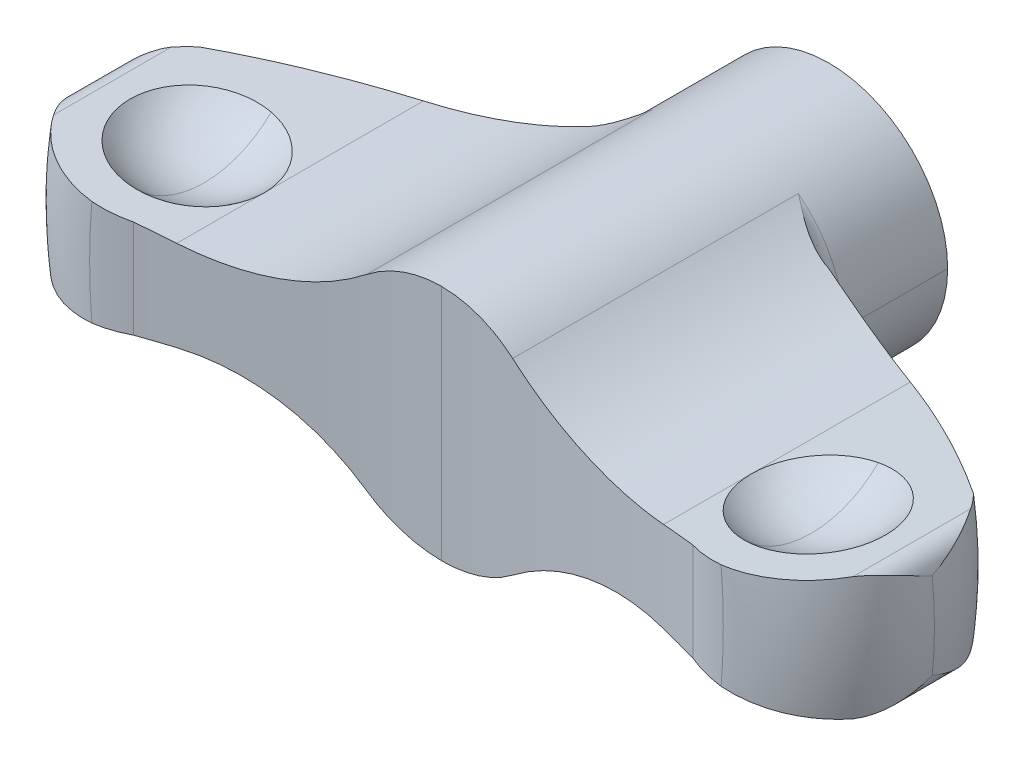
ISO-10303-21;
HEADER;
FILE_DESCRIPTION(('STEP AP214'),'2;1');
FILE_NAME('part.step','',(''),(''),'','','');
FILE_SCHEMA(('AUTOMOTIVE_DESIGN { 1 0 10303 214 1 1 1 1 }'));
ENDSEC;
DATA;
#1=APPLICATION_CONTEXT('core data for automotive mechanical design processes');
#2=APPLICATION_PROTOCOL_DEFINITION('international standard','automotive_design',2000,#1);
#3=PRODUCT_CONTEXT('',#1,'mechanical');
#4=PRODUCT('Part','Part','',(#3));
#5=PRODUCT_RELATED_PRODUCT_CATEGORY('part','',(#4));
#6=PRODUCT_DEFINITION_FORMATION('','',#4);
#7=PRODUCT_DEFINITION_CONTEXT('part definition',#1,'design');
#8=PRODUCT_DEFINITION('design','',#6,#7);
#9=PRODUCT_DEFINITION_SHAPE('','',#8);
#10=(LENGTH_UNIT() NAMED_UNIT(*) SI_UNIT(.MILLI.,.METRE.));
#11=(NAMED_UNIT(*) PLANE_ANGLE_UNIT() SI_UNIT($,.RADIAN.));
#12=(NAMED_UNIT(*) SI_UNIT($,.STERADIAN.) SOLID_ANGLE_UNIT());
#13=UNCERTAINTY_MEASURE_WITH_UNIT(LENGTH_MEASURE(1.E-05),#10,'distance_accuracy_value','');
#14=(GEOMETRIC_REPRESENTATION_CONTEXT(3) GLOBAL_UNCERTAINTY_ASSIGNED_CONTEXT((#13)) GLOBAL_UNIT_ASSIGNED_CONTEXT((#10,
#11,#12)) REPRESENTATION_CONTEXT('',''));
#15=CARTESIAN_POINT('',(0.,0.,0.));
#16=DIRECTION('',(0.,0.,1.));
#17=DIRECTION('',(1.,0.,0.));
#18=AXIS2_PLACEMENT_3D('',#15,#16,#17);
#19=CARTESIAN_POINT('',(0.,0.,18.));
#20=DIRECTION('',(0.,0.,-1.));
#21=DIRECTION('',(0.,-1.,0.));
#22=AXIS2_PLACEMENT_3D('',#19,#20,#21);
#23=TOROIDAL_SURFACE('',#22,18.,6.);
#24=CARTESIAN_POINT('',(21.977730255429,3.4226360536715,13.7573593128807));
#25=CARTESIAN_POINT('',(22.1148980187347,3.43705296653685,13.8951719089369));
#26=CARTESIAN_POINT('',(22.2448209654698,3.4507084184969,14.0389827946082));
#27=CARTESIAN_POINT('',(22.4901772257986,3.47649640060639,14.3386011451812));
#28=CARTESIAN_POINT('',(22.6056105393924,3.48862893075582,14.4944086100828));
#29=CARTESIAN_POINT('',(22.7137990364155,3.49999999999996,14.6562143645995));
#30=B_SPLINE_CURVE_WITH_KNOTS('',3,(#24,#25,#26,#27,#28,#29),.UNSPECIFIED.,.F.,.F.,(4,2,4),(0.,
0.582865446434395,1.16573089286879),.UNSPECIFIED.);
#31=CARTESIAN_POINT('',(21.977730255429,3.4226360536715,13.7573593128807));
#32=VERTEX_POINT('',#31);
#33=CARTESIAN_POINT('',(22.7137990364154,3.5,14.6562143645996));
#34=VERTEX_POINT('',#33);
#35=EDGE_CURVE('E245',#32,#34,#30,.T.);
#36=ORIENTED_EDGE('',*,*,#35,.T.);
#37=CARTESIAN_POINT('',(22.7137990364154,3.49999999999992,14.6562143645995));
#38=CARTESIAN_POINT('',(22.7337448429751,3.49999809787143,14.6855840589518));
#39=CARTESIAN_POINT('',(22.7534820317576,3.49948399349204,14.7150931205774));
#40=CARTESIAN_POINT('',(22.7930491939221,3.49746578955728,14.7751706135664));
#41=CARTESIAN_POINT('',(22.8128671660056,3.49593521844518,14.8057460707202));
#42=CARTESIAN_POINT('',(22.8525506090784,3.49187049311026,14.8679711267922));
#43=CARTESIAN_POINT('',(22.8724028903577,3.48931033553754,14.899627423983));
#44=CARTESIAN_POINT('',(22.9121080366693,3.48317090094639,14.9640274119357));
#45=CARTESIAN_POINT('',(22.93194657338,3.47956607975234,14.9967774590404));
#46=CARTESIAN_POINT('',(22.9921814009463,3.46703764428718,15.098009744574));
#47=CARTESIAN_POINT('',(23.0316323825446,3.45657528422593,15.1668705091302));
#48=CARTESIAN_POINT('',(23.1099900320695,3.4314908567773,15.3090592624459));
#49=CARTESIAN_POINT('',(23.1487563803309,3.41667729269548,15.3824301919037));
#50=CARTESIAN_POINT('',(23.2181157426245,3.38596509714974,15.5195051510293));
#51=CARTESIAN_POINT('',(23.249091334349,3.37051233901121,15.5831169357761));
#52=CARTESIAN_POINT('',(23.3104529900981,3.33652607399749,15.7142089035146));
#53=CARTESIAN_POINT('',(23.3407188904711,3.31787198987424,15.7817140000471));
#54=CARTESIAN_POINT('',(23.4002954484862,3.27739846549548,15.9206320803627));
#55=CARTESIAN_POINT('',(23.4294767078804,3.25546550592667,15.9920673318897));
#56=CARTESIAN_POINT('',(23.4864947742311,3.20836495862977,16.1388719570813));
#57=CARTESIAN_POINT('',(23.5141933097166,3.183090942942,16.214260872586));
#58=CARTESIAN_POINT('',(23.5623040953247,3.13476960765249,16.3530161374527));
#59=CARTESIAN_POINT('',(23.5831675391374,3.11203272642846,16.416335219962));
#60=CARTESIAN_POINT('',(23.6243043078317,3.06353993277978,16.5480431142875));
#61=CARTESIAN_POINT('',(23.6444097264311,3.03768620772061,16.616448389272));
#62=CARTESIAN_POINT('',(23.6835194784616,2.98287692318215,16.7583576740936));
#63=CARTESIAN_POINT('',(23.7023425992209,2.95383170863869,16.8318768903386));
#64=CARTESIAN_POINT('',(23.73833490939,2.89259496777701,16.9840331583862));
#65=CARTESIAN_POINT('',(23.7553095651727,2.86032288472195,17.0626839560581));
#66=CARTESIAN_POINT('',(23.7810371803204,2.80525234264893,17.1943835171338));
#67=CARTESIAN_POINT('',(23.7906651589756,2.7828003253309,17.2474085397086));
#68=CARTESIAN_POINT('',(23.810519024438,2.73222392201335,17.3657769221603));
#69=CARTESIAN_POINT('',(23.8203691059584,2.70398748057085,17.431135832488));
#70=CARTESIAN_POINT('',(23.8394872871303,2.64170079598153,17.5742249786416));
#71=CARTESIAN_POINT('',(23.848299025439,2.60755421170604,17.6519743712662));
#72=CARTESIAN_POINT('',(23.8639224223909,2.53327674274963,17.819818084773));
#73=CARTESIAN_POINT('',(23.8701979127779,2.49305295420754,17.9099215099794));
#74=CARTESIAN_POINT('',(23.8743581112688,2.45255474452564,18.));
#75=B_SPLINE_CURVE_WITH_KNOTS('',3,(#37,#38,#39,#40,#41,#42,#43,#44,#45,#46,#47,#48,#49,#50,#51,
#52,#53,#54,#55,#56,#57,#58,#59,#60,#61,#62,#63,#64,#65,#66,#67,#68,#69,#70,#71,#72,#73,#74),
.UNSPECIFIED.,.F.,.F.,(4,2,2,2,2,2,2,2,2,2,2,2,2,2,2,2,2,2,4),(0.,0.106499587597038,
0.215887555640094,0.328231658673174,0.443595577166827,0.68359398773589,0.936345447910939,
1.1535372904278,1.3823468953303,1.62293629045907,1.87544734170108,2.08672005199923,
2.3141921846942,2.55791147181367,2.81791458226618,2.99304229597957,3.20863194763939,
3.46469242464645,3.76122005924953),.UNSPECIFIED.);
#76=CARTESIAN_POINT('',(23.8743581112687,2.45255474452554,18.));
#77=VERTEX_POINT('',#76);
#78=EDGE_CURVE('E257',#77,#34,#75,.F.);
#79=ORIENTED_EDGE('',*,*,#78,.F.);
#80=CARTESIAN_POINT('',(0.,0.,18.));
#81=DIRECTION('',(0.,0.,-1.));
#82=DIRECTION('',(0.,-1.,0.));
#83=AXIS2_PLACEMENT_3D('',#80,#81,#82);
#84=CIRCLE('',#83,24.);
#85=CARTESIAN_POINT('',(23.8743581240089,-2.45255462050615,18.));
#86=VERTEX_POINT('',#85);
#87=EDGE_CURVE('E685',#86,#77,#84,.F.);
#88=ORIENTED_EDGE('',*,*,#87,.F.);
#89=CARTESIAN_POINT('',(23.874358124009,-2.45255462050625,18.));
#90=CARTESIAN_POINT('',(23.8701995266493,-2.49303723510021,17.9099576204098));
#91=CARTESIAN_POINT('',(23.8639273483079,-2.53324548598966,17.8198902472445));
#92=CARTESIAN_POINT('',(23.8483115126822,-2.60750265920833,17.6520944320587));
#93=CARTESIAN_POINT('',(23.8395028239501,-2.64164431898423,17.5743569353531));
#94=CARTESIAN_POINT('',(23.8203882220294,-2.70393144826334,17.4312674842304));
#95=CARTESIAN_POINT('',(23.8105377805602,-2.73217311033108,17.3658964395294));
#96=CARTESIAN_POINT('',(23.7906781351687,-2.78277017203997,17.2474800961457));
#97=CARTESIAN_POINT('',(23.7810441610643,-2.80523740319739,17.1944192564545));
#98=CARTESIAN_POINT('',(23.755311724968,-2.860318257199,17.0626950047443));
#99=CARTESIAN_POINT('',(23.7383396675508,-2.89258614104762,16.9840553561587));
#100=CARTESIAN_POINT('',(23.7023517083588,-2.95381735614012,16.8319137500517));
#101=CARTESIAN_POINT('',(23.6835300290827,-2.9828611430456,16.7583980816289));
#102=CARTESIAN_POINT('',(23.6444213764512,-3.03767054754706,16.616488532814));
#103=CARTESIAN_POINT('',(23.6243153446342,-3.0635256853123,16.5480794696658));
#104=CARTESIAN_POINT('',(23.5831747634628,-3.11202436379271,16.4163569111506));
#105=CARTESIAN_POINT('',(23.5623078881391,-3.13476554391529,16.3530269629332));
#106=CARTESIAN_POINT('',(23.5141971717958,-3.18308736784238,16.2142721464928));
#107=CARTESIAN_POINT('',(23.4865029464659,-3.20835813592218,16.1388944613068));
#108=CARTESIAN_POINT('',(23.4294915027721,-3.25545451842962,15.9921044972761));
#109=CARTESIAN_POINT('',(23.4003122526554,-3.27738636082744,15.9206727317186));
#110=CARTESIAN_POINT('',(23.3407368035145,-3.31786002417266,15.7817542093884));
#111=CARTESIAN_POINT('',(23.3104697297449,-3.33651512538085,15.7142452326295));
#112=CARTESIAN_POINT('',(23.2491019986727,-3.37050600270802,15.5831385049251));
#113=CARTESIAN_POINT('',(23.218121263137,-3.38596206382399,15.5195158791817));
#114=CARTESIAN_POINT('',(23.1487585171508,-3.41667703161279,15.3824346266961));
#115=CARTESIAN_POINT('',(23.1099944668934,-3.4314907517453,15.3090681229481));
#116=CARTESIAN_POINT('',(23.0316402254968,-3.45657531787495,15.1668850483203));
#117=CARTESIAN_POINT('',(22.9921902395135,-3.46703756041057,15.0980255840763));
#118=CARTESIAN_POINT('',(22.9319563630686,-3.47956590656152,14.9967941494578));
#119=CARTESIAN_POINT('',(22.9121177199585,-3.48317074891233,14.9640436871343));
#120=CARTESIAN_POINT('',(22.8724119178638,-3.48931023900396,14.8996421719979));
#121=CARTESIAN_POINT('',(22.8525590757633,-3.49187041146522,14.867984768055));
#122=CARTESIAN_POINT('',(22.8128740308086,-3.49593518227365,14.8057568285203));
#123=CARTESIAN_POINT('',(22.793055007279,-3.49746576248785,14.7751795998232));
#124=CARTESIAN_POINT('',(22.7534852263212,-3.49948399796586,14.7150979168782));
#125=CARTESIAN_POINT('',(22.7337464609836,-3.49999810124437,14.6855864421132));
#126=CARTESIAN_POINT('',(22.7137990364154,-3.49999999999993,14.6562143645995));
#127=B_SPLINE_CURVE_WITH_KNOTS('',3,(#89,#90,#91,#92,#93,#94,#95,#96,#97,#98,#99,#100,#101,#102,
#103,#104,#105,#106,#107,#108,#109,#110,#111,#112,#113,#114,#115,#116,#117,#118,#119,#120,#121,
#122,#123,#124,#125,#126),.UNSPECIFIED.,.F.,.F.,(4,2,2,2,2,2,2,2,2,2,2,2,2,2,2,2,2,2,4),(0.,
0.296409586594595,0.552430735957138,0.768059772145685,0.943305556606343,1.20327214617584,
1.44697927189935,1.67446358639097,1.88577279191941,2.13824653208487,2.37882350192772,
2.6076455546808,2.82487466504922,3.07761148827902,3.31760499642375,3.43297014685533,
3.54531794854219,3.65471208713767,3.76122031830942),.UNSPECIFIED.);
#128=CARTESIAN_POINT('',(22.7137990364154,-3.5,14.6562143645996));
#129=VERTEX_POINT('',#128);
#130=EDGE_CURVE('E1509',#129,#86,#127,.F.);
#131=ORIENTED_EDGE('',*,*,#130,.F.);
#132=CARTESIAN_POINT('',(22.7137990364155,-3.5,14.6562143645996));
#133=CARTESIAN_POINT('',(22.6056105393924,-3.48862893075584,14.4944086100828));
#134=CARTESIAN_POINT('',(22.4901772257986,-3.47649640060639,14.3386011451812));
#135=CARTESIAN_POINT('',(22.2448209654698,-3.45070841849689,14.0389827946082));
#136=CARTESIAN_POINT('',(22.1148980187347,-3.43705296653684,13.8951719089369));
#137=CARTESIAN_POINT('',(21.977730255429,-3.4226360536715,13.7573593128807));
#138=B_SPLINE_CURVE_WITH_KNOTS('',3,(#132,#133,#134,#135,#136,#137),.UNSPECIFIED.,.F.,.F.,(4,2,
4),(0.,0.582865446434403,1.16573089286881),.UNSPECIFIED.);
#139=CARTESIAN_POINT('',(21.977730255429,-3.42263605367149,13.7573593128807));
#140=VERTEX_POINT('',#139);
#141=EDGE_CURVE('E258',#129,#140,#138,.T.);
#142=ORIENTED_EDGE('',*,*,#141,.T.);
#143=CARTESIAN_POINT('',(0.,0.,13.7573593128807));
#144=DIRECTION('',(0.,0.,-1.));
#145=DIRECTION('',(0.,-1.,0.));
#146=AXIS2_PLACEMENT_3D('',#143,#144,#145);
#147=CIRCLE('',#146,22.2426406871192);
#148=EDGE_CURVE('E262',#32,#140,#147,.T.);
#149=ORIENTED_EDGE('',*,*,#148,.F.);
#150=EDGE_LOOP('',(#36,#79,#88,#131,#142,#149));
#151=FACE_BOUND('',#150,.T.);
#152=ADVANCED_FACE('F15',(#151),#23,.T.);
#153=CARTESIAN_POINT('',(22.7137990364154,2.33333333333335,0.));
#154=DIRECTION('',(0.,0.,-1.));
#155=DIRECTION('',(0.,-1.,0.));
#156=AXIS2_PLACEMENT_3D('',#153,#154,#155);
#157=CYLINDRICAL_SURFACE('',#156,1.16666666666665);
#158=ORIENTED_EDGE('',*,*,#78,.T.);
#159=DIRECTION('',(0.,0.,1.));
#160=VECTOR('',#159,1.);
#161=CARTESIAN_POINT('',(22.7137990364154,3.5,0.));
#162=LINE('',#161,#160);
#163=CARTESIAN_POINT('',(22.7137990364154,3.5,21.3437856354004));
#164=VERTEX_POINT('',#163);
#165=EDGE_CURVE('E253',#34,#164,#162,.T.);
#166=ORIENTED_EDGE('',*,*,#165,.T.);
#167=CARTESIAN_POINT('',(23.8743581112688,2.45255474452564,18.));
#168=CARTESIAN_POINT('',(23.8701982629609,2.4930495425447,18.0900709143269));
#169=CARTESIAN_POINT('',(23.8639234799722,2.53326995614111,18.1801667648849));
#170=CARTESIAN_POINT('',(23.8483016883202,2.6075430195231,18.3480004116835));
#171=CARTESIAN_POINT('',(23.8394905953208,2.64168853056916,18.425747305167));
#172=CARTESIAN_POINT('',(23.8203731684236,2.70397529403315,18.5688365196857));
#173=CARTESIAN_POINT('',(23.8105230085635,2.73221284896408,18.6341979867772));
#174=CARTESIAN_POINT('',(23.7906679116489,2.78279375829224,18.7525764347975));
#175=CARTESIAN_POINT('',(23.7810386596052,2.80524909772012,18.8056089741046));
#176=CARTESIAN_POINT('',(23.7553117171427,2.86031839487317,18.9373049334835));
#177=CARTESIAN_POINT('',(23.7383396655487,2.89258617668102,19.0159446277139));
#178=CARTESIAN_POINT('',(23.7023517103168,2.95381732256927,19.1680862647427));
#179=CARTESIAN_POINT('',(23.6835300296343,2.98286113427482,19.2416019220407));
#180=CARTESIAN_POINT('',(23.6444213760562,3.03767055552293,19.3835114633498));
#181=CARTESIAN_POINT('',(23.6243153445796,3.06352568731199,19.4519205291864));
#182=CARTESIAN_POINT('',(23.5831747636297,3.11202436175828,19.5836430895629));
#183=CARTESIAN_POINT('',(23.5623078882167,3.13476554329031,19.6469730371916));
#184=CARTESIAN_POINT('',(23.5141971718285,3.18308736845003,19.7857278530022));
#185=CARTESIAN_POINT('',(23.4865029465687,3.20835813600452,19.8611055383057));
#186=CARTESIAN_POINT('',(23.4294915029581,3.25545451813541,20.0078955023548));
#187=CARTESIAN_POINT('',(23.4003122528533,3.27738636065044,20.0793272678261));
#188=CARTESIAN_POINT('',(23.3407368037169,3.3178600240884,20.2182457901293));
#189=CARTESIAN_POINT('',(23.3104697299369,3.33651512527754,20.2857547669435));
#190=CARTESIAN_POINT('',(23.2491019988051,3.37050600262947,20.416861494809));
#191=CARTESIAN_POINT('',(23.2181212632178,3.38596206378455,20.4804841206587));
#192=CARTESIAN_POINT('',(23.1487585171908,3.41667703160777,20.6175653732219));
#193=CARTESIAN_POINT('',(23.1099944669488,3.43149075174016,20.6909318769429));
#194=CARTESIAN_POINT('',(23.0316402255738,3.45657531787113,20.8331149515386));
#195=CARTESIAN_POINT('',(22.9921902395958,3.46703756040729,20.9019744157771));
#196=CARTESIAN_POINT('',(22.9319563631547,3.47956590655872,21.0032058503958));
#197=CARTESIAN_POINT('',(22.9121177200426,3.4831707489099,21.0359563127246));
#198=CARTESIAN_POINT('',(22.8724119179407,3.48931023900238,21.1003578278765));
#199=CARTESIAN_POINT('',(22.852559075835,3.49187041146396,21.1320152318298));
#200=CARTESIAN_POINT('',(22.8128740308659,3.49593518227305,21.19424317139));
#201=CARTESIAN_POINT('',(22.7930550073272,3.49746576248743,21.2248204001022));
#202=CARTESIAN_POINT('',(22.7534852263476,3.49948399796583,21.2849020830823));
#203=CARTESIAN_POINT('',(22.733746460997,3.49999810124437,21.3144135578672));
#204=CARTESIAN_POINT('',(22.7137990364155,3.49999999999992,21.3437856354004));
#205=B_SPLINE_CURVE_WITH_KNOTS('',3,(#167,#168,#169,#170,#171,#172,#173,#174,#175,#176,#177,
#178,#179,#180,#181,#182,#183,#184,#185,#186,#187,#188,#189,#190,#191,#192,#193,#194,#195,#196,
#197,#198,#199,#200,#201,#202,#203,#204),.UNSPECIFIED.,.F.,.F.,(4,2,2,2,2,2,2,2,2,2,2,2,2,2,2,2,
2,2,4),(0.,0.296502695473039,0.552554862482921,0.768152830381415,0.943305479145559,
1.20327206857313,1.44697919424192,1.67446350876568,1.88577271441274,2.13824645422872,
2.37882342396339,2.60764547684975,2.82487458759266,3.07761141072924,3.31760491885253,
3.43297006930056,3.54531787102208,3.65471200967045,3.76122024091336),.UNSPECIFIED.);
#206=EDGE_CURVE('E646',#77,#164,#205,.T.);
#207=ORIENTED_EDGE('',*,*,#206,.F.);
#208=EDGE_LOOP('',(#158,#166,#207));
#209=FACE_BOUND('',#208,.T.);
#210=ADVANCED_FACE('F712',(#209),#157,.T.);
#211=CARTESIAN_POINT('',(17.25,6.75,18.25));
#212=DIRECTION('',(0.,0.,1.));
#213=DIRECTION('',(-1.,0.,0.));
#214=AXIS2_PLACEMENT_3D('',#211,#212,#213);
#215=SPHERICAL_SURFACE('',#214,5.4);
#216=CARTESIAN_POINT('',(17.25,6.75,18.25));
#217=DIRECTION('',(1.,0.,0.));
#218=DIRECTION('',(0.,0.,1.));
#219=AXIS2_PLACEMENT_3D('',#216,#217,#218);
#220=CIRCLE('',#219,5.4);
#221=CARTESIAN_POINT('',(17.25,1.35,18.25));
#222=VERTEX_POINT('',#221);
#223=CARTESIAN_POINT('',(17.25,2.92573158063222,22.062475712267));
#224=VERTEX_POINT('',#223);
#225=EDGE_CURVE('E699',#222,#224,#220,.F.);
#226=ORIENTED_EDGE('',*,*,#225,.T.);
#227=CARTESIAN_POINT('',(17.25,2.92573158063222,22.062475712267));
#228=CARTESIAN_POINT('',(17.3566407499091,2.93693997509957,22.0737291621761));
#229=CARTESIAN_POINT('',(17.4637505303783,2.94819766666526,22.0804377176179));
#230=CARTESIAN_POINT('',(17.6781466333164,2.97073160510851,22.0847651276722));
#231=CARTESIAN_POINT('',(17.7854329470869,2.98200785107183,22.0823844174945));
#232=CARTESIAN_POINT('',(17.9993557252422,3.00449204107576,22.0685393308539));
#233=CARTESIAN_POINT('',(18.1059925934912,3.0157000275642,22.0570813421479));
#234=CARTESIAN_POINT('',(18.317899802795,3.03797237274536,22.0251903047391));
#235=CARTESIAN_POINT('',(18.4231701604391,3.04903673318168,22.0047573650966));
#236=CARTESIAN_POINT('',(18.7359174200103,3.08190779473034,21.9301450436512));
#237=CARTESIAN_POINT('',(18.9404210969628,3.10340199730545,21.8626462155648));
#238=CARTESIAN_POINT('',(19.3351018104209,3.14488461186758,21.6941292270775));
#239=CARTESIAN_POINT('',(19.5252816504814,3.1648733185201,21.5931176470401));
#240=CARTESIAN_POINT('',(19.8861130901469,3.20279823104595,21.3604156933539));
#241=CARTESIAN_POINT('',(20.0567642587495,3.22073439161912,21.2287246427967));
#242=CARTESIAN_POINT('',(20.3736745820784,3.2540430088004,20.9383859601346));
#243=CARTESIAN_POINT('',(20.5199300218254,3.26941507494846,20.7797342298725));
#244=CARTESIAN_POINT('',(20.7838696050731,3.29715624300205,20.4399985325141));
#245=CARTESIAN_POINT('',(20.9015550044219,3.30952547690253,20.2589155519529));
#246=CARTESIAN_POINT('',(21.1050125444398,3.33090972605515,19.8794651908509));
#247=CARTESIAN_POINT('',(21.1907867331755,3.33992495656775,19.6810989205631));
#248=CARTESIAN_POINT('',(21.3279998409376,3.35434663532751,19.2726986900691));
#249=CARTESIAN_POINT('',(21.3794381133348,3.35975301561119,19.0626645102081));
#250=CARTESIAN_POINT('',(21.4465173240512,3.36680332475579,18.6368883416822));
#251=CARTESIAN_POINT('',(21.462157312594,3.36844715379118,18.421146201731));
#252=CARTESIAN_POINT('',(21.4571932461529,3.36792540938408,17.9900840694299));
#253=CARTESIAN_POINT('',(21.4365892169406,3.36575983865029,17.7747640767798));
#254=CARTESIAN_POINT('',(21.3597229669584,3.35768087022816,17.3506638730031));
#255=CARTESIAN_POINT('',(21.3034616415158,3.35176756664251,17.1418834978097));
#256=CARTESIAN_POINT('',(21.156880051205,3.33636122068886,16.7367865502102));
#257=CARTESIAN_POINT('',(21.0665603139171,3.3268682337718,16.5404697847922));
#258=CARTESIAN_POINT('',(20.8544187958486,3.30457126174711,16.1658584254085));
#259=CARTESIAN_POINT('',(20.7325952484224,3.29176709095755,15.9875648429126));
#260=CARTESIAN_POINT('',(20.4609056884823,3.26321136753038,15.6540690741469));
#261=CARTESIAN_POINT('',(20.3110388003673,3.24745972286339,15.4988676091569));
#262=CARTESIAN_POINT('',(19.9875278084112,3.21345734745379,15.2159844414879));
#263=CARTESIAN_POINT('',(19.8138865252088,3.19520691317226,15.0882994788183));
#264=CARTESIAN_POINT('',(19.447779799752,3.1567275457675,14.8640526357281));
#265=CARTESIAN_POINT('',(19.2553139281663,3.13649856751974,14.767491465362));
#266=CARTESIAN_POINT('',(18.8568521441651,3.0946185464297,14.6082122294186));
#267=CARTESIAN_POINT('',(18.6508552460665,3.07296739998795,14.5454966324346));
#268=CARTESIAN_POINT('',(18.3436575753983,3.04067962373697,14.4797242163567));
#269=CARTESIAN_POINT('',(18.2452279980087,3.03033425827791,14.4626927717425));
#270=CARTESIAN_POINT('',(18.0473221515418,3.00953351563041,14.4364394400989));
#271=CARTESIAN_POINT('',(17.9478459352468,2.99907814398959,14.4272171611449));
#272=CARTESIAN_POINT('',(17.7484767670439,2.97812360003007,14.4166533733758));
#273=CARTESIAN_POINT('',(17.6485837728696,2.96762442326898,14.4153126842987));
#274=CARTESIAN_POINT('',(17.4489917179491,2.94664645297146,14.4205097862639));
#275=CARTESIAN_POINT('',(17.3492926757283,2.93616766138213,14.4270482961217));
#276=CARTESIAN_POINT('',(17.25,2.92573158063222,14.4375242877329));
#277=B_SPLINE_CURVE_WITH_KNOTS('',3,(#227,#228,#229,#230,#231,#232,#233,#234,#235,#236,#237,
#238,#239,#240,#241,#242,#243,#244,#245,#246,#247,#248,#249,#250,#251,#252,#253,#254,#255,#256,
#257,#258,#259,#260,#261,#262,#263,#264,#265,#266,#267,#268,#269,#270,#271,#272,#273,#274,#275,
#276),.UNSPECIFIED.,.F.,.F.,(4,2,2,2,2,2,2,2,2,2,2,2,2,2,2,2,2,2,2,2,2,2,2,2,4),(0.,
0.323345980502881,0.646676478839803,0.96977964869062,1.29287889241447,1.93880698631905,
2.58460832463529,3.23042391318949,3.87633775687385,4.52222320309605,5.16806718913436,
5.81392333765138,6.4597966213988,7.10566944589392,7.75152605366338,8.39737265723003,
9.04325548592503,9.68915848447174,10.3349849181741,10.9808260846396,11.6267143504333,
11.9277483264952,12.2287671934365,12.5298173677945,12.8308950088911),.UNSPECIFIED.);
#278=CARTESIAN_POINT('',(17.25,2.92573158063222,14.4375242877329));
#279=VERTEX_POINT('',#278);
#280=EDGE_CURVE('E716',#224,#279,#277,.T.);
#281=ORIENTED_EDGE('',*,*,#280,.T.);
#282=CARTESIAN_POINT('',(17.25,6.75,18.25));
#283=DIRECTION('',(1.,0.,0.));
#284=DIRECTION('',(0.,0.,1.));
#285=AXIS2_PLACEMENT_3D('',#282,#283,#284);
#286=CIRCLE('',#285,5.4);
#287=EDGE_CURVE('E693',#279,#222,#286,.F.);
#288=ORIENTED_EDGE('',*,*,#287,.T.);
#289=EDGE_LOOP('',(#226,#281,#288));
#290=FACE_BOUND('',#289,.T.);
#291=ADVANCED_FACE('F709',(#290),#215,.F.);
#292=CARTESIAN_POINT('',(17.25,6.75,18.25));
#293=DIRECTION('',(0.,0.,1.));
#294=DIRECTION('',(-1.,0.,0.));
#295=AXIS2_PLACEMENT_3D('',#292,#293,#294);
#296=SPHERICAL_SURFACE('',#295,5.4);
#297=CARTESIAN_POINT('',(17.25,2.92573158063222,14.4375242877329));
#298=CARTESIAN_POINT('',(17.1433574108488,2.91452299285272,14.4487571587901));
#299=CARTESIAN_POINT('',(17.0371935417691,2.90336472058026,14.464533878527));
#300=CARTESIAN_POINT('',(16.8265681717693,2.88122710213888,14.5050161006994));
#301=CARTESIAN_POINT('',(16.7221065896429,2.87024774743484,14.529721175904));
#302=CARTESIAN_POINT('',(16.5156923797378,2.8485527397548,14.5878820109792));
#303=CARTESIAN_POINT('',(16.4137380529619,2.83783690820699,14.6213316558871));
#304=CARTESIAN_POINT('',(16.2130176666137,2.81674034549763,14.6967258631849));
#305=CARTESIAN_POINT('',(16.114251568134,2.80635961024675,14.7386703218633));
#306=CARTESIAN_POINT('',(15.8236921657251,2.77582058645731,14.8768908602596));
#307=CARTESIAN_POINT('',(15.63755544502,2.75625682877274,14.9855773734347));
#308=CARTESIAN_POINT('',(15.2862224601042,2.71933024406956,15.2327482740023));
#309=CARTESIAN_POINT('',(15.1210209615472,2.70196686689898,15.3712251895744));
#310=CARTESIAN_POINT('',(14.8160669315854,2.66991490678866,15.6740954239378));
#311=CARTESIAN_POINT('',(14.676311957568,2.65522606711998,15.8384862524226));
#312=CARTESIAN_POINT('',(14.4261783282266,2.62893596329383,16.1886069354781));
#313=CARTESIAN_POINT('',(14.315812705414,2.6173360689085,16.3743462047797));
#314=CARTESIAN_POINT('',(14.127617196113,2.59755592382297,16.7618844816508));
#315=CARTESIAN_POINT('',(14.0498041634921,2.58937744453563,16.9636917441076));
#316=CARTESIAN_POINT('',(13.9290924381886,2.57669013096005,17.3774240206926));
#317=CARTESIAN_POINT('',(13.8861423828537,2.57217589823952,17.589333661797));
#318=CARTESIAN_POINT('',(13.8525068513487,2.56864066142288,17.8773186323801));
#319=CARTESIAN_POINT('',(13.8460058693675,2.56795738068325,17.9517714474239));
#320=CARTESIAN_POINT('',(13.8373477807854,2.56704737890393,18.1008056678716));
#321=CARTESIAN_POINT('',(13.8351833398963,2.56681988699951,18.1753866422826));
#322=CARTESIAN_POINT('',(13.8351792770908,2.56681945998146,18.25));
#323=B_SPLINE_CURVE_WITH_KNOTS('',3,(#297,#298,#299,#300,#301,#302,#303,#304,#305,#306,#307,
#308,#309,#310,#311,#312,#313,#314,#315,#316,#317,#318,#319,#320,#321,#322),.UNSPECIFIED.,.F.,
.F.,(4,2,2,2,2,2,2,2,2,2,2,2,4),(0.,0.323345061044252,0.646674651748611,0.969778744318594,
1.29287889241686,1.93882452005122,2.58460832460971,3.23033010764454,3.87633775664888,
4.52267945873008,5.16806718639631,5.39219018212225,5.61593380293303),.UNSPECIFIED.);
#324=CARTESIAN_POINT('',(13.8351792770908,2.56681945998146,18.25));
#325=VERTEX_POINT('',#324);
#326=EDGE_CURVE('E724',#279,#325,#323,.T.);
#327=ORIENTED_EDGE('',*,*,#326,.T.);
#328=CARTESIAN_POINT('',(13.8351792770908,2.56681945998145,18.25));
#329=CARTESIAN_POINT('',(13.8351690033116,2.56681838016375,18.3578167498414));
#330=CARTESIAN_POINT('',(13.8397029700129,2.56729491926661,18.4656286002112));
#331=CARTESIAN_POINT('',(13.8577798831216,2.56919487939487,18.6804809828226));
#332=CARTESIAN_POINT('',(13.8713223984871,2.57061825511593,18.7875215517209));
#333=CARTESIAN_POINT('',(13.9073243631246,2.57440221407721,19.0000061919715));
#334=CARTESIAN_POINT('',(13.9297775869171,2.57676214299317,19.1054513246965));
#335=CARTESIAN_POINT('',(13.9834188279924,2.5824000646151,19.3140390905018));
#336=CARTESIAN_POINT('',(14.014606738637,2.58567804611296,19.4171817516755));
#337=CARTESIAN_POINT('',(14.1210210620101,2.59686264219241,19.7221624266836));
#338=CARTESIAN_POINT('',(14.2091125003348,2.60612142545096,19.9196378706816));
#339=CARTESIAN_POINT('',(14.4169521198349,2.62796624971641,20.2967550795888));
#340=CARTESIAN_POINT('',(14.5366923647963,2.64055145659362,20.4764012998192));
#341=CARTESIAN_POINT('',(14.8044605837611,2.66869503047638,20.8129466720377));
#342=CARTESIAN_POINT('',(14.9524858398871,2.68425311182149,20.969848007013));
#343=CARTESIAN_POINT('',(15.2727061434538,2.7179096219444,21.2564988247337));
#344=CARTESIAN_POINT('',(15.4449118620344,2.7360091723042,21.3862362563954));
#345=CARTESIAN_POINT('',(15.8086008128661,2.77423442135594,21.6148492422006));
#346=CARTESIAN_POINT('',(16.0000939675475,2.79436116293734,21.7137088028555));
#347=CARTESIAN_POINT('',(16.3967286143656,2.83604914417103,21.8775677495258));
#348=CARTESIAN_POINT('',(16.6018495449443,2.85760822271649,21.9426168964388));
#349=CARTESIAN_POINT('',(16.8831878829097,2.88717807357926,22.0062844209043));
#350=CARTESIAN_POINT('',(16.9561512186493,2.8948468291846,22.0205495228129));
#351=CARTESIAN_POINT('',(17.1026580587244,2.91024531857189,22.0447491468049));
#352=CARTESIAN_POINT('',(17.1762003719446,2.91797492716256,22.0546909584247));
#353=CARTESIAN_POINT('',(17.25,2.92573158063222,22.062475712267));
#354=B_SPLINE_CURVE_WITH_KNOTS('',3,(#328,#329,#330,#331,#332,#333,#334,#335,#336,#337,#338,
#339,#340,#341,#342,#343,#344,#345,#346,#347,#348,#349,#350,#351,#352,#353),.UNSPECIFIED.,.F.,
.F.,(4,2,2,2,2,2,2,2,2,2,2,2,4),(0.,0.323345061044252,0.646674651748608,0.969778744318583,
1.29287889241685,1.9388245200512,2.58460832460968,3.23033010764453,3.87633775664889,
4.5226794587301,5.16806718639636,5.39219018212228,5.61593380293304),.UNSPECIFIED.);
#355=EDGE_CURVE('E725',#325,#224,#354,.T.);
#356=ORIENTED_EDGE('',*,*,#355,.T.);
#357=ORIENTED_EDGE('',*,*,#225,.F.);
#358=ORIENTED_EDGE('',*,*,#287,.F.);
#359=EDGE_LOOP('',(#327,#356,#357,#358));
#360=FACE_BOUND('',#359,.T.);
#361=ADVANCED_FACE('F627',(#360),#296,.F.);
#362=CARTESIAN_POINT('',(0.,0.,18.));
#363=DIRECTION('',(0.,0.,-1.));
#364=DIRECTION('',(0.,-1.,0.));
#365=AXIS2_PLACEMENT_3D('',#362,#363,#364);
#366=TOROIDAL_SURFACE('',#365,18.,6.);
#367=CARTESIAN_POINT('',(17.8757076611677,-2.99149610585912,23.9987124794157));
#368=CARTESIAN_POINT('',(18.0439542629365,-3.00917953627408,23.9952318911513));
#369=CARTESIAN_POINT('',(18.2120514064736,-3.02684725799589,23.9845859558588));
#370=CARTESIAN_POINT('',(18.5467541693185,-3.06202593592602,23.9491139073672));
#371=CARTESIAN_POINT('',(18.7133598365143,-3.07953689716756,23.9242882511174));
#372=CARTESIAN_POINT('',(19.0437271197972,-3.11425989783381,23.8606399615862));
#373=CARTESIAN_POINT('',(19.2074914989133,-3.13147222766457,23.8218318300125));
#374=CARTESIAN_POINT('',(19.5311857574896,-3.16549386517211,23.730491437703));
#375=CARTESIAN_POINT('',(19.6911157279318,-3.18230318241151,23.6779595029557));
#376=CARTESIAN_POINT('',(20.0061065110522,-3.21541004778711,23.5595000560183));
#377=CARTESIAN_POINT('',(20.1611641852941,-3.23170726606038,23.4935641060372));
#378=CARTESIAN_POINT('',(20.4652571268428,-3.26366872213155,23.3487536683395));
#379=CARTESIAN_POINT('',(20.6142900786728,-3.27933271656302,23.2698742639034));
#380=CARTESIAN_POINT('',(20.9050901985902,-3.3098970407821,23.0998205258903));
#381=CARTESIAN_POINT('',(21.0468629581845,-3.32479795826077,23.0086558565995));
#382=CARTESIAN_POINT('',(21.3223050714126,-3.35374809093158,22.8145922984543));
#383=CARTESIAN_POINT('',(21.4559718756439,-3.36779703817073,22.7116897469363));
#384=CARTESIAN_POINT('',(21.693287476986,-3.3927399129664,22.5124611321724));
#385=CARTESIAN_POINT('',(21.7982943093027,-3.4037765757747,22.4177640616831));
#386=CARTESIAN_POINT('',(22.0013794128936,-3.42512168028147,22.2211347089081));
#387=CARTESIAN_POINT('',(22.0994579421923,-3.4354301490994,22.1192026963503));
#388=CARTESIAN_POINT('',(22.2882075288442,-3.45526853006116,21.9085914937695));
#389=CARTESIAN_POINT('',(22.3788771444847,-3.46479829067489,21.7999109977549));
#390=CARTESIAN_POINT('',(22.5523526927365,-3.48303130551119,21.5763545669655));
#391=CARTESIAN_POINT('',(22.6351574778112,-3.4917344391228,21.4614777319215));
#392=CARTESIAN_POINT('',(22.7137990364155,-3.5,21.3437856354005));
#393=B_SPLINE_CURVE_WITH_KNOTS('',3,(#367,#368,#369,#370,#371,#372,#373,#374,#375,#376,#377,
#378,#379,#380,#381,#382,#383,#384,#385,#386,#387,#388,#389,#390,#391,#392),.UNSPECIFIED.,.F.,
.F.,(4,2,2,2,2,2,2,2,2,2,2,2,4),(0.,0.507473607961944,1.01493086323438,1.5218633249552,
2.02878374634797,2.53602426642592,3.04345791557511,3.55049469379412,4.05769012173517,
4.4828373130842,4.90796866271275,5.33318254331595,5.75845837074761),.UNSPECIFIED.);
#394=CARTESIAN_POINT('',(17.8757076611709,-2.99149610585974,23.9987124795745));
#395=VERTEX_POINT('',#394);
#396=CARTESIAN_POINT('',(22.7137990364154,-3.5,21.3437856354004));
#397=VERTEX_POINT('',#396);
#398=EDGE_CURVE('E617',#395,#397,#393,.T.);
#399=ORIENTED_EDGE('',*,*,#398,.T.);
#400=CARTESIAN_POINT('',(22.7137990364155,-3.49999999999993,21.3437856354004));
#401=CARTESIAN_POINT('',(22.7337448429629,-3.49999809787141,21.3144159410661));
#402=CARTESIAN_POINT('',(22.7534820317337,-3.49948399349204,21.2849068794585));
#403=CARTESIAN_POINT('',(22.7930491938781,-3.49746578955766,21.2248293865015));
#404=CARTESIAN_POINT('',(22.8128671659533,-3.49593521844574,21.1942539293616));
#405=CARTESIAN_POINT('',(22.852550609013,-3.49187049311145,21.1320288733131));
#406=CARTESIAN_POINT('',(22.8724028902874,-3.48931033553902,21.1003725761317));
#407=CARTESIAN_POINT('',(22.9121080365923,-3.48317090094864,21.0359725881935));
#408=CARTESIAN_POINT('',(22.9319465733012,-3.47956607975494,21.0032225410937));
#409=CARTESIAN_POINT('',(22.9921814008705,-3.46703764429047,20.9019902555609));
#410=CARTESIAN_POINT('',(23.0316323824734,-3.45657528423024,20.8331294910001));
#411=CARTESIAN_POINT('',(23.1099900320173,-3.43149085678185,20.6909407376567));
#412=CARTESIAN_POINT('',(23.1487563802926,-3.41667729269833,20.6175698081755));
#413=CARTESIAN_POINT('',(23.2181157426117,-3.38596509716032,20.4804948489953));
#414=CARTESIAN_POINT('',(23.2490913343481,-3.37051233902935,20.4168830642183));
#415=CARTESIAN_POINT('',(23.3104529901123,-3.3365260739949,20.2857910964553));
#416=CARTESIAN_POINT('',(23.3407188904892,-3.31787198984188,20.2182859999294));
#417=CARTESIAN_POINT('',(23.400295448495,-3.27739846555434,20.0793679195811));
#418=CARTESIAN_POINT('',(23.4294767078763,-3.25546550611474,20.0079326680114));
#419=CARTESIAN_POINT('',(23.4864947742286,-3.2083649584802,19.8611280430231));
#420=CARTESIAN_POINT('',(23.5141933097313,-3.18309094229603,19.785739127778));
#421=CARTESIAN_POINT('',(23.5623040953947,-3.13476960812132,19.6469838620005));
#422=CARTESIAN_POINT('',(23.5831675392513,-3.11203272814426,19.5836647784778));
#423=CARTESIAN_POINT('',(23.6243043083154,-3.06353993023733,19.4519568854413));
#424=CARTESIAN_POINT('',(23.6444097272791,-3.03768619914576,19.3835516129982));
#425=CARTESIAN_POINT('',(23.6835194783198,-2.98287693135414,19.2416423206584));
#426=CARTESIAN_POINT('',(23.702342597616,-2.95383174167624,19.1681230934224));
#427=CARTESIAN_POINT('',(23.738334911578,-2.8925949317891,19.0159668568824));
#428=CARTESIAN_POINT('',(23.7553095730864,-2.86032274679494,18.9373161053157));
#429=CARTESIAN_POINT('',(23.7810426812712,-2.80524064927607,18.8055882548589));
#430=CARTESIAN_POINT('',(23.790675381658,-2.78277674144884,18.7525349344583));
#431=CARTESIAN_POINT('',(23.8105337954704,-2.73218418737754,18.6341286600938));
#432=CARTESIAN_POINT('',(23.8203841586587,-2.70394363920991,18.568760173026));
#433=CARTESIAN_POINT('',(23.8394995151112,-2.64165658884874,18.4256707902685));
#434=CARTESIAN_POINT('',(23.8483088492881,-2.60751385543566,18.3479307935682));
#435=CARTESIAN_POINT('',(23.8639262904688,-2.5332522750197,18.1801249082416));
#436=CARTESIAN_POINT('',(23.8701991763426,-2.4930406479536,18.0900499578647));
#437=CARTESIAN_POINT('',(23.874358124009,-2.45255462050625,18.));
#438=B_SPLINE_CURVE_WITH_KNOTS('',3,(#400,#401,#402,#403,#404,#405,#406,#407,#408,#409,#410,
#411,#412,#413,#414,#415,#416,#417,#418,#419,#420,#421,#422,#423,#424,#425,#426,#427,#428,#429,
#430,#431,#432,#433,#434,#435,#436,#437),.UNSPECIFIED.,.F.,.F.,(4,2,2,2,2,2,2,2,2,2,2,2,2,2,2,2,
2,2,4),(0.,0.106499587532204,0.215887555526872,0.32823165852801,0.443595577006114,
0.683593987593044,0.93634544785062,1.15353729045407,1.38234689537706,1.62293629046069,
1.87544734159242,2.08672005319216,2.31419218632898,2.55791147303,2.81791458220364,
2.99313542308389,3.20875614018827,3.46478560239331,3.76122013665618),.UNSPECIFIED.);
#439=EDGE_CURVE('E680',#86,#397,#438,.F.);
#440=ORIENTED_EDGE('',*,*,#439,.F.);
#441=ORIENTED_EDGE('',*,*,#87,.T.);
#442=ORIENTED_EDGE('',*,*,#206,.T.);
#443=CARTESIAN_POINT('',(22.7137990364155,3.5,21.3437856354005));
#444=CARTESIAN_POINT('',(22.6201235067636,3.49015430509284,21.4839907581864));
#445=CARTESIAN_POINT('',(22.5205311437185,3.47968672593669,21.6201945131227));
#446=CARTESIAN_POINT('',(22.3102926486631,3.45758976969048,21.8836750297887));
#447=CARTESIAN_POINT('',(22.1996470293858,3.44596044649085,22.0109522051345));
#448=CARTESIAN_POINT('',(21.9682113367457,3.42163557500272,22.2555223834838));
#449=CARTESIAN_POINT('',(21.847433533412,3.40894131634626,22.3728271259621));
#450=CARTESIAN_POINT('',(21.596487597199,3.38256583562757,22.5967934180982));
#451=CARTESIAN_POINT('',(21.4663196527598,3.36888463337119,22.7034551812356));
#452=CARTESIAN_POINT('',(21.1974424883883,3.34062450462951,22.9054398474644));
#453=CARTESIAN_POINT('',(21.0587285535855,3.32604508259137,23.0007564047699));
#454=CARTESIAN_POINT('',(20.7737583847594,3.29609351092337,23.1793432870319));
#455=CARTESIAN_POINT('',(20.6274993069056,3.28072106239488,23.2626090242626));
#456=CARTESIAN_POINT('',(20.3286351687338,3.249309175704,23.4164102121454));
#457=CARTESIAN_POINT('',(20.1760345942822,3.23327020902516,23.4869544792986));
#458=CARTESIAN_POINT('',(19.8654179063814,3.20062307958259,23.6149114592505));
#459=CARTESIAN_POINT('',(19.7074000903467,3.18401473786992,23.6723199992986));
#460=CARTESIAN_POINT('',(19.4121641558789,3.15298419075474,23.7656591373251));
#461=CARTESIAN_POINT('',(19.2755530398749,3.13862578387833,23.8035439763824));
#462=CARTESIAN_POINT('',(19.0000020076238,3.10966420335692,23.869473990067));
#463=CARTESIAN_POINT('',(18.8610621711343,3.09506103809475,23.8975195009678));
#464=CARTESIAN_POINT('',(18.5815402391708,3.06568209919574,23.9436317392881));
#465=CARTESIAN_POINT('',(18.4409579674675,3.05090630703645,23.9616973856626));
#466=CARTESIAN_POINT('',(18.1588550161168,3.02125609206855,23.9877703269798));
#467=CARTESIAN_POINT('',(18.017334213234,3.00638165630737,23.9957762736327));
#468=CARTESIAN_POINT('',(17.8757076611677,2.99149610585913,23.9987124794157));
#469=B_SPLINE_CURVE_WITH_KNOTS('',3,(#443,#444,#445,#446,#447,#448,#449,#450,#451,#452,#453,
#454,#455,#456,#457,#458,#459,#460,#461,#462,#463,#464,#465,#466,#467,#468),.UNSPECIFIED.,.F.,
.F.,(4,2,2,2,2,2,2,2,2,2,2,2,4),(0.,0.506565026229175,1.01310656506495,1.51904330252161,
2.02496988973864,2.53117814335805,3.03757860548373,3.54362675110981,4.04983542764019,
4.47696497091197,4.90407991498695,5.331241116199,5.75845956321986),.UNSPECIFIED.);
#470=CARTESIAN_POINT('',(17.8757076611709,2.99149610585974,23.9987124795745));
#471=VERTEX_POINT('',#470);
#472=EDGE_CURVE('E279',#164,#471,#469,.T.);
#473=ORIENTED_EDGE('',*,*,#472,.T.);
#474=CARTESIAN_POINT('',(17.8757076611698,2.99149610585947,23.9987124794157));
#475=CARTESIAN_POINT('',(17.8860573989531,2.86694718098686,23.9989265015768));
#476=CARTESIAN_POINT('',(17.8957622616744,2.74234461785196,23.99910131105));
#477=CARTESIAN_POINT('',(17.9138720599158,2.49317902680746,23.9993890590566));
#478=CARTESIAN_POINT('',(17.9222783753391,2.36861609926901,23.9995020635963));
#479=CARTESIAN_POINT('',(17.9377971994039,2.11950393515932,23.999683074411));
#480=CARTESIAN_POINT('',(17.9449106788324,1.99495475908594,23.9997511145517));
#481=CARTESIAN_POINT('',(17.9578474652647,1.74584381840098,23.9998559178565));
#482=CARTESIAN_POINT('',(17.9636713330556,1.62128208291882,23.9998926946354));
#483=CARTESIAN_POINT('',(17.974030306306,1.37211944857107,23.9999463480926));
#484=CARTESIAN_POINT('',(17.9785655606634,1.24751855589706,23.9999632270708));
#485=CARTESIAN_POINT('',(17.9863464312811,0.998250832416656,23.9999858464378));
#486=CARTESIAN_POINT('',(17.9895917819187,0.873583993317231,23.9999915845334));
#487=CARTESIAN_POINT('',(17.9947897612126,0.62415749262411,23.9999983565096));
#488=CARTESIAN_POINT('',(17.9967417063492,0.499397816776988,23.9999993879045));
#489=CARTESIAN_POINT('',(17.9993473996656,0.24975878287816,23.999999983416));
#490=CARTESIAN_POINT('',(18.0000000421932,0.124879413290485,23.9999995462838));
#491=CARTESIAN_POINT('',(18.,0.,24.));
#492=B_SPLINE_CURVE_WITH_KNOTS('',3,(#474,#475,#476,#477,#478,#479,#480,#481,#482,#483,#484,
#485,#486,#487,#488,#489,#490,#491),.UNSPECIFIED.,.F.,.F.,(4,2,2,2,2,2,2,2,4),(0.,
0.374933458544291,0.749465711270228,1.12371555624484,1.49780233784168,1.87184587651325,
2.24596639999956,2.6202844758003,2.99492094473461),.UNSPECIFIED.);
#493=CARTESIAN_POINT('',(18.,0.,24.));
#494=VERTEX_POINT('',#493);
#495=EDGE_CURVE('E657',#494,#471,#492,.F.);
#496=ORIENTED_EDGE('',*,*,#495,.F.);
#497=CARTESIAN_POINT('',(18.,0.,24.));
#498=CARTESIAN_POINT('',(18.0000000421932,-0.124879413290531,23.9999995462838));
#499=CARTESIAN_POINT('',(17.9993473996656,-0.24975878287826,23.999999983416));
#500=CARTESIAN_POINT('',(17.9967417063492,-0.499397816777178,23.9999993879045));
#501=CARTESIAN_POINT('',(17.9947897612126,-0.624157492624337,23.9999983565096));
#502=CARTESIAN_POINT('',(17.9895917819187,-0.87358399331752,23.9999915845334));
#503=CARTESIAN_POINT('',(17.986346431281,-0.998250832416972,23.9999858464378));
#504=CARTESIAN_POINT('',(17.9785655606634,-1.24751855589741,23.9999632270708));
#505=CARTESIAN_POINT('',(17.9740303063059,-1.37211944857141,23.9999463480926));
#506=CARTESIAN_POINT('',(17.9636713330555,-1.62128208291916,23.9998926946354));
#507=CARTESIAN_POINT('',(17.9578474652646,-1.74584381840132,23.9998559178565));
#508=CARTESIAN_POINT('',(17.9449106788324,-1.99495475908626,23.9997511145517));
#509=CARTESIAN_POINT('',(17.9377971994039,-2.11950393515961,23.999683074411));
#510=CARTESIAN_POINT('',(17.922278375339,-2.36861609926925,23.9995020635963));
#511=CARTESIAN_POINT('',(17.9138720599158,-2.49317902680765,23.9993890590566));
#512=CARTESIAN_POINT('',(17.8957622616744,-2.74234461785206,23.99910131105));
#513=CARTESIAN_POINT('',(17.8860573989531,-2.86694718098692,23.9989265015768));
#514=CARTESIAN_POINT('',(17.8757076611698,-2.99149610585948,23.9987124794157));
#515=B_SPLINE_CURVE_WITH_KNOTS('',3,(#497,#498,#499,#500,#501,#502,#503,#504,#505,#506,#507,
#508,#509,#510,#511,#512,#513,#514),.UNSPECIFIED.,.F.,.F.,(4,2,2,2,2,2,2,2,4),(0.,
0.374636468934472,0.748954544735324,1.12307506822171,1.49711860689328,1.87120538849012,
2.24545523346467,2.61998748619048,2.99492094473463),.UNSPECIFIED.);
#516=EDGE_CURVE('E668',#395,#494,#515,.F.);
#517=ORIENTED_EDGE('',*,*,#516,.F.);
#518=EDGE_LOOP('',(#399,#440,#441,#442,#473,#496,#517));
#519=FACE_BOUND('',#518,.T.);
#520=ADVANCED_FACE('F620',(#519),#366,.T.);
#521=CARTESIAN_POINT('',(22.7137990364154,-2.33333333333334,0.));
#522=DIRECTION('',(0.,0.,-1.));
#523=DIRECTION('',(0.,-1.,0.));
#524=AXIS2_PLACEMENT_3D('',#521,#522,#523);
#525=CYLINDRICAL_SURFACE('',#524,1.16666666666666);
#526=ORIENTED_EDGE('',*,*,#439,.T.);
#527=DIRECTION('',(0.,0.,1.));
#528=VECTOR('',#527,1.);
#529=CARTESIAN_POINT('',(22.7137990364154,-3.5,0.));
#530=LINE('',#529,#528);
#531=EDGE_CURVE('E1126',#397,#129,#530,.F.);
#532=ORIENTED_EDGE('',*,*,#531,.T.);
#533=ORIENTED_EDGE('',*,*,#130,.T.);
#534=EDGE_LOOP('',(#526,#532,#533));
#535=FACE_BOUND('',#534,.T.);
#536=ADVANCED_FACE('F626',(#535),#525,.T.);
#537=CARTESIAN_POINT('',(17.25,-6.75,18.25));
#538=DIRECTION('',(0.,0.,1.));
#539=DIRECTION('',(-1.,0.,0.));
#540=AXIS2_PLACEMENT_3D('',#537,#538,#539);
#541=SPHERICAL_SURFACE('',#540,5.4);
#542=CARTESIAN_POINT('',(17.25,-2.92573158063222,22.062475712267));
#543=CARTESIAN_POINT('',(17.1433570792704,-2.91452295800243,22.0512428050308));
#544=CARTESIAN_POINT('',(17.0371928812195,-2.9033646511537,22.0354660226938));
#545=CARTESIAN_POINT('',(16.8265668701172,-2.88122696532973,21.9949836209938));
#546=CARTESIAN_POINT('',(16.7221049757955,-2.87024757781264,21.970278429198));
#547=CARTESIAN_POINT('',(16.515690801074,-2.84855257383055,21.9121174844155));
#548=CARTESIAN_POINT('',(16.4137368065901,-2.83783677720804,21.87866790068));
#549=CARTESIAN_POINT('',(16.2130170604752,-2.8167402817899,21.8032738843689));
#550=CARTESIAN_POINT('',(16.1142512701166,-2.80635957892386,21.7613295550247));
#551=CARTESIAN_POINT('',(15.8236974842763,-2.77582114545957,21.6231116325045));
#552=CARTESIAN_POINT('',(15.6375656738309,-2.75625790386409,21.5144283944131));
#553=CARTESIAN_POINT('',(15.2862315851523,-2.71933120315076,21.2672595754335));
#554=CARTESIAN_POINT('',(15.1210252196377,-2.70196731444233,21.1287798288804));
#555=CARTESIAN_POINT('',(14.8160445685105,-2.66991255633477,20.8258815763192));
#556=CARTESIAN_POINT('',(14.6762708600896,-2.65522174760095,20.6614624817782));
#557=CARTESIAN_POINT('',(14.4261460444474,-2.62893257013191,20.3113416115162));
#558=CARTESIAN_POINT('',(14.3157993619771,-2.61733466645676,20.1256366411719));
#559=CARTESIAN_POINT('',(14.1276835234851,-2.59756289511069,19.7382417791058));
#560=CARTESIAN_POINT('',(14.0499128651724,-2.58938886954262,19.5365526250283));
#561=CARTESIAN_POINT('',(13.9291556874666,-2.57669677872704,19.1229206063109));
#562=CARTESIAN_POINT('',(13.8861671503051,-2.57217850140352,18.9109783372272));
#563=CARTESIAN_POINT('',(13.8361855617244,-2.56692522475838,18.4828397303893));
#564=CARTESIAN_POINT('',(13.8291934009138,-2.56619031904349,18.2666432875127));
#565=CARTESIAN_POINT('',(13.8514057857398,-2.56852493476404,17.8361367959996));
#566=CARTESIAN_POINT('',(13.880610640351,-2.57159448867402,17.6218267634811));
#567=CARTESIAN_POINT('',(13.9743877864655,-2.58145086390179,17.2011812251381));
#568=CARTESIAN_POINT('',(14.0389596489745,-2.58823764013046,16.994845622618));
#569=CARTESIAN_POINT('',(14.201639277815,-2.60533595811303,16.5960000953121));
#570=CARTESIAN_POINT('',(14.2997475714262,-2.61564755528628,16.4034903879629));
#571=CARTESIAN_POINT('',(14.5267112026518,-2.63950239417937,16.0377687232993));
#572=CARTESIAN_POINT('',(14.655566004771,-2.6530455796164,15.8645564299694));
#573=CARTESIAN_POINT('',(14.9403744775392,-2.6829801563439,15.5423379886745));
#574=CARTESIAN_POINT('',(15.0963286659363,-2.69937160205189,15.3933323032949));
#575=CARTESIAN_POINT('',(15.4309190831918,-2.73453847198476,15.1237392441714));
#576=CARTESIAN_POINT('',(15.6095599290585,-2.75331438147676,15.0031576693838));
#577=CARTESIAN_POINT('',(15.9844285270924,-2.79271465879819,14.7938994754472));
#578=CARTESIAN_POINT('',(16.1806487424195,-2.81333823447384,14.7052092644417));
#579=CARTESIAN_POINT('',(16.5229682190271,-2.84931746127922,14.5841482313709));
#580=CARTESIAN_POINT('',(16.6660141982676,-2.86435219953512,14.5428477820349));
#581=CARTESIAN_POINT('',(16.9557189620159,-2.89480139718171,14.4773163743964));
#582=CARTESIAN_POINT('',(17.1023726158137,-2.91021531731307,14.453062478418));
#583=CARTESIAN_POINT('',(17.25,-2.92573158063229,14.4375242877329));
#584=B_SPLINE_CURVE_WITH_KNOTS('',3,(#542,#543,#544,#545,#546,#547,#548,#549,#550,#551,#552,
#553,#554,#555,#556,#557,#558,#559,#560,#561,#562,#563,#564,#565,#566,#567,#568,#569,#570,#571,
#572,#573,#574,#575,#576,#577,#578,#579,#580,#581,#582,#583),.UNSPECIFIED.,.F.,.F.,(4,2,2,2,2,2,
2,2,2,2,2,2,2,2,2,2,2,2,2,2,4),(0.,0.323346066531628,0.646676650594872,0.969779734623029,
1.29287889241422,1.93880678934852,2.58460832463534,3.23042451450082,3.87633775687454,
4.5222212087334,5.16806718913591,5.81392914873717,6.45979662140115,7.10565626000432,
7.75152605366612,8.3973845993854,9.04325548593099,9.68925802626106,10.3349849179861,
10.7829624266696,11.2303359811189),.UNSPECIFIED.);
#585=CARTESIAN_POINT('',(17.25,-2.92573158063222,22.062475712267));
#586=VERTEX_POINT('',#585);
#587=CARTESIAN_POINT('',(17.25,-2.92573158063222,14.4375242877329));
#588=VERTEX_POINT('',#587);
#589=EDGE_CURVE('E573',#586,#588,#584,.T.);
#590=ORIENTED_EDGE('',*,*,#589,.T.);
#591=CARTESIAN_POINT('',(17.25,-6.75,18.25));
#592=DIRECTION('',(-1.,0.,0.));
#593=DIRECTION('',(0.,0.,1.));
#594=AXIS2_PLACEMENT_3D('',#591,#592,#593);
#595=CIRCLE('',#594,5.4);
#596=CARTESIAN_POINT('',(17.25,-1.35,18.25));
#597=VERTEX_POINT('',#596);
#598=EDGE_CURVE('E1498',#588,#597,#595,.F.);
#599=ORIENTED_EDGE('',*,*,#598,.T.);
#600=CARTESIAN_POINT('',(17.25,-6.75,18.25));
#601=DIRECTION('',(-1.,0.,0.));
#602=DIRECTION('',(0.,0.,1.));
#603=AXIS2_PLACEMENT_3D('',#600,#601,#602);
#604=CIRCLE('',#603,5.4);
#605=EDGE_CURVE('E1494',#597,#586,#604,.F.);
#606=ORIENTED_EDGE('',*,*,#605,.T.);
#607=EDGE_LOOP('',(#590,#599,#606));
#608=FACE_BOUND('',#607,.T.);
#609=ADVANCED_FACE('F1253',(#608),#541,.F.);
#610=CARTESIAN_POINT('',(17.25,-6.75,18.25));
#611=DIRECTION('',(0.,0.,1.));
#612=DIRECTION('',(-1.,0.,0.));
#613=AXIS2_PLACEMENT_3D('',#610,#611,#612);
#614=SPHERICAL_SURFACE('',#613,5.4);
#615=ORIENTED_EDGE('',*,*,#598,.F.);
#616=CARTESIAN_POINT('',(17.25,-2.92573158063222,14.4375242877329));
#617=CARTESIAN_POINT('',(17.3566458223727,-2.93694050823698,14.4262702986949));
#618=CARTESIAN_POINT('',(17.4637607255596,-2.94819873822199,14.4195616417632));
#619=CARTESIAN_POINT('',(17.6781670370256,-2.97073374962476,14.4152348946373));
#620=CARTESIAN_POINT('',(17.7854584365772,-2.98201053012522,14.4176163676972));
#621=CARTESIAN_POINT('',(17.9993810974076,-3.0044947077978,14.4314631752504));
#622=CARTESIAN_POINT('',(18.1060128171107,-3.01570215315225,14.4429212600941));
#623=CARTESIAN_POINT('',(18.317909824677,-3.0379734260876,14.4748116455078));
#624=CARTESIAN_POINT('',(18.4231751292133,-3.04903725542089,14.4952438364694));
#625=CARTESIAN_POINT('',(18.7359096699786,-3.08190698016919,14.5698530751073));
#626=CARTESIAN_POINT('',(18.9404058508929,-3.10340039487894,14.6373485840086));
#627=CARTESIAN_POINT('',(19.3350876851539,-3.14488312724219,14.8058634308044));
#628=CARTESIAN_POINT('',(19.5252750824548,-3.16487262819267,14.9068786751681));
#629=CARTESIAN_POINT('',(19.886125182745,-3.20279950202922,15.1395915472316));
#630=CARTESIAN_POINT('',(20.0567868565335,-3.22073676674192,15.271290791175));
#631=CARTESIAN_POINT('',(20.3736950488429,-3.25404515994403,15.5616380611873));
#632=CARTESIAN_POINT('',(20.5199411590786,-3.26941624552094,15.7202865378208));
#633=CARTESIAN_POINT('',(20.783859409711,-3.29715517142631,16.0599819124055));
#634=CARTESIAN_POINT('',(20.9015326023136,-3.30952312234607,16.2410279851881));
#635=CARTESIAN_POINT('',(21.1050102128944,-3.33090948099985,16.6205451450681));
#636=CARTESIAN_POINT('',(21.1908128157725,-3.33992769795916,16.8190172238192));
#637=CARTESIAN_POINT('',(21.2925266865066,-3.35061825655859,17.1217006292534));
#638=CARTESIAN_POINT('',(21.3216404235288,-3.35367823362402,17.2216115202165));
#639=CARTESIAN_POINT('',(21.3717022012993,-3.35893993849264,17.4235072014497));
#640=CARTESIAN_POINT('',(21.3926504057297,-3.36114168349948,17.5254919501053));
#641=CARTESIAN_POINT('',(21.426230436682,-3.36467108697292,17.7308807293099));
#642=CARTESIAN_POINT('',(21.4388581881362,-3.36599831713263,17.8342854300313));
#643=CARTESIAN_POINT('',(21.4557131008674,-3.36776983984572,18.0417918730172));
#644=CARTESIAN_POINT('',(21.4599396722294,-3.36821407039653,18.1458936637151));
#645=CARTESIAN_POINT('',(21.459930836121,-3.36821314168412,18.25));
#646=B_SPLINE_CURVE_WITH_KNOTS('',3,(#616,#617,#618,#619,#620,#621,#622,#623,#624,#625,#626,
#627,#628,#629,#630,#631,#632,#633,#634,#635,#636,#637,#638,#639,#640,#641,#642,#643,#644,#645),
.UNSPECIFIED.,.F.,.F.,(4,2,2,2,2,2,2,2,2,2,2,2,2,2,4),(0.,0.323361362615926,0.646707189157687,
0.969795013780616,1.29287889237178,1.9387830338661,2.58460832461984,3.23046764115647,
3.87633775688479,4.52218408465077,5.16806718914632,5.48012281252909,5.79217218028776,
6.10437426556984,6.41659827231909),.UNSPECIFIED.);
#647=CARTESIAN_POINT('',(21.459930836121,-3.3682131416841,18.25));
#648=VERTEX_POINT('',#647);
#649=EDGE_CURVE('E565',#588,#648,#646,.T.);
#650=ORIENTED_EDGE('',*,*,#649,.T.);
#651=CARTESIAN_POINT('',(21.459930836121,-3.3682131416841,18.25));
#652=CARTESIAN_POINT('',(21.4599411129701,-3.36821422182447,18.3578221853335));
#653=CARTESIAN_POINT('',(21.4554066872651,-3.36773763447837,18.4656394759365));
#654=CARTESIAN_POINT('',(21.4373279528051,-3.36583748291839,18.6805026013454));
#655=CARTESIAN_POINT('',(21.4237840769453,-3.36441396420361,18.7875484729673));
#656=CARTESIAN_POINT('',(21.3877803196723,-3.36062981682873,19.0000327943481));
#657=CARTESIAN_POINT('',(21.3653275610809,-3.35826993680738,19.1054724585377));
#658=CARTESIAN_POINT('',(21.3116881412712,-3.35263220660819,19.3140494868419));
#659=CARTESIAN_POINT('',(21.2805015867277,-3.34935436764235,19.41718687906));
#660=CARTESIAN_POINT('',(21.1740936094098,-3.33817043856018,19.7221493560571));
#661=CARTESIAN_POINT('',(21.0860089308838,-3.32891236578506,19.9196124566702));
#662=CARTESIAN_POINT('',(20.8781734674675,-3.3070679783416,20.296731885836));
#663=CARTESIAN_POINT('',(20.7584265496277,-3.29448207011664,20.4763903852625));
#664=CARTESIAN_POINT('',(20.4906208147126,-3.26633455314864,20.8129826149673));
#665=CARTESIAN_POINT('',(20.3425605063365,-3.25077278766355,20.9699151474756));
#666=CARTESIAN_POINT('',(20.0223308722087,-3.21711529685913,21.2565541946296));
#667=CARTESIAN_POINT('',(19.8501611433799,-3.19901952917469,21.3862602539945));
#668=CARTESIAN_POINT('',(19.4866471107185,-3.16081266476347,21.6147619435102));
#669=CARTESIAN_POINT('',(19.2953035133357,-3.14070164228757,21.7135587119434));
#670=CARTESIAN_POINT('',(18.8987045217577,-3.09901740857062,21.8774655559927));
#671=CARTESIAN_POINT('',(18.6934483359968,-3.07744411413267,21.9425737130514));
#672=CARTESIAN_POINT('',(18.3834575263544,-3.04486276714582,22.0127263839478));
#673=CARTESIAN_POINT('',(18.2815997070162,-3.03415707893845,22.0314221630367));
#674=CARTESIAN_POINT('',(18.0766842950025,-3.0126196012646,22.0604315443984));
#675=CARTESIAN_POINT('',(17.9736267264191,-3.0017878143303,22.0707453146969));
#676=CARTESIAN_POINT('',(17.766975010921,-2.98006784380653,22.0829082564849));
#677=CARTESIAN_POINT('',(17.6633806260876,-2.9691796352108,22.084753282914));
#678=CARTESIAN_POINT('',(17.4563784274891,-2.94742282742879,22.0799698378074));
#679=CARTESIAN_POINT('',(17.352970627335,-2.93655422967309,22.0733407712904));
#680=CARTESIAN_POINT('',(17.25,-2.92573158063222,22.062475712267));
#681=B_SPLINE_CURVE_WITH_KNOTS('',3,(#651,#652,#653,#654,#655,#656,#657,#658,#659,#660,#661,
#662,#663,#664,#665,#666,#667,#668,#669,#670,#671,#672,#673,#674,#675,#676,#677,#678,#679,#680),
.UNSPECIFIED.,.F.,.F.,(4,2,2,2,2,2,2,2,2,2,2,2,2,2,4),(0.,0.32336136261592,0.646707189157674,
0.969795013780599,1.29287889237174,1.93878303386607,2.58460832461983,3.23046764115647,
3.8763377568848,4.52218408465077,5.16806718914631,5.48012281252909,5.79217218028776,
6.10437426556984,6.41659827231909),.UNSPECIFIED.);
#682=EDGE_CURVE('E604',#648,#586,#681,.T.);
#683=ORIENTED_EDGE('',*,*,#682,.T.);
#684=ORIENTED_EDGE('',*,*,#605,.F.);
#685=EDGE_LOOP('',(#615,#650,#683,#684));
#686=FACE_BOUND('',#685,.T.);
#687=ADVANCED_FACE('F580',(#686),#614,.F.);
#688=CARTESIAN_POINT('',(-22.7137990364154,2.33333333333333,0.));
#689=DIRECTION('',(0.,0.,-1.));
#690=DIRECTION('',(0.,-1.,0.));
#691=AXIS2_PLACEMENT_3D('',#688,#689,#690);
#692=CYLINDRICAL_SURFACE('',#691,1.16666666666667);
#693=DIRECTION('',(0.,0.,1.));
#694=VECTOR('',#693,1.);
#695=CARTESIAN_POINT('',(-22.7137990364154,3.5,0.));
#696=LINE('',#695,#694);
#697=CARTESIAN_POINT('',(-22.7137990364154,3.5,21.3437856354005));
#698=VERTEX_POINT('',#697);
#699=CARTESIAN_POINT('',(-22.7137990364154,3.5,14.6562143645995));
#700=VERTEX_POINT('',#699);
#701=EDGE_CURVE('E544',#698,#700,#696,.F.);
#702=ORIENTED_EDGE('',*,*,#701,.T.);
#703=CARTESIAN_POINT('',(-23.8743581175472,2.45255468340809,18.));
#704=CARTESIAN_POINT('',(-23.8701988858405,2.49304347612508,17.909943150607));
#705=CARTESIAN_POINT('',(-23.8639253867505,2.53325789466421,17.8198613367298));
#706=CARTESIAN_POINT('',(-23.8483065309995,2.60752312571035,17.6520463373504));
#707=CARTESIAN_POINT('',(-23.8394966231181,2.64166673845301,17.5743040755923));
#708=CARTESIAN_POINT('',(-23.8203805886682,2.70395368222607,17.4312147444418));
#709=CARTESIAN_POINT('',(-23.8105302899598,2.73219326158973,17.3658485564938));
#710=CARTESIAN_POINT('',(-23.7906729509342,2.78278213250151,17.2474514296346));
#711=CARTESIAN_POINT('',(-23.7810413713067,2.80524333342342,17.1944049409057));
#712=CARTESIAN_POINT('',(-23.7553117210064,2.86031832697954,17.0626950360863));
#713=CARTESIAN_POINT('',(-23.738339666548,2.89258615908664,16.9840553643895));
#714=CARTESIAN_POINT('',(-23.7023517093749,2.95381733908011,16.8319137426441));
#715=CARTESIAN_POINT('',(-23.6835300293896,2.98286113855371,16.7583980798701));
#716=CARTESIAN_POINT('',(-23.644421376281,3.03767055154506,16.6164885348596));
#717=CARTESIAN_POINT('',(-23.6243153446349,3.06352568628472,16.5480794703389));
#718=CARTESIAN_POINT('',(-23.5831747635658,3.11202436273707,16.4163569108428));
#719=CARTESIAN_POINT('',(-23.5623078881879,3.13476554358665,16.3530269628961));
#720=CARTESIAN_POINT('',(-23.5141971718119,3.18308736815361,16.2142721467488));
#721=CARTESIAN_POINT('',(-23.4865029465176,3.20835813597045,16.1388944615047));
#722=CARTESIAN_POINT('',(-23.4294915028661,3.25545451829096,15.9921044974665));
#723=CARTESIAN_POINT('',(-23.4003122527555,3.27738636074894,15.920672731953));
#724=CARTESIAN_POINT('',(-23.340736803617,3.31786002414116,15.7817542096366));
#725=CARTESIAN_POINT('',(-23.3104697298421,3.336515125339,15.7142452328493));
#726=CARTESIAN_POINT('',(-23.2491019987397,3.37050600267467,15.5831385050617));
#727=CARTESIAN_POINT('',(-23.2181212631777,3.38596206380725,15.5195158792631));
#728=CARTESIAN_POINT('',(-23.1487585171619,3.41667703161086,15.3824346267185));
#729=CARTESIAN_POINT('',(-23.1099944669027,3.43149075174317,15.3090681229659));
#730=CARTESIAN_POINT('',(-23.0316402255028,3.45657531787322,15.1668850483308));
#731=CARTESIAN_POINT('',(-22.9921902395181,3.46703756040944,15.0980255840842));
#732=CARTESIAN_POINT('',(-22.9319563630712,3.47956590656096,14.9967941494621));
#733=CARTESIAN_POINT('',(-22.9121177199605,3.48317074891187,14.9640436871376));
#734=CARTESIAN_POINT('',(-22.872411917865,3.48931023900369,14.8996421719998));
#735=CARTESIAN_POINT('',(-22.8525590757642,3.49187041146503,14.8679847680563));
#736=CARTESIAN_POINT('',(-22.8128740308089,3.49593518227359,14.8057568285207));
#737=CARTESIAN_POINT('',(-22.7930550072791,3.49746576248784,14.7751795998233));
#738=CARTESIAN_POINT('',(-22.7534852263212,3.49948399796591,14.7150979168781));
#739=CARTESIAN_POINT('',(-22.7337464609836,3.49999810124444,14.6855864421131));
#740=CARTESIAN_POINT('',(-22.7137990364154,3.49999999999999,14.6562143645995));
#741=B_SPLINE_CURVE_WITH_KNOTS('',3,(#703,#704,#705,#706,#707,#708,#709,#710,#711,#712,#713,
#714,#715,#716,#717,#718,#719,#720,#721,#722,#723,#724,#725,#726,#727,#728,#729,#730,#731,#732,
#733,#734,#735,#736,#737,#738,#739,#740),.UNSPECIFIED.,.F.,.F.,(4,2,2,2,2,2,2,2,2,2,2,2,2,2,2,2,
2,2,4),(0.,0.296456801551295,0.552493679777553,0.768106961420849,0.943305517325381,
1.20327210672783,1.4469792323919,1.67446354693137,1.8857727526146,2.13824649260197,
2.37882346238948,2.60764551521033,2.82487462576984,3.07761144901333,3.31760495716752,
3.43297010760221,3.54531790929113,3.65471204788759,3.76122027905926),.UNSPECIFIED.);
#742=CARTESIAN_POINT('',(-23.8743581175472,2.45255468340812,18.));
#743=VERTEX_POINT('',#742);
#744=EDGE_CURVE('E325',#743,#700,#741,.T.);
#745=ORIENTED_EDGE('',*,*,#744,.F.);
#746=CARTESIAN_POINT('',(-22.7137990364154,3.49999999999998,21.3437856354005));
#747=CARTESIAN_POINT('',(-22.7337448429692,3.49999809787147,21.3144159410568));
#748=CARTESIAN_POINT('',(-22.7534820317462,3.49948399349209,21.2849068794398));
#749=CARTESIAN_POINT('',(-22.793049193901,3.4974657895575,21.2248293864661));
#750=CARTESIAN_POINT('',(-22.8128671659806,3.49593521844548,21.1942539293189));
#751=CARTESIAN_POINT('',(-22.8525506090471,3.49187049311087,21.1320288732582));
#752=CARTESIAN_POINT('',(-22.872402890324,3.48931033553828,21.1003725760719));
#753=CARTESIAN_POINT('',(-22.9121080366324,3.48317090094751,21.0359725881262));
#754=CARTESIAN_POINT('',(-22.9319465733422,3.47956607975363,21.0032225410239));
#755=CARTESIAN_POINT('',(-22.9921814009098,3.46703764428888,20.9019902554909));
#756=CARTESIAN_POINT('',(-23.0316323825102,3.45657528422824,20.8331294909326));
#757=CARTESIAN_POINT('',(-23.109990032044,3.43149085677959,20.6909407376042));
#758=CARTESIAN_POINT('',(-23.1487563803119,3.41667729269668,20.6175698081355));
#759=CARTESIAN_POINT('',(-23.2181157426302,3.38596509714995,20.4804948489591));
#760=CARTESIAN_POINT('',(-23.249091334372,3.37051233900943,20.4168830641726));
#761=CARTESIAN_POINT('',(-23.3104529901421,3.33652607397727,20.2857910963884));
#762=CARTESIAN_POINT('',(-23.3407188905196,3.31787198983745,20.2182859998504));
#763=CARTESIAN_POINT('',(-23.4002954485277,3.27739846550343,20.0793679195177));
#764=CARTESIAN_POINT('',(-23.429476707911,3.25546550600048,20.0079326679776));
#765=CARTESIAN_POINT('',(-23.4864947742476,3.20836495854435,19.86112804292));
#766=CARTESIAN_POINT('',(-23.5141933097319,3.18309094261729,19.7857391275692));
#767=CARTESIAN_POINT('',(-23.5623040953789,3.13476960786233,19.6469838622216));
#768=CARTESIAN_POINT('',(-23.5831675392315,3.11203272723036,19.5836647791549));
#769=CARTESIAN_POINT('',(-23.6243043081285,3.06353993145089,19.4519568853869));
#770=CARTESIAN_POINT('',(-23.6444097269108,3.03768620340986,19.3835516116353));
#771=CARTESIAN_POINT('',(-23.6835194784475,2.98287692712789,19.2416423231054));
#772=CARTESIAN_POINT('',(-23.7023425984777,2.95383172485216,19.1681231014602));
#773=CARTESIAN_POINT('',(-23.7383349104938,2.89259494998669,19.0159668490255));
#774=CARTESIAN_POINT('',(-23.7553095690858,2.8603228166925,18.937316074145));
#775=CARTESIAN_POINT('',(-23.7810398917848,2.8052465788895,18.8056025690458));
#776=CARTESIAN_POINT('',(-23.7906701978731,2.78278870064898,18.7525635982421));
#777=CARTESIAN_POINT('',(-23.8105263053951,2.7322043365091,18.6341765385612));
#778=CARTESIAN_POINT('',(-23.8203765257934,2.70396587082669,18.5688129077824));
#779=CARTESIAN_POINT('',(-23.8394933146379,2.64167900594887,18.4257236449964));
#780=CARTESIAN_POINT('',(-23.8483038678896,2.60753431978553,18.3479788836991));
#781=CARTESIAN_POINT('',(-23.8639243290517,2.53326468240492,18.1801538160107));
#782=CARTESIAN_POINT('',(-23.8701985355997,2.4930468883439,18.0900644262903));
#783=CARTESIAN_POINT('',(-23.8743581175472,2.45255468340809,18.));
#784=B_SPLINE_CURVE_WITH_KNOTS('',3,(#746,#747,#748,#749,#750,#751,#752,#753,#754,#755,#756,
#757,#758,#759,#760,#761,#762,#763,#764,#765,#766,#767,#768,#769,#770,#771,#772,#773,#774,#775,
#776,#777,#778,#779,#780,#781,#782,#783),.UNSPECIFIED.,.F.,.F.,(4,2,2,2,2,2,2,2,2,2,2,2,2,2,2,2,
2,2,4),(0.,0.106499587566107,0.215887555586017,0.328231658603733,0.443595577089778,
0.683593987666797,0.936345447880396,1.15353729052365,1.38234689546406,1.62293629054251,
1.87544734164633,2.0867200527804,2.314192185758,2.55791147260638,2.81791458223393,
2.99308819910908,3.2086931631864,3.4647383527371,3.76122009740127),.UNSPECIFIED.);
#785=EDGE_CURVE('E478',#698,#743,#784,.T.);
#786=ORIENTED_EDGE('',*,*,#785,.F.);
#787=EDGE_LOOP('',(#702,#745,#786));
#788=FACE_BOUND('',#787,.T.);
#789=ADVANCED_FACE('F1238',(#788),#692,.T.);
#790=CARTESIAN_POINT('',(-17.25,6.75,18.25));
#791=DIRECTION('',(0.,0.,1.));
#792=DIRECTION('',(-1.,0.,0.));
#793=AXIS2_PLACEMENT_3D('',#790,#791,#792);
#794=SPHERICAL_SURFACE('',#793,5.4);
#795=CARTESIAN_POINT('',(-17.25,6.75,18.25));
#796=DIRECTION('',(1.,0.,0.));
#797=DIRECTION('',(0.,0.,1.));
#798=AXIS2_PLACEMENT_3D('',#795,#796,#797);
#799=CIRCLE('',#798,5.4);
#800=CARTESIAN_POINT('',(-17.25,1.35,18.25));
#801=VERTEX_POINT('',#800);
#802=CARTESIAN_POINT('',(-17.25,2.92573158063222,22.062475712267));
#803=VERTEX_POINT('',#802);
#804=EDGE_CURVE('E1497',#801,#803,#799,.F.);
#805=ORIENTED_EDGE('',*,*,#804,.T.);
#806=CARTESIAN_POINT('',(-17.25,2.92573158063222,22.062475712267));
#807=CARTESIAN_POINT('',(-17.1433570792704,2.91452295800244,22.0512428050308));
#808=CARTESIAN_POINT('',(-17.0371928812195,2.90336465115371,22.0354660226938));
#809=CARTESIAN_POINT('',(-16.8265668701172,2.88122696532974,21.9949836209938));
#810=CARTESIAN_POINT('',(-16.7221049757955,2.87024757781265,21.970278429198));
#811=CARTESIAN_POINT('',(-16.515690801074,2.84855257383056,21.9121174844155));
#812=CARTESIAN_POINT('',(-16.4137368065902,2.83783677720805,21.87866790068));
#813=CARTESIAN_POINT('',(-16.2130170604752,2.81674028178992,21.8032738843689));
#814=CARTESIAN_POINT('',(-16.1142512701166,2.80635957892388,21.7613295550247));
#815=CARTESIAN_POINT('',(-15.8236974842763,2.77582114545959,21.6231116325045));
#816=CARTESIAN_POINT('',(-15.6375656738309,2.7562579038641,21.5144283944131));
#817=CARTESIAN_POINT('',(-15.2862315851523,2.71933120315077,21.2672595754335));
#818=CARTESIAN_POINT('',(-15.1210252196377,2.70196731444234,21.1287798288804));
#819=CARTESIAN_POINT('',(-14.8160445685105,2.66991255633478,20.8258815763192));
#820=CARTESIAN_POINT('',(-14.6762708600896,2.65522174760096,20.6614624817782));
#821=CARTESIAN_POINT('',(-14.4261460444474,2.62893257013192,20.3113416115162));
#822=CARTESIAN_POINT('',(-14.3157993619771,2.61733466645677,20.1256366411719));
#823=CARTESIAN_POINT('',(-14.1276835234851,2.5975628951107,19.7382417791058));
#824=CARTESIAN_POINT('',(-14.0499128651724,2.58938886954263,19.5365526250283));
#825=CARTESIAN_POINT('',(-13.9291556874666,2.57669677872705,19.1229206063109));
#826=CARTESIAN_POINT('',(-13.8861671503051,2.57217850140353,18.9109783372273));
#827=CARTESIAN_POINT('',(-13.8361855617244,2.56692522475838,18.4828397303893));
#828=CARTESIAN_POINT('',(-13.8291934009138,2.5661903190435,18.2666432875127));
#829=CARTESIAN_POINT('',(-13.8514057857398,2.56852493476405,17.8361367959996));
#830=CARTESIAN_POINT('',(-13.880610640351,2.57159448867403,17.6218267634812));
#831=CARTESIAN_POINT('',(-13.9743877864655,2.5814508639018,17.2011812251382));
#832=CARTESIAN_POINT('',(-14.0389596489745,2.58823764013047,16.994845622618));
#833=CARTESIAN_POINT('',(-14.2016392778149,2.60533595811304,16.5960000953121));
#834=CARTESIAN_POINT('',(-14.2997475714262,2.61564755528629,16.4034903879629));
#835=CARTESIAN_POINT('',(-14.5267112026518,2.63950239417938,16.0377687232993));
#836=CARTESIAN_POINT('',(-14.655566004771,2.65304557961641,15.8645564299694));
#837=CARTESIAN_POINT('',(-14.9403744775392,2.68298015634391,15.5423379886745));
#838=CARTESIAN_POINT('',(-15.0963286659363,2.6993716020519,15.3933323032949));
#839=CARTESIAN_POINT('',(-15.4309190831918,2.73453847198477,15.1237392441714));
#840=CARTESIAN_POINT('',(-15.6095599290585,2.75331438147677,15.0031576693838));
#841=CARTESIAN_POINT('',(-15.9844285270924,2.7927146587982,14.7938994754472));
#842=CARTESIAN_POINT('',(-16.1806487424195,2.81333823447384,14.7052092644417));
#843=CARTESIAN_POINT('',(-16.5229682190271,2.84931746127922,14.5841482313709));
#844=CARTESIAN_POINT('',(-16.6660141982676,2.86435219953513,14.5428477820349));
#845=CARTESIAN_POINT('',(-16.9557189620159,2.89480139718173,14.4773163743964));
#846=CARTESIAN_POINT('',(-17.1023726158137,2.91021531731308,14.4530624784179));
#847=CARTESIAN_POINT('',(-17.25,2.9257315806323,14.4375242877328));
#848=B_SPLINE_CURVE_WITH_KNOTS('',3,(#806,#807,#808,#809,#810,#811,#812,#813,#814,#815,#816,
#817,#818,#819,#820,#821,#822,#823,#824,#825,#826,#827,#828,#829,#830,#831,#832,#833,#834,#835,
#836,#837,#838,#839,#840,#841,#842,#843,#844,#845,#846,#847),.UNSPECIFIED.,.F.,.F.,(4,2,2,2,2,2,
2,2,2,2,2,2,2,2,2,2,2,2,2,2,4),(0.,0.32334606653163,0.646676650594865,0.96977973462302,
1.29287889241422,1.9388067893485,2.58460832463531,3.23042451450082,3.87633775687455,
4.52222120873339,5.16806718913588,5.81392914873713,6.45979662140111,7.10565626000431,
7.75152605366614,8.39738459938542,9.04325548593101,9.68925802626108,10.3349849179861,
10.7829624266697,11.2303359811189),.UNSPECIFIED.);
#849=CARTESIAN_POINT('',(-17.25,2.92573158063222,14.4375242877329));
#850=VERTEX_POINT('',#849);
#851=EDGE_CURVE('E536',#803,#850,#848,.T.);
#852=ORIENTED_EDGE('',*,*,#851,.T.);
#853=CARTESIAN_POINT('',(-17.25,6.75,18.25));
#854=DIRECTION('',(1.,0.,0.));
#855=DIRECTION('',(0.,0.,1.));
#856=AXIS2_PLACEMENT_3D('',#853,#854,#855);
#857=CIRCLE('',#856,5.4);
#858=EDGE_CURVE('E508',#850,#801,#857,.F.);
#859=ORIENTED_EDGE('',*,*,#858,.T.);
#860=EDGE_LOOP('',(#805,#852,#859));
#861=FACE_BOUND('',#860,.T.);
#862=ADVANCED_FACE('F514',(#861),#794,.F.);
#863=CARTESIAN_POINT('',(-17.25,6.75,18.25));
#864=DIRECTION('',(0.,0.,1.));
#865=DIRECTION('',(-1.,0.,0.));
#866=AXIS2_PLACEMENT_3D('',#863,#864,#865);
#867=SPHERICAL_SURFACE('',#866,5.4);
#868=CARTESIAN_POINT('',(-17.25,2.92573158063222,14.4375242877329));
#869=CARTESIAN_POINT('',(-17.3566458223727,2.93694050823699,14.4262702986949));
#870=CARTESIAN_POINT('',(-17.4637607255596,2.948198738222,14.4195616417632));
#871=CARTESIAN_POINT('',(-17.6781670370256,2.97073374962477,14.4152348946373));
#872=CARTESIAN_POINT('',(-17.7854584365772,2.98201053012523,14.4176163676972));
#873=CARTESIAN_POINT('',(-17.9993810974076,3.00449470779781,14.4314631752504));
#874=CARTESIAN_POINT('',(-18.1060128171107,3.01570215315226,14.4429212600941));
#875=CARTESIAN_POINT('',(-18.317909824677,3.03797342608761,14.4748116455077));
#876=CARTESIAN_POINT('',(-18.4231751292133,3.0490372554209,14.4952438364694));
#877=CARTESIAN_POINT('',(-18.7359096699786,3.0819069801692,14.5698530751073));
#878=CARTESIAN_POINT('',(-18.9404058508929,3.10340039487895,14.6373485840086));
#879=CARTESIAN_POINT('',(-19.3350876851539,3.1448831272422,14.8058634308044));
#880=CARTESIAN_POINT('',(-19.5252750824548,3.16487262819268,14.9068786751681));
#881=CARTESIAN_POINT('',(-19.886125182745,3.20279950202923,15.1395915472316));
#882=CARTESIAN_POINT('',(-20.0567868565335,3.22073676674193,15.2712907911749));
#883=CARTESIAN_POINT('',(-20.3736950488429,3.25404515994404,15.5616380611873));
#884=CARTESIAN_POINT('',(-20.5199411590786,3.26941624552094,15.7202865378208));
#885=CARTESIAN_POINT('',(-20.783859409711,3.29715517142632,16.0599819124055));
#886=CARTESIAN_POINT('',(-20.9015326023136,3.30952312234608,16.2410279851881));
#887=CARTESIAN_POINT('',(-21.1050102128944,3.33090948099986,16.6205451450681));
#888=CARTESIAN_POINT('',(-21.1908128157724,3.33992769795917,16.8190172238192));
#889=CARTESIAN_POINT('',(-21.2925266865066,3.3506182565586,17.1217006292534));
#890=CARTESIAN_POINT('',(-21.3216404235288,3.35367823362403,17.2216115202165));
#891=CARTESIAN_POINT('',(-21.3717022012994,3.35893993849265,17.4235072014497));
#892=CARTESIAN_POINT('',(-21.3926504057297,3.36114168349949,17.5254919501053));
#893=CARTESIAN_POINT('',(-21.426230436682,3.36467108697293,17.7308807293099));
#894=CARTESIAN_POINT('',(-21.4388581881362,3.36599831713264,17.8342854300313));
#895=CARTESIAN_POINT('',(-21.4557131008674,3.36776983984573,18.0417918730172));
#896=CARTESIAN_POINT('',(-21.4599396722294,3.36821407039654,18.1458936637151));
#897=CARTESIAN_POINT('',(-21.459930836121,3.36821314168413,18.25));
#898=B_SPLINE_CURVE_WITH_KNOTS('',3,(#868,#869,#870,#871,#872,#873,#874,#875,#876,#877,#878,
#879,#880,#881,#882,#883,#884,#885,#886,#887,#888,#889,#890,#891,#892,#893,#894,#895,#896,#897),
.UNSPECIFIED.,.F.,.F.,(4,2,2,2,2,2,2,2,2,2,2,2,2,2,4),(0.,0.323361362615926,0.646707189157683,
0.969795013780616,1.29287889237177,1.9387830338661,2.58460832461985,3.23046764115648,
3.8763377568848,4.52218408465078,5.16806718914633,5.4801228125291,5.79217218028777,
6.10437426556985,6.4165982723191),.UNSPECIFIED.);
#899=CARTESIAN_POINT('',(-21.459930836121,3.36821314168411,18.25));
#900=VERTEX_POINT('',#899);
#901=EDGE_CURVE('E521',#850,#900,#898,.T.);
#902=ORIENTED_EDGE('',*,*,#901,.T.);
#903=CARTESIAN_POINT('',(-21.459930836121,3.36821314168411,18.25));
#904=CARTESIAN_POINT('',(-21.4599411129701,3.36821422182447,18.3578221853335));
#905=CARTESIAN_POINT('',(-21.4554066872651,3.36773763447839,18.4656394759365));
#906=CARTESIAN_POINT('',(-21.4373279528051,3.3658374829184,18.6805026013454));
#907=CARTESIAN_POINT('',(-21.4237840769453,3.36441396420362,18.7875484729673));
#908=CARTESIAN_POINT('',(-21.3877803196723,3.36062981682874,19.0000327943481));
#909=CARTESIAN_POINT('',(-21.3653275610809,3.35826993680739,19.1054724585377));
#910=CARTESIAN_POINT('',(-21.3116881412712,3.35263220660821,19.3140494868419));
#911=CARTESIAN_POINT('',(-21.2805015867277,3.34935436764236,19.41718687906));
#912=CARTESIAN_POINT('',(-21.1740936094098,3.3381704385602,19.7221493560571));
#913=CARTESIAN_POINT('',(-21.0860089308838,3.32891236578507,19.9196124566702));
#914=CARTESIAN_POINT('',(-20.8781734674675,3.30706797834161,20.296731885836));
#915=CARTESIAN_POINT('',(-20.7584265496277,3.29448207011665,20.4763903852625));
#916=CARTESIAN_POINT('',(-20.4906208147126,3.26633455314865,20.8129826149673));
#917=CARTESIAN_POINT('',(-20.3425605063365,3.25077278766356,20.9699151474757));
#918=CARTESIAN_POINT('',(-20.0223308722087,3.21711529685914,21.2565541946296));
#919=CARTESIAN_POINT('',(-19.8501611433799,3.1990195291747,21.3862602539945));
#920=CARTESIAN_POINT('',(-19.4866471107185,3.16081266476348,21.6147619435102));
#921=CARTESIAN_POINT('',(-19.2953035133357,3.14070164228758,21.7135587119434));
#922=CARTESIAN_POINT('',(-18.8987045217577,3.09901740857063,21.8774655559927));
#923=CARTESIAN_POINT('',(-18.6934483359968,3.07744411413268,21.9425737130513));
#924=CARTESIAN_POINT('',(-18.3834575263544,3.04486276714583,22.0127263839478));
#925=CARTESIAN_POINT('',(-18.2815997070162,3.03415707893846,22.0314221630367));
#926=CARTESIAN_POINT('',(-18.0766842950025,3.01261960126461,22.0604315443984));
#927=CARTESIAN_POINT('',(-17.9736267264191,3.00178781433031,22.070745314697));
#928=CARTESIAN_POINT('',(-17.766975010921,2.98006784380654,22.0829082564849));
#929=CARTESIAN_POINT('',(-17.6633806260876,2.96917963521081,22.084753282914));
#930=CARTESIAN_POINT('',(-17.4563784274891,2.9474228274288,22.0799698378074));
#931=CARTESIAN_POINT('',(-17.352970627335,2.9365542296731,22.0733407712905));
#932=CARTESIAN_POINT('',(-17.25,2.92573158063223,22.062475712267));
#933=B_SPLINE_CURVE_WITH_KNOTS('',3,(#903,#904,#905,#906,#907,#908,#909,#910,#911,#912,#913,
#914,#915,#916,#917,#918,#919,#920,#921,#922,#923,#924,#925,#926,#927,#928,#929,#930,#931,#932),
.UNSPECIFIED.,.F.,.F.,(4,2,2,2,2,2,2,2,2,2,2,2,2,2,4),(0.,0.323361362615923,0.646707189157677,
0.9697950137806,1.29287889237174,1.93878303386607,2.58460832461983,3.23046764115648,
3.87633775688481,4.52218408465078,5.16806718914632,5.48012281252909,5.79217218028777,
6.10437426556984,6.41659827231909),.UNSPECIFIED.);
#934=EDGE_CURVE('E528',#900,#803,#933,.T.);
#935=ORIENTED_EDGE('',*,*,#934,.T.);
#936=ORIENTED_EDGE('',*,*,#804,.F.);
#937=ORIENTED_EDGE('',*,*,#858,.F.);
#938=EDGE_LOOP('',(#902,#935,#936,#937));
#939=FACE_BOUND('',#938,.T.);
#940=ADVANCED_FACE('F510',(#939),#867,.F.);
#941=CARTESIAN_POINT('',(-22.7137990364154,-2.33333333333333,0.));
#942=DIRECTION('',(0.,0.,-1.));
#943=DIRECTION('',(0.,-1.,0.));
#944=AXIS2_PLACEMENT_3D('',#941,#942,#943);
#945=CYLINDRICAL_SURFACE('',#944,1.16666666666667);
#946=DIRECTION('',(0.,0.,1.));
#947=VECTOR('',#946,1.);
#948=CARTESIAN_POINT('',(-22.7137990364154,-3.5,0.));
#949=LINE('',#948,#947);
#950=CARTESIAN_POINT('',(-22.7137990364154,-3.5,14.6562143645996));
#951=VERTEX_POINT('',#950);
#952=CARTESIAN_POINT('',(-22.7137990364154,-3.5,21.3437856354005));
#953=VERTEX_POINT('',#952);
#954=EDGE_CURVE('E1099',#951,#953,#949,.T.);
#955=ORIENTED_EDGE('',*,*,#954,.T.);
#956=CARTESIAN_POINT('',(-23.8743581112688,-2.45255474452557,18.));
#957=CARTESIAN_POINT('',(-23.8701982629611,-2.49304954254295,18.0900709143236));
#958=CARTESIAN_POINT('',(-23.8639234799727,-2.53326995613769,18.1801667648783));
#959=CARTESIAN_POINT('',(-23.8483016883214,-2.60754301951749,18.3480004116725));
#960=CARTESIAN_POINT('',(-23.8394905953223,-2.641688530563,18.4257473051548));
#961=CARTESIAN_POINT('',(-23.8203731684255,-2.70397529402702,18.5688365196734));
#962=CARTESIAN_POINT('',(-23.8105230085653,-2.73221284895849,18.6341979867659));
#963=CARTESIAN_POINT('',(-23.7906679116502,-2.78279375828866,18.7525764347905));
#964=CARTESIAN_POINT('',(-23.781038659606,-2.80524909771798,18.8056089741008));
#965=CARTESIAN_POINT('',(-23.7553117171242,-2.86031839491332,18.9373049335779));
#966=CARTESIAN_POINT('',(-23.7383396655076,-2.89258617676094,19.0159446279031));
#967=CARTESIAN_POINT('',(-23.702351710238,-2.95381732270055,19.1680862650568));
#968=CARTESIAN_POINT('',(-23.6835300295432,-2.98286113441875,19.2416019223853));
#969=CARTESIAN_POINT('',(-23.6444213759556,-3.03767055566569,19.3835114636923));
#970=CARTESIAN_POINT('',(-23.6243153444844,-3.06352568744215,19.4519205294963));
#971=CARTESIAN_POINT('',(-23.5831747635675,-3.11202436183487,19.5836430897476));
#972=CARTESIAN_POINT('',(-23.5623078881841,-3.13476554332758,19.6469730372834));
#973=CARTESIAN_POINT('',(-23.5141971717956,-3.18308736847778,19.7857278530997));
#974=CARTESIAN_POINT('',(-23.4865029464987,-3.2083581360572,19.8611055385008));
#975=CARTESIAN_POINT('',(-23.4294915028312,-3.25545451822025,20.0078955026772));
#976=CARTESIAN_POINT('',(-23.400312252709,-3.27738636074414,20.0793272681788));
#977=CARTESIAN_POINT('',(-23.3407368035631,-3.31786002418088,20.2182457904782));
#978=CARTESIAN_POINT('',(-23.3104697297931,-3.33651512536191,20.2857547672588));
#979=CARTESIAN_POINT('',(-23.2491019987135,-3.37050600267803,20.4168614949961));
#980=CARTESIAN_POINT('',(-23.2181212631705,-3.3859620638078,20.4804841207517));
#981=CARTESIAN_POINT('',(-23.1487585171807,-3.41667703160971,20.6175653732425));
#982=CARTESIAN_POINT('',(-23.1099944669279,-3.43149075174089,20.6909318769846));
#983=CARTESIAN_POINT('',(-23.0316402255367,-3.45657531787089,20.8331149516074));
#984=CARTESIAN_POINT('',(-22.992190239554,-3.46703756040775,20.901974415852));
#985=CARTESIAN_POINT('',(-22.9319563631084,-3.47956590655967,21.0032058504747));
#986=CARTESIAN_POINT('',(-22.9121177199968,-3.48317074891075,21.0359563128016));
#987=CARTESIAN_POINT('',(-22.872411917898,-3.48931023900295,21.1003578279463));
#988=CARTESIAN_POINT('',(-22.8525590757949,-3.49187041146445,21.1320152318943));
#989=CARTESIAN_POINT('',(-22.8128740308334,-3.49593518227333,21.1942431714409));
#990=CARTESIAN_POINT('',(-22.7930550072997,-3.49746576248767,21.2248204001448));
#991=CARTESIAN_POINT('',(-22.7534852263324,-3.49948399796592,21.2849020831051));
#992=CARTESIAN_POINT('',(-22.7337464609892,-3.49999810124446,21.3144135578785));
#993=CARTESIAN_POINT('',(-22.7137990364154,-3.50000000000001,21.3437856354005));
#994=B_SPLINE_CURVE_WITH_KNOTS('',3,(#956,#957,#958,#959,#960,#961,#962,#963,#964,#965,#966,
#967,#968,#969,#970,#971,#972,#973,#974,#975,#976,#977,#978,#979,#980,#981,#982,#983,#984,#985,
#986,#987,#988,#989,#990,#991,#992,#993),.UNSPECIFIED.,.F.,.F.,(4,2,2,2,2,2,2,2,2,2,2,2,2,2,2,2,
2,2,4),(0.,0.296502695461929,0.552554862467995,0.768152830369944,0.943305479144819,
1.20327206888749,1.4469791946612,1.67446350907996,1.88577271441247,2.13824645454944,
2.37882342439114,2.60764547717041,2.8248745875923,3.07761141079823,3.3176049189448,
3.43297006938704,3.54531787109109,3.6547120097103,3.76122024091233),.UNSPECIFIED.);
#995=CARTESIAN_POINT('',(-23.8743581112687,-2.45255474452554,18.));
#996=VERTEX_POINT('',#995);
#997=EDGE_CURVE('E444',#996,#953,#994,.T.);
#998=ORIENTED_EDGE('',*,*,#997,.F.);
#999=CARTESIAN_POINT('',(-22.7137990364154,-3.50000000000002,14.6562143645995));
#1000=CARTESIAN_POINT('',(-22.7337448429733,-3.49999809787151,14.6855840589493));
#1001=CARTESIAN_POINT('',(-22.7534820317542,-3.49948399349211,14.7150931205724));
#1002=CARTESIAN_POINT('',(-22.7930491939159,-3.49746578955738,14.775170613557));
#1003=CARTESIAN_POINT('',(-22.8128671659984,-3.49593521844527,14.8057460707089));
#1004=CARTESIAN_POINT('',(-22.8525506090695,-3.49187049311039,14.8679711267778));
#1005=CARTESIAN_POINT('',(-22.8724028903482,-3.48931033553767,14.8996274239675));
#1006=CARTESIAN_POINT('',(-22.9121080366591,-3.48317090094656,14.9640274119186));
#1007=CARTESIAN_POINT('',(-22.9319465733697,-3.47956607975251,14.9967774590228));
#1008=CARTESIAN_POINT('',(-22.992181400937,-3.46703764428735,15.0980097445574));
#1009=CARTESIAN_POINT('',(-23.0316323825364,-3.4565752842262,15.166870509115));
#1010=CARTESIAN_POINT('',(-23.1099900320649,-3.43149085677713,15.3090592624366));
#1011=CARTESIAN_POINT('',(-23.1487563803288,-3.41667729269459,15.3824301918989));
#1012=CARTESIAN_POINT('',(-23.2181157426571,-3.38596509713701,15.5195051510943));
#1013=CARTESIAN_POINT('',(-23.2490913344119,-3.37051233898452,15.5831169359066));
#1014=CARTESIAN_POINT('',(-23.3104529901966,-3.33652607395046,15.7142089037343));
#1015=CARTESIAN_POINT('',(-23.3407188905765,-3.31787198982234,15.7817140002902));
#1016=CARTESIAN_POINT('',(-23.400295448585,-3.27739846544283,15.9206320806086));
#1017=CARTESIAN_POINT('',(-23.4294767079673,-3.25546550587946,15.9920673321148));
#1018=CARTESIAN_POINT('',(-23.4864947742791,-3.20836495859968,16.1388719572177));
#1019=CARTESIAN_POINT('',(-23.5141933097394,-3.18309094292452,16.2142608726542));
#1020=CARTESIAN_POINT('',(-23.5623040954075,-3.13476960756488,16.3530161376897));
#1021=CARTESIAN_POINT('',(-23.5831675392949,-3.11203272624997,16.4163352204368));
#1022=CARTESIAN_POINT('',(-23.6243043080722,-3.06353993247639,16.5480431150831));
#1023=CARTESIAN_POINT('',(-23.6444097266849,-3.03768620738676,16.6164483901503));
#1024=CARTESIAN_POINT('',(-23.6835194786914,-2.98287692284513,16.7583576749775));
#1025=CARTESIAN_POINT('',(-23.7023425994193,-2.95383170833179,16.8318768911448));
#1026=CARTESIAN_POINT('',(-23.7383349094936,-2.89259496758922,16.9840331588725));
#1027=CARTESIAN_POINT('',(-23.7553095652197,-2.86032288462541,17.0626839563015));
#1028=CARTESIAN_POINT('',(-23.7810371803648,-2.80525234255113,17.194383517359));
#1029=CARTESIAN_POINT('',(-23.7906651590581,-2.7828003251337,17.2474085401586));
#1030=CARTESIAN_POINT('',(-23.8105190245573,-2.73222392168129,17.3657769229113));
#1031=CARTESIAN_POINT('',(-23.8203691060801,-2.70398748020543,17.4311358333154));
#1032=CARTESIAN_POINT('',(-23.8394872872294,-2.64170079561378,17.5742249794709));
#1033=CARTESIAN_POINT('',(-23.8482990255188,-2.60755421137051,17.6519743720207));
#1034=CARTESIAN_POINT('',(-23.8639224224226,-2.53327674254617,17.8198180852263));
#1035=CARTESIAN_POINT('',(-23.8701979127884,-2.49305295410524,17.909921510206));
#1036=CARTESIAN_POINT('',(-23.8743581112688,-2.45255474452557,18.));
#1037=B_SPLINE_CURVE_WITH_KNOTS('',3,(#999,#1000,#1001,#1002,#1003,#1004,#1005,#1006,#1007,
#1008,#1009,#1010,#1011,#1012,#1013,#1014,#1015,#1016,#1017,#1018,#1019,#1020,#1021,#1022,#1023,
#1024,#1025,#1026,#1027,#1028,#1029,#1030,#1031,#1032,#1033,#1034,#1035,#1036),.UNSPECIFIED.,
.F.,.F.,(4,2,2,2,2,2,2,2,2,2,2,2,2,2,2,2,2,2,4),(0.,0.106499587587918,0.215887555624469,
0.328231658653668,0.443595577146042,0.683593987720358,0.936345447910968,1.15353729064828,
1.38234689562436,1.62293629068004,1.87544734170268,2.08672005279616,2.31419218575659,
2.55791147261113,2.81791458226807,2.99304229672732,3.20863194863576,3.46469242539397,
3.76122005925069),.UNSPECIFIED.);
#1038=EDGE_CURVE('E268',#951,#996,#1037,.T.);
#1039=ORIENTED_EDGE('',*,*,#1038,.F.);
#1040=EDGE_LOOP('',(#955,#998,#1039));
#1041=FACE_BOUND('',#1040,.T.);
#1042=ADVANCED_FACE('F430',(#1041),#945,.T.);
#1043=CARTESIAN_POINT('',(0.,0.,18.));
#1044=DIRECTION('',(0.,0.,-1.));
#1045=DIRECTION('',(0.,-1.,0.));
#1046=AXIS2_PLACEMENT_3D('',#1043,#1044,#1045);
#1047=TOROIDAL_SURFACE('',#1046,18.,6.);
#1048=CARTESIAN_POINT('',(-17.8757076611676,2.99149610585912,23.9987124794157));
#1049=CARTESIAN_POINT('',(-18.0439542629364,3.00917953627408,23.9952318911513));
#1050=CARTESIAN_POINT('',(-18.2120514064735,3.02684725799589,23.9845859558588));
#1051=CARTESIAN_POINT('',(-18.5467541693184,3.06202593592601,23.9491139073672));
#1052=CARTESIAN_POINT('',(-18.7133598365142,3.07953689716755,23.9242882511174));
#1053=CARTESIAN_POINT('',(-19.0437271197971,3.11425989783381,23.8606399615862));
#1054=CARTESIAN_POINT('',(-19.2074914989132,3.13147222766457,23.8218318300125));
#1055=CARTESIAN_POINT('',(-19.5311857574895,3.16549386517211,23.7304914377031));
#1056=CARTESIAN_POINT('',(-19.6911157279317,3.1823031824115,23.6779595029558));
#1057=CARTESIAN_POINT('',(-20.0061065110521,3.21541004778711,23.5595000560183));
#1058=CARTESIAN_POINT('',(-20.161164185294,3.23170726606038,23.4935641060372));
#1059=CARTESIAN_POINT('',(-20.4652571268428,3.26366872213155,23.3487536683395));
#1060=CARTESIAN_POINT('',(-20.6142900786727,3.27933271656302,23.2698742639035));
#1061=CARTESIAN_POINT('',(-20.9050901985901,3.3098970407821,23.0998205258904));
#1062=CARTESIAN_POINT('',(-21.0468629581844,3.32479795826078,23.0086558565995));
#1063=CARTESIAN_POINT('',(-21.3223050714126,3.35374809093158,22.8145922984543));
#1064=CARTESIAN_POINT('',(-21.4559718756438,3.36779703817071,22.7116897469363));
#1065=CARTESIAN_POINT('',(-21.6932874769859,3.39273991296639,22.5124611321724));
#1066=CARTESIAN_POINT('',(-21.7982943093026,3.4037765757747,22.4177640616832));
#1067=CARTESIAN_POINT('',(-22.0013794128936,3.42512168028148,22.2211347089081));
#1068=CARTESIAN_POINT('',(-22.0994579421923,3.4354301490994,22.1192026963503));
#1069=CARTESIAN_POINT('',(-22.2882075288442,3.45526853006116,21.9085914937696));
#1070=CARTESIAN_POINT('',(-22.3788771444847,3.46479829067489,21.7999109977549));
#1071=CARTESIAN_POINT('',(-22.5523526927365,3.48303130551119,21.5763545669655));
#1072=CARTESIAN_POINT('',(-22.6351574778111,3.4917344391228,21.4614777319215));
#1073=CARTESIAN_POINT('',(-22.7137990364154,3.5,21.3437856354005));
#1074=B_SPLINE_CURVE_WITH_KNOTS('',3,(#1048,#1049,#1050,#1051,#1052,#1053,#1054,#1055,#1056,
#1057,#1058,#1059,#1060,#1061,#1062,#1063,#1064,#1065,#1066,#1067,#1068,#1069,#1070,#1071,#1072,
#1073),.UNSPECIFIED.,.F.,.F.,(4,2,2,2,2,2,2,2,2,2,2,2,4),(0.,0.50747360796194,1.01493086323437,
1.5218633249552,2.02878374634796,2.53602426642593,3.04345791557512,3.55049469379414,
4.0576901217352,4.48283731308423,4.90796866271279,5.33318254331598,5.75845837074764),.UNSPECIFIED.);
#1075=CARTESIAN_POINT('',(-17.8757076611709,2.99149610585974,23.9987124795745));
#1076=VERTEX_POINT('',#1075);
#1077=EDGE_CURVE('E551',#1076,#698,#1074,.T.);
#1078=ORIENTED_EDGE('',*,*,#1077,.T.);
#1079=ORIENTED_EDGE('',*,*,#785,.T.);
#1080=CARTESIAN_POINT('',(0.,0.,18.));
#1081=DIRECTION('',(0.,0.,-1.));
#1082=DIRECTION('',(0.,-1.,0.));
#1083=AXIS2_PLACEMENT_3D('',#1080,#1081,#1082);
#1084=CIRCLE('',#1083,24.);
#1085=EDGE_CURVE('E341',#996,#743,#1084,.T.);
#1086=ORIENTED_EDGE('',*,*,#1085,.F.);
#1087=ORIENTED_EDGE('',*,*,#997,.T.);
#1088=CARTESIAN_POINT('',(-22.7137990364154,-3.5,21.3437856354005));
#1089=CARTESIAN_POINT('',(-22.6201235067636,-3.49015430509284,21.4839907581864));
#1090=CARTESIAN_POINT('',(-22.5205311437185,-3.47968672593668,21.6201945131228));
#1091=CARTESIAN_POINT('',(-22.310292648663,-3.45758976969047,21.8836750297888));
#1092=CARTESIAN_POINT('',(-22.1996470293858,-3.44596044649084,22.0109522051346));
#1093=CARTESIAN_POINT('',(-21.9682113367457,-3.42163557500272,22.2555223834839));
#1094=CARTESIAN_POINT('',(-21.8474335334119,-3.40894131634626,22.3728271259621));
#1095=CARTESIAN_POINT('',(-21.596487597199,-3.38256583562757,22.5967934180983));
#1096=CARTESIAN_POINT('',(-21.4663196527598,-3.36888463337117,22.7034551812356));
#1097=CARTESIAN_POINT('',(-21.1974424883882,-3.34062450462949,22.9054398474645));
#1098=CARTESIAN_POINT('',(-21.0587285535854,-3.32604508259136,23.0007564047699));
#1099=CARTESIAN_POINT('',(-20.7737583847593,-3.29609351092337,23.1793432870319));
#1100=CARTESIAN_POINT('',(-20.6274993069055,-3.28072106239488,23.2626090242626));
#1101=CARTESIAN_POINT('',(-20.3286351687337,-3.24930917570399,23.4164102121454));
#1102=CARTESIAN_POINT('',(-20.1760345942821,-3.23327020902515,23.4869544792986));
#1103=CARTESIAN_POINT('',(-19.8654179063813,-3.20062307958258,23.6149114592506));
#1104=CARTESIAN_POINT('',(-19.7074000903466,-3.1840147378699,23.6723199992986));
#1105=CARTESIAN_POINT('',(-19.4121641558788,-3.15298419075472,23.7656591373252));
#1106=CARTESIAN_POINT('',(-19.2755530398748,-3.13862578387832,23.8035439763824));
#1107=CARTESIAN_POINT('',(-19.0000020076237,-3.10966420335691,23.869473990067));
#1108=CARTESIAN_POINT('',(-18.8610621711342,-3.09506103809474,23.8975195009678));
#1109=CARTESIAN_POINT('',(-18.5815402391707,-3.06568209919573,23.9436317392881));
#1110=CARTESIAN_POINT('',(-18.4409579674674,-3.05090630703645,23.9616973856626));
#1111=CARTESIAN_POINT('',(-18.1588550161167,-3.02125609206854,23.9877703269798));
#1112=CARTESIAN_POINT('',(-18.0173342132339,-3.00638165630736,23.9957762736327));
#1113=CARTESIAN_POINT('',(-17.8757076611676,-2.99149610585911,23.9987124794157));
#1114=B_SPLINE_CURVE_WITH_KNOTS('',3,(#1088,#1089,#1090,#1091,#1092,#1093,#1094,#1095,#1096,
#1097,#1098,#1099,#1100,#1101,#1102,#1103,#1104,#1105,#1106,#1107,#1108,#1109,#1110,#1111,#1112,
#1113),.UNSPECIFIED.,.F.,.F.,(4,2,2,2,2,2,2,2,2,2,2,2,4),(0.,0.506565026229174,1.01310656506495,
1.51904330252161,2.02496988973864,2.53117814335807,3.03757860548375,3.54362675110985,
4.04983542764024,4.47696497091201,4.90407991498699,5.33124111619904,5.7584595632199),.UNSPECIFIED.);
#1115=CARTESIAN_POINT('',(-17.8757076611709,-2.99149610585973,23.9987124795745));
#1116=VERTEX_POINT('',#1115);
#1117=EDGE_CURVE('E423',#953,#1116,#1114,.T.);
#1118=ORIENTED_EDGE('',*,*,#1117,.T.);
#1119=CARTESIAN_POINT('',(-17.8757076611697,-2.99149610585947,23.9987124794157));
#1120=CARTESIAN_POINT('',(-17.8860573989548,-2.86694718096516,23.9989265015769));
#1121=CARTESIAN_POINT('',(-17.8957622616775,-2.74234461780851,23.99910131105));
#1122=CARTESIAN_POINT('',(-17.9138720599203,-2.49317902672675,23.9993890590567));
#1123=CARTESIAN_POINT('',(-17.9222783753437,-2.36861609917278,23.9995020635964));
#1124=CARTESIAN_POINT('',(-17.937797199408,-2.11950393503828,23.9996830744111));
#1125=CARTESIAN_POINT('',(-17.9449106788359,-1.99495475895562,23.9997511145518));
#1126=CARTESIAN_POINT('',(-17.9578474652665,-1.74584381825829,23.9998559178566));
#1127=CARTESIAN_POINT('',(-17.9636713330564,-1.62128208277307,23.9998926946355));
#1128=CARTESIAN_POINT('',(-17.9740303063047,-1.3721194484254,23.9999463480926));
#1129=CARTESIAN_POINT('',(-17.9785655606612,-1.24751855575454,23.9999632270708));
#1130=CARTESIAN_POINT('',(-17.9863464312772,-0.99825083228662,23.9999858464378));
#1131=CARTESIAN_POINT('',(-17.9895917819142,-0.873583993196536,23.9999915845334));
#1132=CARTESIAN_POINT('',(-17.9947897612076,-0.624157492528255,23.9999983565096));
#1133=CARTESIAN_POINT('',(-17.9967417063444,-0.499397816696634,23.9999993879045));
#1134=CARTESIAN_POINT('',(-17.9993473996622,-0.249758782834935,23.999999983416));
#1135=CARTESIAN_POINT('',(-18.0000000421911,-0.124879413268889,23.9999995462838));
#1136=CARTESIAN_POINT('',(-18.,0.,24.));
#1137=B_SPLINE_CURVE_WITH_KNOTS('',3,(#1119,#1120,#1121,#1122,#1123,#1124,#1125,#1126,#1127,
#1128,#1129,#1130,#1131,#1132,#1133,#1134,#1135,#1136),.UNSPECIFIED.,.F.,.F.,(4,2,2,2,2,2,2,2,
4),(0.,0.374933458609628,0.749465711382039,1.12371555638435,1.49780233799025,1.87184587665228,
2.24596640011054,2.6202844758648,2.99492094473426),.UNSPECIFIED.);
#1138=CARTESIAN_POINT('',(-18.,0.,24.));
#1139=VERTEX_POINT('',#1138);
#1140=EDGE_CURVE('E456',#1139,#1116,#1137,.F.);
#1141=ORIENTED_EDGE('',*,*,#1140,.F.);
#1142=CARTESIAN_POINT('',(-18.,0.,24.));
#1143=CARTESIAN_POINT('',(-18.0000000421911,0.12487941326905,23.9999995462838));
#1144=CARTESIAN_POINT('',(-17.9993473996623,0.249758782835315,23.999999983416));
#1145=CARTESIAN_POINT('',(-17.9967417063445,0.49939781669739,23.9999993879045));
#1146=CARTESIAN_POINT('',(-17.9947897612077,0.624157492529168,23.9999983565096));
#1147=CARTESIAN_POINT('',(-17.9895917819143,0.873583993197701,23.9999915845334));
#1148=CARTESIAN_POINT('',(-17.9863464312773,0.998250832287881,23.9999858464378));
#1149=CARTESIAN_POINT('',(-17.9785655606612,1.24751855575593,23.9999632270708));
#1150=CARTESIAN_POINT('',(-17.9740303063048,1.37211944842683,23.9999463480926));
#1151=CARTESIAN_POINT('',(-17.9636713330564,1.62128208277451,23.9998926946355));
#1152=CARTESIAN_POINT('',(-17.9578474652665,1.74584381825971,23.9998559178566));
#1153=CARTESIAN_POINT('',(-17.9449106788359,1.99495475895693,23.9997511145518));
#1154=CARTESIAN_POINT('',(-17.937797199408,2.1195039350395,23.9996830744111));
#1155=CARTESIAN_POINT('',(-17.9222783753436,2.36861609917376,23.9995020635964));
#1156=CARTESIAN_POINT('',(-17.9138720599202,2.49317902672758,23.9993890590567));
#1157=CARTESIAN_POINT('',(-17.8957622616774,2.74234461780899,23.99910131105));
#1158=CARTESIAN_POINT('',(-17.8860573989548,2.86694718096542,23.9989265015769));
#1159=CARTESIAN_POINT('',(-17.8757076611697,2.99149610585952,23.9987124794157));
#1160=B_SPLINE_CURVE_WITH_KNOTS('',3,(#1142,#1143,#1144,#1145,#1146,#1147,#1148,#1149,#1150,
#1151,#1152,#1153,#1154,#1155,#1156,#1157,#1158,#1159),.UNSPECIFIED.,.F.,.F.,(4,2,2,2,2,2,2,2,
4),(0.,0.374636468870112,0.748954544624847,1.12307506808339,1.49711860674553,1.87120538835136,
2.24545523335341,2.61998748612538,2.99492094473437),.UNSPECIFIED.);
#1161=EDGE_CURVE('E468',#1076,#1139,#1160,.F.);
#1162=ORIENTED_EDGE('',*,*,#1161,.F.);
#1163=EDGE_LOOP('',(#1078,#1079,#1086,#1087,#1118,#1141,#1162));
#1164=FACE_BOUND('',#1163,.T.);
#1165=ADVANCED_FACE('F425',(#1164),#1047,.T.);
#1166=CARTESIAN_POINT('',(-17.25,-6.75,18.25));
#1167=DIRECTION('',(0.,0.,1.));
#1168=DIRECTION('',(-1.,0.,0.));
#1169=AXIS2_PLACEMENT_3D('',#1166,#1167,#1168);
#1170=SPHERICAL_SURFACE('',#1169,5.4);
#1171=CARTESIAN_POINT('',(-17.25,-2.92573158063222,22.062475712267));
#1172=CARTESIAN_POINT('',(-17.3566407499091,-2.93693997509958,22.0737291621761));
#1173=CARTESIAN_POINT('',(-17.4637505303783,-2.94819766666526,22.0804377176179));
#1174=CARTESIAN_POINT('',(-17.6781466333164,-2.97073160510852,22.0847651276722));
#1175=CARTESIAN_POINT('',(-17.7854329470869,-2.98200785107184,22.0823844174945));
#1176=CARTESIAN_POINT('',(-17.9993557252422,-3.00449204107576,22.0685393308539));
#1177=CARTESIAN_POINT('',(-18.1059925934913,-3.0157000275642,22.057081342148));
#1178=CARTESIAN_POINT('',(-18.317899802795,-3.03797237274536,22.0251903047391));
#1179=CARTESIAN_POINT('',(-18.4231701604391,-3.04903673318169,22.0047573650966));
#1180=CARTESIAN_POINT('',(-18.7359174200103,-3.08190779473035,21.9301450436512));
#1181=CARTESIAN_POINT('',(-18.9404210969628,-3.10340199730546,21.8626462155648));
#1182=CARTESIAN_POINT('',(-19.3351018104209,-3.14488461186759,21.6941292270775));
#1183=CARTESIAN_POINT('',(-19.5252816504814,-3.1648733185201,21.5931176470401));
#1184=CARTESIAN_POINT('',(-19.8861130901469,-3.20279823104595,21.3604156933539));
#1185=CARTESIAN_POINT('',(-20.0567642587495,-3.22073439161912,21.2287246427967));
#1186=CARTESIAN_POINT('',(-20.3736745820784,-3.2540430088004,20.9383859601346));
#1187=CARTESIAN_POINT('',(-20.5199300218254,-3.26941507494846,20.7797342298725));
#1188=CARTESIAN_POINT('',(-20.7838696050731,-3.29715624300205,20.4399985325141));
#1189=CARTESIAN_POINT('',(-20.9015550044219,-3.30952547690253,20.2589155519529));
#1190=CARTESIAN_POINT('',(-21.1050125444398,-3.33090972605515,19.8794651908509));
#1191=CARTESIAN_POINT('',(-21.1907867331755,-3.33992495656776,19.6810989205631));
#1192=CARTESIAN_POINT('',(-21.3279998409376,-3.35434663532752,19.2726986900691));
#1193=CARTESIAN_POINT('',(-21.3794381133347,-3.3597530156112,19.0626645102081));
#1194=CARTESIAN_POINT('',(-21.4465173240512,-3.36680332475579,18.6368883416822));
#1195=CARTESIAN_POINT('',(-21.462157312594,-3.36844715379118,18.421146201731));
#1196=CARTESIAN_POINT('',(-21.4571932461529,-3.36792540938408,17.9900840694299));
#1197=CARTESIAN_POINT('',(-21.4365892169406,-3.36575983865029,17.7747640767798));
#1198=CARTESIAN_POINT('',(-21.3597229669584,-3.35768087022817,17.3506638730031));
#1199=CARTESIAN_POINT('',(-21.3034616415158,-3.35176756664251,17.1418834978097));
#1200=CARTESIAN_POINT('',(-21.156880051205,-3.33636122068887,16.7367865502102));
#1201=CARTESIAN_POINT('',(-21.0665603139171,-3.32686823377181,16.5404697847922));
#1202=CARTESIAN_POINT('',(-20.8544187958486,-3.30457126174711,16.1658584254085));
#1203=CARTESIAN_POINT('',(-20.7325952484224,-3.29176709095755,15.9875648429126));
#1204=CARTESIAN_POINT('',(-20.4609056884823,-3.26321136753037,15.6540690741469));
#1205=CARTESIAN_POINT('',(-20.3110388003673,-3.24745972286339,15.4988676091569));
#1206=CARTESIAN_POINT('',(-19.9875278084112,-3.2134573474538,15.2159844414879));
#1207=CARTESIAN_POINT('',(-19.8138865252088,-3.19520691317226,15.0882994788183));
#1208=CARTESIAN_POINT('',(-19.447779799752,-3.15672754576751,14.8640526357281));
#1209=CARTESIAN_POINT('',(-19.2553139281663,-3.13649856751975,14.7674914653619));
#1210=CARTESIAN_POINT('',(-18.8568521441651,-3.09461854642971,14.6082122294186));
#1211=CARTESIAN_POINT('',(-18.6508552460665,-3.07296739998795,14.5454966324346));
#1212=CARTESIAN_POINT('',(-18.3436575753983,-3.04067962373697,14.4797242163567));
#1213=CARTESIAN_POINT('',(-18.2452279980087,-3.03033425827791,14.4626927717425));
#1214=CARTESIAN_POINT('',(-18.0473221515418,-3.00953351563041,14.4364394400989));
#1215=CARTESIAN_POINT('',(-17.9478459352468,-2.9990781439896,14.4272171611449));
#1216=CARTESIAN_POINT('',(-17.7484767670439,-2.97812360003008,14.4166533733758));
#1217=CARTESIAN_POINT('',(-17.6485837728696,-2.96762442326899,14.4153126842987));
#1218=CARTESIAN_POINT('',(-17.4489917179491,-2.94664645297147,14.4205097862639));
#1219=CARTESIAN_POINT('',(-17.3492926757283,-2.93616766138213,14.4270482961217));
#1220=CARTESIAN_POINT('',(-17.25,-2.92573158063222,14.4375242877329));
#1221=B_SPLINE_CURVE_WITH_KNOTS('',3,(#1171,#1172,#1173,#1174,#1175,#1176,#1177,#1178,#1179,
#1180,#1181,#1182,#1183,#1184,#1185,#1186,#1187,#1188,#1189,#1190,#1191,#1192,#1193,#1194,#1195,
#1196,#1197,#1198,#1199,#1200,#1201,#1202,#1203,#1204,#1205,#1206,#1207,#1208,#1209,#1210,#1211,
#1212,#1213,#1214,#1215,#1216,#1217,#1218,#1219,#1220),.UNSPECIFIED.,.F.,.F.,(4,2,2,2,2,2,2,2,2,
2,2,2,2,2,2,2,2,2,2,2,2,2,2,2,4),(0.,0.323345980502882,0.646676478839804,0.969779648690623,
1.29287889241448,1.93880698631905,2.58460832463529,3.23042391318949,3.87633775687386,
4.52222320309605,5.16806718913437,5.81392333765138,6.4597966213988,7.10566944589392,
7.75152605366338,8.39737265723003,9.04325548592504,9.68915848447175,10.3349849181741,
10.9808260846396,11.6267143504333,11.9277483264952,12.2287671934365,12.5298173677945,
12.8308950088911),.UNSPECIFIED.);
#1222=CARTESIAN_POINT('',(-17.25,-2.92573158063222,22.062475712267));
#1223=VERTEX_POINT('',#1222);
#1224=CARTESIAN_POINT('',(-17.25,-2.92573158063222,14.4375242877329));
#1225=VERTEX_POINT('',#1224);
#1226=EDGE_CURVE('E383',#1223,#1225,#1221,.T.);
#1227=ORIENTED_EDGE('',*,*,#1226,.T.);
#1228=CARTESIAN_POINT('',(-17.25,-6.75,18.25));
#1229=DIRECTION('',(-1.,0.,0.));
#1230=DIRECTION('',(0.,0.,1.));
#1231=AXIS2_PLACEMENT_3D('',#1228,#1229,#1230);
#1232=CIRCLE('',#1231,5.4);
#1233=CARTESIAN_POINT('',(-17.25,-1.35,18.25));
#1234=VERTEX_POINT('',#1233);
#1235=EDGE_CURVE('E1471',#1225,#1234,#1232,.F.);
#1236=ORIENTED_EDGE('',*,*,#1235,.T.);
#1237=CARTESIAN_POINT('',(-17.25,-6.75,18.25));
#1238=DIRECTION('',(-1.,0.,0.));
#1239=DIRECTION('',(0.,0.,1.));
#1240=AXIS2_PLACEMENT_3D('',#1237,#1238,#1239);
#1241=CIRCLE('',#1240,5.4);
#1242=EDGE_CURVE('E349',#1234,#1223,#1241,.F.);
#1243=ORIENTED_EDGE('',*,*,#1242,.T.);
#1244=EDGE_LOOP('',(#1227,#1236,#1243));
#1245=FACE_BOUND('',#1244,.T.);
#1246=ADVANCED_FACE('F359',(#1245),#1170,.F.);
#1247=CARTESIAN_POINT('',(-17.25,-6.75,18.25));
#1248=DIRECTION('',(0.,0.,1.));
#1249=DIRECTION('',(-1.,0.,0.));
#1250=AXIS2_PLACEMENT_3D('',#1247,#1248,#1249);
#1251=SPHERICAL_SURFACE('',#1250,5.4);
#1252=ORIENTED_EDGE('',*,*,#1235,.F.);
#1253=CARTESIAN_POINT('',(-17.25,-2.92573158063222,14.4375242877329));
#1254=CARTESIAN_POINT('',(-17.1433574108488,-2.91452299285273,14.4487571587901));
#1255=CARTESIAN_POINT('',(-17.0371935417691,-2.90336472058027,14.464533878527));
#1256=CARTESIAN_POINT('',(-16.8265681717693,-2.88122710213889,14.5050161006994));
#1257=CARTESIAN_POINT('',(-16.7221065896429,-2.87024774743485,14.529721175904));
#1258=CARTESIAN_POINT('',(-16.5156923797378,-2.8485527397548,14.5878820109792));
#1259=CARTESIAN_POINT('',(-16.4137380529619,-2.837836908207,14.6213316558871));
#1260=CARTESIAN_POINT('',(-16.2130176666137,-2.81674034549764,14.6967258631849));
#1261=CARTESIAN_POINT('',(-16.114251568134,-2.80635961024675,14.7386703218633));
#1262=CARTESIAN_POINT('',(-15.8236921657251,-2.77582058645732,14.8768908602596));
#1263=CARTESIAN_POINT('',(-15.63755544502,-2.75625682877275,14.9855773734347));
#1264=CARTESIAN_POINT('',(-15.2862224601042,-2.71933024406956,15.2327482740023));
#1265=CARTESIAN_POINT('',(-15.1210209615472,-2.70196686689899,15.3712251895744));
#1266=CARTESIAN_POINT('',(-14.8160669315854,-2.66991490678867,15.6740954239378));
#1267=CARTESIAN_POINT('',(-14.676311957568,-2.65522606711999,15.8384862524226));
#1268=CARTESIAN_POINT('',(-14.4261783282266,-2.62893596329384,16.1886069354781));
#1269=CARTESIAN_POINT('',(-14.315812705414,-2.61733606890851,16.3743462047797));
#1270=CARTESIAN_POINT('',(-14.127617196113,-2.59755592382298,16.7618844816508));
#1271=CARTESIAN_POINT('',(-14.0498041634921,-2.58937744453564,16.9636917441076));
#1272=CARTESIAN_POINT('',(-13.9290924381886,-2.57669013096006,17.3774240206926));
#1273=CARTESIAN_POINT('',(-13.8861423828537,-2.57217589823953,17.589333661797));
#1274=CARTESIAN_POINT('',(-13.8525068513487,-2.56864066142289,17.8773186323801));
#1275=CARTESIAN_POINT('',(-13.8460058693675,-2.56795738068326,17.9517714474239));
#1276=CARTESIAN_POINT('',(-13.8373477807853,-2.56704737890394,18.1008056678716));
#1277=CARTESIAN_POINT('',(-13.8351833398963,-2.56681988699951,18.1753866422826));
#1278=CARTESIAN_POINT('',(-13.8351792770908,-2.56681945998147,18.25));
#1279=B_SPLINE_CURVE_WITH_KNOTS('',3,(#1253,#1254,#1255,#1256,#1257,#1258,#1259,#1260,#1261,
#1262,#1263,#1264,#1265,#1266,#1267,#1268,#1269,#1270,#1271,#1272,#1273,#1274,#1275,#1276,#1277,
#1278),.UNSPECIFIED.,.F.,.F.,(4,2,2,2,2,2,2,2,2,2,2,2,4),(0.,0.323345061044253,
0.646674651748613,0.969778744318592,1.29287889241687,1.93882452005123,2.58460832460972,
3.23033010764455,3.87633775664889,4.52267945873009,5.16806718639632,5.39219018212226,
5.61593380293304),.UNSPECIFIED.);
#1280=CARTESIAN_POINT('',(-13.8351792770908,-2.56681945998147,18.25));
#1281=VERTEX_POINT('',#1280);
#1282=EDGE_CURVE('E366',#1225,#1281,#1279,.T.);
#1283=ORIENTED_EDGE('',*,*,#1282,.T.);
#1284=CARTESIAN_POINT('',(-13.8351792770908,-2.56681945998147,18.25));
#1285=CARTESIAN_POINT('',(-13.8351690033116,-2.56681838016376,18.3578167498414));
#1286=CARTESIAN_POINT('',(-13.8397029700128,-2.56729491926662,18.4656286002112));
#1287=CARTESIAN_POINT('',(-13.8577798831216,-2.56919487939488,18.6804809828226));
#1288=CARTESIAN_POINT('',(-13.871322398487,-2.57061825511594,18.7875215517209));
#1289=CARTESIAN_POINT('',(-13.9073243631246,-2.57440221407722,19.0000061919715));
#1290=CARTESIAN_POINT('',(-13.9297775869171,-2.57676214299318,19.1054513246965));
#1291=CARTESIAN_POINT('',(-13.9834188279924,-2.58240006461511,19.3140390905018));
#1292=CARTESIAN_POINT('',(-14.014606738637,-2.58567804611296,19.4171817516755));
#1293=CARTESIAN_POINT('',(-14.1210210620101,-2.59686264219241,19.7221624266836));
#1294=CARTESIAN_POINT('',(-14.2091125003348,-2.60612142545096,19.9196378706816));
#1295=CARTESIAN_POINT('',(-14.4169521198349,-2.62796624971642,20.2967550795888));
#1296=CARTESIAN_POINT('',(-14.5366923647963,-2.64055145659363,20.4764012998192));
#1297=CARTESIAN_POINT('',(-14.8044605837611,-2.66869503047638,20.8129466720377));
#1298=CARTESIAN_POINT('',(-14.9524858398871,-2.68425311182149,20.969848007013));
#1299=CARTESIAN_POINT('',(-15.2727061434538,-2.71790962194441,21.2564988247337));
#1300=CARTESIAN_POINT('',(-15.4449118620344,-2.73600917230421,21.3862362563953));
#1301=CARTESIAN_POINT('',(-15.8086008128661,-2.77423442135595,21.6148492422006));
#1302=CARTESIAN_POINT('',(-16.0000939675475,-2.79436116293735,21.7137088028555));
#1303=CARTESIAN_POINT('',(-16.3967286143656,-2.83604914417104,21.8775677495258));
#1304=CARTESIAN_POINT('',(-16.6018495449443,-2.85760822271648,21.9426168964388));
#1305=CARTESIAN_POINT('',(-16.8831878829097,-2.88717807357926,22.0062844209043));
#1306=CARTESIAN_POINT('',(-16.9561512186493,-2.8948468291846,22.0205495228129));
#1307=CARTESIAN_POINT('',(-17.1026580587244,-2.91024531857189,22.0447491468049));
#1308=CARTESIAN_POINT('',(-17.1762003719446,-2.91797492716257,22.0546909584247));
#1309=CARTESIAN_POINT('',(-17.25,-2.92573158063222,22.062475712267));
#1310=B_SPLINE_CURVE_WITH_KNOTS('',3,(#1284,#1285,#1286,#1287,#1288,#1289,#1290,#1291,#1292,
#1293,#1294,#1295,#1296,#1297,#1298,#1299,#1300,#1301,#1302,#1303,#1304,#1305,#1306,#1307,#1308,
#1309),.UNSPECIFIED.,.F.,.F.,(4,2,2,2,2,2,2,2,2,2,2,2,4),(0.,0.323345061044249,
0.646674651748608,0.969778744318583,1.29287889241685,1.9388245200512,2.58460832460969,
3.23033010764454,3.8763377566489,4.5226794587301,5.16806718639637,5.39219018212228,
5.61593380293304),.UNSPECIFIED.);
#1311=EDGE_CURVE('E375',#1281,#1223,#1310,.T.);
#1312=ORIENTED_EDGE('',*,*,#1311,.T.);
#1313=ORIENTED_EDGE('',*,*,#1242,.F.);
#1314=EDGE_LOOP('',(#1252,#1283,#1312,#1313));
#1315=FACE_BOUND('',#1314,.T.);
#1316=ADVANCED_FACE('F355',(#1315),#1251,.F.);
#1317=CARTESIAN_POINT('',(0.,0.,18.));
#1318=DIRECTION('',(0.,0.,-1.));
#1319=DIRECTION('',(0.,-1.,0.));
#1320=AXIS2_PLACEMENT_3D('',#1317,#1318,#1319);
#1321=TOROIDAL_SURFACE('',#1320,18.,6.);
#1322=CARTESIAN_POINT('',(-21.977730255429,-3.42263605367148,13.7573593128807));
#1323=CARTESIAN_POINT('',(-22.1148980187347,-3.43705296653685,13.8951719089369));
#1324=CARTESIAN_POINT('',(-22.2448209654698,-3.4507084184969,14.0389827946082));
#1325=CARTESIAN_POINT('',(-22.4901772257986,-3.47649640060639,14.3386011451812));
#1326=CARTESIAN_POINT('',(-22.6056105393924,-3.48862893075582,14.4944086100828));
#1327=CARTESIAN_POINT('',(-22.7137990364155,-3.49999999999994,14.6562143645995));
#1328=B_SPLINE_CURVE_WITH_KNOTS('',3,(#1322,#1323,#1324,#1325,#1326,#1327),.UNSPECIFIED.,.F.,
.F.,(4,2,4),(0.,0.582865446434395,1.16573089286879),.UNSPECIFIED.);
#1329=CARTESIAN_POINT('',(-21.977730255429,-3.42263605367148,13.7573593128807));
#1330=VERTEX_POINT('',#1329);
#1331=EDGE_CURVE('E424',#1330,#951,#1328,.T.);
#1332=ORIENTED_EDGE('',*,*,#1331,.T.);
#1333=ORIENTED_EDGE('',*,*,#1038,.T.);
#1334=ORIENTED_EDGE('',*,*,#1085,.T.);
#1335=ORIENTED_EDGE('',*,*,#744,.T.);
#1336=CARTESIAN_POINT('',(-22.7137990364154,3.5,14.6562143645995));
#1337=CARTESIAN_POINT('',(-22.6056105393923,3.48862893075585,14.4944086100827));
#1338=CARTESIAN_POINT('',(-22.4901772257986,3.4764964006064,14.3386011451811));
#1339=CARTESIAN_POINT('',(-22.2448209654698,3.4507084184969,14.0389827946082));
#1340=CARTESIAN_POINT('',(-22.1148980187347,3.43705296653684,13.8951719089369));
#1341=CARTESIAN_POINT('',(-21.977730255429,3.42263605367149,13.7573593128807));
#1342=B_SPLINE_CURVE_WITH_KNOTS('',3,(#1336,#1337,#1338,#1339,#1340,#1341),.UNSPECIFIED.,.F.,
.F.,(4,2,4),(0.,0.582865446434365,1.16573089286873),.UNSPECIFIED.);
#1343=CARTESIAN_POINT('',(-21.977730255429,3.42263605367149,13.7573593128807));
#1344=VERTEX_POINT('',#1343);
#1345=EDGE_CURVE('E537',#700,#1344,#1342,.T.);
#1346=ORIENTED_EDGE('',*,*,#1345,.T.);
#1347=CARTESIAN_POINT('',(0.,0.,13.7573593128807));
#1348=DIRECTION('',(0.,0.,-1.));
#1349=DIRECTION('',(0.,-1.,0.));
#1350=AXIS2_PLACEMENT_3D('',#1347,#1348,#1349);
#1351=CIRCLE('',#1350,22.2426406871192);
#1352=EDGE_CURVE('E1089',#1330,#1344,#1351,.T.);
#1353=ORIENTED_EDGE('',*,*,#1352,.F.);
#1354=EDGE_LOOP('',(#1332,#1333,#1334,#1335,#1346,#1353));
#1355=FACE_BOUND('',#1354,.T.);
#1356=ADVANCED_FACE('F306',(#1355),#1321,.T.);
#1357=CARTESIAN_POINT('',(0.,5.08848936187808,53.2163168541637));
#1358=DIRECTION('',(-1.,0.,0.));
#1359=DIRECTION('',(0.,-1.,0.));
#1360=AXIS2_PLACEMENT_3D('',#1357,#1358,#1359);
#1361=CIRCLE('',#1360,48.);
#1362=TRIMMED_CURVE('',#1361,(PARAMETER_VALUE(-1.46458656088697)),
(PARAMETER_VALUE(1.46458656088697)),.T.,.PARAMETER.);
#1363=CARTESIAN_POINT('',(0.,0.,53.2163168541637));
#1364=DIRECTION('',(0.,0.,-1.));
#1365=AXIS1_PLACEMENT('',#1363,#1364);
#1366=SURFACE_OF_REVOLUTION('',#1362,#1365);
#1367=CARTESIAN_POINT('',(13.8328349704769,-2.5665730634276,9.20502834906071));
#1368=CARTESIAN_POINT('',(13.5852356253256,-2.54054314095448,9.09699568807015));
#1369=CARTESIAN_POINT('',(13.3358994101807,-2.52126806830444,8.99126790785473));
#1370=CARTESIAN_POINT('',(12.8341994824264,-2.49658386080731,8.7846797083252));
#1371=CARTESIAN_POINT('',(12.5818325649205,-2.49119099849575,8.6838251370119));
#1372=CARTESIAN_POINT('',(12.074998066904,-2.49469091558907,8.48745595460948));
#1373=CARTESIAN_POINT('',(11.8205296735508,-2.50358950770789,8.39194353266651));
#1374=CARTESIAN_POINT('',(11.3166708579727,-2.53561065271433,8.20900347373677));
#1375=CARTESIAN_POINT('',(11.067309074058,-2.55837877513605,8.12143495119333));
#1376=CARTESIAN_POINT('',(10.5683528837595,-2.61808370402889,7.95229585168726));
#1377=CARTESIAN_POINT('',(10.3187586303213,-2.65501419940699,7.87072262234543));
#1378=CARTESIAN_POINT('',(9.82024146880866,-2.74322236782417,7.71407186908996));
#1379=CARTESIAN_POINT('',(9.571318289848,-2.79449293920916,7.63899115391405));
#1380=CARTESIAN_POINT('',(8.92994150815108,-2.94575959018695,7.45402131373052));
#1381=CARTESIAN_POINT('',(8.53843843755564,-3.05673464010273,7.34936608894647));
#1382=CARTESIAN_POINT('',(8.01986949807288,-3.22966512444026,7.22289138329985));
#1383=CARTESIAN_POINT('',(7.88937152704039,-3.27541755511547,7.19211045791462));
#1384=CARTESIAN_POINT('',(7.62933534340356,-3.37111276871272,7.13295499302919));
#1385=CARTESIAN_POINT('',(7.49979725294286,-3.42105607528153,7.10458075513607));
#1386=CARTESIAN_POINT('',(7.24182732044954,-3.52512964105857,7.05035973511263));
#1387=CARTESIAN_POINT('',(7.11339586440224,-3.57926130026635,7.02451380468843));
#1388=CARTESIAN_POINT('',(6.98562628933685,-3.63547113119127,7.));
#1389=B_SPLINE_CURVE_WITH_KNOTS('',3,(#1367,#1368,#1369,#1370,#1371,#1372,#1373,#1374,#1375,
#1376,#1377,#1378,#1379,#1380,#1381,#1382,#1383,#1384,#1385,#1386,#1387,#1388),.UNSPECIFIED.,
.F.,.F.,(4,2,2,2,2,2,2,2,2,2,4),(0.,0.814107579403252,1.62916901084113,2.44456203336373,
3.23994444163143,4.03497281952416,4.82960816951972,6.08763786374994,6.51259704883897,
6.93760941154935,7.3627644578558),.UNSPECIFIED.);
#1390=CARTESIAN_POINT('',(13.8328349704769,-2.56657306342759,9.20502834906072));
#1391=VERTEX_POINT('',#1390);
#1392=CARTESIAN_POINT('',(6.98562628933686,-3.63547113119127,7.));
#1393=VERTEX_POINT('',#1392);
#1394=EDGE_CURVE('E965',#1391,#1393,#1389,.T.);
#1395=ORIENTED_EDGE('',*,*,#1394,.T.);
#1396=CARTESIAN_POINT('',(0.,0.,7.));
#1397=DIRECTION('',(0.,0.,-1.));
#1398=DIRECTION('',(0.,-1.,0.));
#1399=AXIS2_PLACEMENT_3D('',#1396,#1397,#1398);
#1400=CIRCLE('',#1399,7.875);
#1401=CARTESIAN_POINT('',(6.98562628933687,3.63547113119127,7.));
#1402=VERTEX_POINT('',#1401);
#1403=EDGE_CURVE('E771',#1393,#1402,#1400,.F.);
#1404=ORIENTED_EDGE('',*,*,#1403,.T.);
#1405=CARTESIAN_POINT('',(6.9856262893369,3.63547113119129,7.));
#1406=CARTESIAN_POINT('',(7.19907334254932,3.54156374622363,7.04095841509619));
#1407=CARTESIAN_POINT('',(7.41434030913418,3.45347438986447,7.08561820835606));
#1408=CARTESIAN_POINT('',(7.84764243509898,3.28901314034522,7.18176147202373));
#1409=CARTESIAN_POINT('',(8.06567568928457,3.21263361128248,7.23324045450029));
#1410=CARTESIAN_POINT('',(8.50388770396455,3.07156083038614,7.34248998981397));
#1411=CARTESIAN_POINT('',(8.72406614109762,3.00686584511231,7.40025960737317));
#1412=CARTESIAN_POINT('',(9.16138252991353,2.89031067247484,7.52037658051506));
#1413=CARTESIAN_POINT('',(9.37849019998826,2.83821442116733,7.58260572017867));
#1414=CARTESIAN_POINT('',(9.81354313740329,2.74509040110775,7.71225735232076));
#1415=CARTESIAN_POINT('',(10.0314884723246,2.70406354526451,7.77968027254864));
#1416=CARTESIAN_POINT('',(10.4675834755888,2.63296928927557,7.919350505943));
#1417=CARTESIAN_POINT('',(10.6857331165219,2.60290058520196,7.99159724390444));
#1418=CARTESIAN_POINT('',(11.148662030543,2.55051576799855,8.14981680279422));
#1419=CARTESIAN_POINT('',(11.3933999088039,2.52961731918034,8.2363824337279));
#1420=CARTESIAN_POINT('',(11.8817826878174,2.5012012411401,8.41482909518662));
#1421=CARTESIAN_POINT('',(12.1254272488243,2.49368751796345,8.50671166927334));
#1422=CARTESIAN_POINT('',(12.6146886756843,2.49174707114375,8.69689289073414));
#1423=CARTESIAN_POINT('',(12.860275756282,2.49752928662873,8.79527005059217));
#1424=CARTESIAN_POINT('',(13.3487360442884,2.52226516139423,8.99671300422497));
#1425=CARTESIAN_POINT('',(13.5916103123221,2.54121347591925,9.09977687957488));
#1426=CARTESIAN_POINT('',(13.832834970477,2.56657306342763,9.20502834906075));
#1427=B_SPLINE_CURVE_WITH_KNOTS('',3,(#1405,#1406,#1407,#1408,#1409,#1410,#1411,#1412,#1413,
#1414,#1415,#1416,#1417,#1418,#1419,#1420,#1421,#1422,#1423,#1424,#1425,#1426),.UNSPECIFIED.,
.F.,.F.,(4,2,2,2,2,2,2,2,2,2,4),(0.,0.710137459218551,1.41980985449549,2.12937688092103,
2.82438812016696,3.51945666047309,4.2144424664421,4.99533243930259,5.77645026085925,
6.5699266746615,7.36308116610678),.UNSPECIFIED.);
#1428=CARTESIAN_POINT('',(13.832834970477,2.5665730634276,9.20502834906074));
#1429=VERTEX_POINT('',#1428);
#1430=EDGE_CURVE('E267',#1402,#1429,#1427,.T.);
#1431=ORIENTED_EDGE('',*,*,#1430,.T.);
#1432=CARTESIAN_POINT('',(13.832834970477,2.56657306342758,9.20502834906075));
#1433=CARTESIAN_POINT('',(14.3717487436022,2.62321518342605,9.44016519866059));
#1434=CARTESIAN_POINT('',(14.9063325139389,2.67940220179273,9.6853372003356));
#1435=CARTESIAN_POINT('',(15.9661411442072,2.79079257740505,10.1953949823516));
#1436=CARTESIAN_POINT('',(16.4913656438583,2.84599589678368,10.4602815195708));
#1437=CARTESIAN_POINT('',(17.5298453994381,2.95514451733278,11.0084067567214));
#1438=CARTESIAN_POINT('',(18.0431368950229,3.0090936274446,11.2915760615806));
#1439=CARTESIAN_POINT('',(19.0589885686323,3.11586394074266,11.8767188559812));
#1440=CARTESIAN_POINT('',(19.5615492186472,3.16868519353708,12.1786915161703));
#1441=CARTESIAN_POINT('',(20.3832982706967,3.25505449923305,12.693329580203));
#1442=CARTESIAN_POINT('',(20.7057570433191,3.28894628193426,12.9007356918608));
#1443=CARTESIAN_POINT('',(21.3455919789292,3.35619564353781,13.3232764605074));
#1444=CARTESIAN_POINT('',(21.6629685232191,3.38955326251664,13.5384105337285));
#1445=CARTESIAN_POINT('',(21.9777302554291,3.42263605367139,13.7573593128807));
#1446=B_SPLINE_CURVE_WITH_KNOTS('',3,(#1432,#1433,#1434,#1435,#1436,#1437,#1438,#1439,#1440,
#1441,#1442,#1443,#1444,#1445),.UNSPECIFIED.,.F.,.F.,(4,2,2,2,2,2,4),(0.,1.77199869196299,
3.54406544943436,5.30976200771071,7.07538074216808,8.22996787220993,9.38446796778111),.UNSPECIFIED.);
#1447=EDGE_CURVE('E251',#1429,#32,#1446,.T.);
#1448=ORIENTED_EDGE('',*,*,#1447,.T.);
#1449=ORIENTED_EDGE('',*,*,#148,.T.);
#1450=CARTESIAN_POINT('',(21.977730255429,-3.4226360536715,13.7573593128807));
#1451=CARTESIAN_POINT('',(21.4418178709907,-3.36630939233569,13.384568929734));
#1452=CARTESIAN_POINT('',(20.8982986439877,-3.30918321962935,13.0228339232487));
#1453=CARTESIAN_POINT('',(19.7969222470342,-3.19342389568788,12.3220215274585));
#1454=CARTESIAN_POINT('',(19.2390636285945,-3.13479059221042,11.982946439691));
#1455=CARTESIAN_POINT('',(18.1122443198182,-3.01635711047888,11.3293822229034));
#1456=CARTESIAN_POINT('',(17.5433367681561,-2.95656251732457,11.0148004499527));
#1457=CARTESIAN_POINT('',(16.393275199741,-2.83568617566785,10.409291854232));
#1458=CARTESIAN_POINT('',(15.8121225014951,-2.77460456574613,10.118362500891));
#1459=CARTESIAN_POINT('',(14.7645610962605,-2.66450142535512,9.62052926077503));
#1460=CARTESIAN_POINT('',(14.3003216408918,-2.61570789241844,9.40900064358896));
#1461=CARTESIAN_POINT('',(13.8328349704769,-2.56657306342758,9.20502834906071));
#1462=B_SPLINE_CURVE_WITH_KNOTS('',3,(#1450,#1451,#1452,#1453,#1454,#1455,#1456,#1457,#1458,
#1459,#1460,#1461),.UNSPECIFIED.,.F.,.F.,(4,2,2,2,2,4),(0.,1.9656020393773,3.93140341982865,
5.88936627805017,7.84711937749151,9.38431180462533),.UNSPECIFIED.);
#1463=EDGE_CURVE('E594',#140,#1391,#1462,.T.);
#1464=ORIENTED_EDGE('',*,*,#1463,.T.);
#1465=EDGE_LOOP('',(#1395,#1404,#1431,#1448,#1449,#1464));
#1466=FACE_BOUND('',#1465,.T.);
#1467=ADVANCED_FACE('F270',(#1466),#1366,.F.);
#1468=CARTESIAN_POINT('',(12.4217007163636,15.9926186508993,0.));
#1469=DIRECTION('',(0.,0.,-1.));
#1470=DIRECTION('',(0.,-1.,0.));
#1471=AXIS2_PLACEMENT_3D('',#1468,#1469,#1470);
#1472=CYLINDRICAL_SURFACE('',#1471,13.5);
#1473=DIRECTION('',(0.,0.,1.));
#1474=VECTOR('',#1473,1.);
#1475=CARTESIAN_POINT('',(13.832834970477,2.56657306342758,0.));
#1476=LINE('',#1475,#1474);
#1477=CARTESIAN_POINT('',(13.832834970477,2.5665730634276,23.2225586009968));
#1478=VERTEX_POINT('',#1477);
#1479=EDGE_CURVE('E274',#1478,#1429,#1476,.F.);
#1480=ORIENTED_EDGE('',*,*,#1479,.T.);
#1481=ORIENTED_EDGE('',*,*,#1430,.F.);
#1482=CARTESIAN_POINT('',(4.14056690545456,5.33087288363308,5.875));
#1483=CARTESIAN_POINT('',(4.23280320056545,5.25921965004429,5.93349261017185));
#1484=CARTESIAN_POINT('',(4.32600074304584,5.18877877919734,5.99197367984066));
#1485=CARTESIAN_POINT('',(4.4956191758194,5.06398174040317,6.09611449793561));
#1486=CARTESIAN_POINT('',(4.57163409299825,5.00924600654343,6.14198201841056));
#1487=CARTESIAN_POINT('',(4.7058166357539,4.91464346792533,6.22097341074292));
#1488=CARTESIAN_POINT('',(4.76363313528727,4.87451893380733,6.25438505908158));
#1489=CARTESIAN_POINT('',(4.90268308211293,4.77971626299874,6.33320451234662));
#1490=CARTESIAN_POINT('',(4.98435197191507,4.72539037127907,6.37827173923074));
#1491=CARTESIAN_POINT('',(5.14398732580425,4.62171309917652,6.46289002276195));
#1492=CARTESIAN_POINT('',(5.22181245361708,4.5722798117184,6.50260634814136));
#1493=CARTESIAN_POINT('',(5.37345787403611,4.4781252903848,6.5764440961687));
#1494=CARTESIAN_POINT('',(5.44713653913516,4.43333021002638,6.61076152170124));
#1495=CARTESIAN_POINT('',(5.60726835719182,4.33819436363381,6.68145580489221));
#1496=CARTESIAN_POINT('',(5.69400759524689,4.28800605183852,6.71739415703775));
#1497=CARTESIAN_POINT('',(5.86602386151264,4.19112271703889,6.78303472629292));
#1498=CARTESIAN_POINT('',(5.95118885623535,4.14437248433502,6.81294581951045));
#1499=CARTESIAN_POINT('',(6.07910301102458,4.07591280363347,6.85329926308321));
#1500=CARTESIAN_POINT('',(6.12097731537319,4.05377360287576,6.86580195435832));
#1501=CARTESIAN_POINT('',(6.20419737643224,4.01031013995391,6.8891363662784));
#1502=CARTESIAN_POINT('',(6.24553013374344,3.98897934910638,6.90000207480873));
#1503=CARTESIAN_POINT('',(6.32760348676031,3.94712913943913,6.92003555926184));
#1504=CARTESIAN_POINT('',(6.36833168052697,3.92660301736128,6.92924003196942));
#1505=CARTESIAN_POINT('',(6.44912897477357,3.88636462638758,6.9459333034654));
#1506=CARTESIAN_POINT('',(6.48918637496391,3.86664530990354,6.95346156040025));
#1507=CARTESIAN_POINT('',(6.56857109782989,3.82802925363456,6.96679321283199));
#1508=CARTESIAN_POINT('',(6.6078875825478,3.80912491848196,6.97263889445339));
#1509=CARTESIAN_POINT('',(6.68571666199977,3.77215381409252,6.98260419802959));
#1510=CARTESIAN_POINT('',(6.72421945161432,3.75407866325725,6.9867690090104));
#1511=CARTESIAN_POINT('',(6.80034632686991,3.71878539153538,6.99338048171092));
#1512=CARTESIAN_POINT('',(6.83796180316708,3.70155787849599,6.99587526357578));
#1513=CARTESIAN_POINT('',(6.91223548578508,3.66798861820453,6.99915810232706));
#1514=CARTESIAN_POINT('',(6.94888657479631,3.65163605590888,6.99999738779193));
#1515=CARTESIAN_POINT('',(6.98562628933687,3.63547113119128,7.));
#1516=B_SPLINE_CURVE_WITH_KNOTS('',3,(#1482,#1483,#1484,#1485,#1486,#1487,#1488,#1489,#1490,
#1491,#1492,#1493,#1494,#1495,#1496,#1497,#1498,#1499,#1500,#1501,#1502,#1503,#1504,#1505,#1506,
#1507,#1508,#1509,#1510,#1511,#1512,#1513,#1514,#1515),.UNSPECIFIED.,.F.,.F.,(4,2,2,2,2,2,2,2,2,
2,2,2,2,2,2,2,4),(0.,0.391881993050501,0.704753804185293,0.93845611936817,1.26224699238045,
1.56335875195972,1.84172220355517,2.16099387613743,2.46578882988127,2.61273695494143,
2.7560074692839,2.89556612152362,3.03137442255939,3.16339132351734,3.2915750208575,
3.41588490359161,3.53628366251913),.UNSPECIFIED.);
#1517=CARTESIAN_POINT('',(4.14056690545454,5.33087288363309,5.875));
#1518=VERTEX_POINT('',#1517);
#1519=EDGE_CURVE('E762',#1402,#1518,#1516,.F.);
#1520=ORIENTED_EDGE('',*,*,#1519,.T.);
#1521=DIRECTION('',(0.,0.,1.));
#1522=VECTOR('',#1521,1.);
#1523=CARTESIAN_POINT('',(4.14056690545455,5.33087288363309,2.9375));
#1524=LINE('',#1523,#1522);
#1525=CARTESIAN_POINT('',(4.14056690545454,5.3308728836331,22.1087645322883));
#1526=VERTEX_POINT('',#1525);
#1527=EDGE_CURVE('E764',#1526,#1518,#1524,.F.);
#1528=ORIENTED_EDGE('',*,*,#1527,.F.);
#1529=CARTESIAN_POINT('',(4.14056690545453,5.33087288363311,22.1087645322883));
#1530=CARTESIAN_POINT('',(4.43786127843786,5.09990338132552,22.1243804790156));
#1531=CARTESIAN_POINT('',(4.74479349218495,4.88149887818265,22.1422171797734));
#1532=CARTESIAN_POINT('',(5.37557402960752,4.47118946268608,22.1827790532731));
#1533=CARTESIAN_POINT('',(5.69942206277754,4.27928409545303,22.2055041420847));
#1534=CARTESIAN_POINT('',(6.36175239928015,3.92329831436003,22.2562954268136));
#1535=CARTESIAN_POINT('',(6.70023766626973,3.75922356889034,22.2843627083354));
#1536=CARTESIAN_POINT('',(7.38925480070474,3.46004026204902,22.3461555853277));
#1537=CARTESIAN_POINT('',(7.73978601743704,3.32493013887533,22.3798808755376));
#1538=CARTESIAN_POINT('',(8.45056230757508,3.08444604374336,22.4532225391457));
#1539=CARTESIAN_POINT('',(8.81081362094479,2.97909169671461,22.4928427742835));
#1540=CARTESIAN_POINT('',(9.53816958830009,2.79884639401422,22.5780324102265));
#1541=CARTESIAN_POINT('',(9.90527426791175,2.72395555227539,22.6236018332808));
#1542=CARTESIAN_POINT('',(10.6430418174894,2.60509593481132,22.7205395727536));
#1543=CARTESIAN_POINT('',(11.0136976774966,2.56107544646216,22.7718980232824));
#1544=CARTESIAN_POINT('',(11.7564115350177,2.50388214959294,22.8802492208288));
#1545=CARTESIAN_POINT('',(12.1284687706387,2.49069448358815,22.9372392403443));
#1546=CARTESIAN_POINT('',(12.7229909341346,2.49413687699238,23.0326711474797));
#1547=CARTESIAN_POINT('',(12.9458305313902,2.50095859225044,23.0694261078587));
#1548=CARTESIAN_POINT('',(13.3902911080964,2.52557350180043,23.1446908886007));
#1549=CARTESIAN_POINT('',(13.6119133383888,2.543351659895,23.1831982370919));
#1550=CARTESIAN_POINT('',(13.8328349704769,2.56657306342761,23.2225586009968));
#1551=B_SPLINE_CURVE_WITH_KNOTS('',3,(#1529,#1530,#1531,#1532,#1533,#1534,#1535,#1536,#1537,
#1538,#1539,#1540,#1541,#1542,#1543,#1544,#1545,#1546,#1547,#1548,#1549,#1550),.UNSPECIFIED.,
.F.,.F.,(4,2,2,2,2,2,2,2,2,2,4),(0.,1.13004318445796,2.26006696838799,3.39032063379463,
4.52051333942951,5.65144971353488,6.78239031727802,7.91143186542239,9.03992924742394,
9.71753821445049,10.3942193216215),.UNSPECIFIED.);
#1552=EDGE_CURVE('E951',#1526,#1478,#1551,.T.);
#1553=ORIENTED_EDGE('',*,*,#1552,.T.);
#1554=EDGE_LOOP('',(#1480,#1481,#1520,#1528,#1553));
#1555=FACE_BOUND('',#1554,.T.);
#1556=ADVANCED_FACE('F305',(#1555),#1472,.F.);
#1557=CARTESIAN_POINT('',(22.7137990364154,3.5,0.));
#1558=DIRECTION('',(0.104528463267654,-0.994521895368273,0.));
#1559=DIRECTION('',(0.994521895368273,0.104528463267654,0.));
#1560=AXIS2_PLACEMENT_3D('',#1557,#1558,#1559);
#1561=PLANE('',#1560);
#1562=ORIENTED_EDGE('',*,*,#280,.F.);
#1563=ORIENTED_EDGE('',*,*,#355,.F.);
#1564=ORIENTED_EDGE('',*,*,#326,.F.);
#1565=EDGE_LOOP('',(#1562,#1563,#1564));
#1566=FACE_BOUND('',#1565,.T.);
#1567=CARTESIAN_POINT('',(18.,3.0045597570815,17.9999999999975));
#1568=DIRECTION('',(0.104528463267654,-0.994521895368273,0.));
#1569=DIRECTION('',(-0.994521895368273,-0.104528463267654,0.));
#1570=AXIS2_PLACEMENT_3D('',#1567,#1568,#1569);
#1571=ELLIPSE('',#1570,6.0330496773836,6.00000000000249);
#1572=CARTESIAN_POINT('',(15.8932593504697,2.78313239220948,23.6179750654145));
#1573=VERTEX_POINT('',#1572);
#1574=EDGE_CURVE('E618',#471,#1573,#1571,.T.);
#1575=ORIENTED_EDGE('',*,*,#1574,.F.);
#1576=ORIENTED_EDGE('',*,*,#472,.F.);
#1577=ORIENTED_EDGE('',*,*,#165,.F.);
#1578=ORIENTED_EDGE('',*,*,#35,.F.);
#1579=ORIENTED_EDGE('',*,*,#1447,.F.);
#1580=ORIENTED_EDGE('',*,*,#1479,.F.);
#1581=CARTESIAN_POINT('',(1.84009317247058E-13,1.1126835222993,100.868191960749));
#1582=DIRECTION('',(0.104528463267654,-0.994521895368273,0.));
#1583=DIRECTION('',(-0.994521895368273,-0.104528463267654,0.));
#1584=AXIS2_PLACEMENT_3D('',#1581,#1582,#1583);
#1585=ELLIPSE('',#1584,79.3026200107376,78.8681919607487);
#1586=EDGE_CURVE('E739',#1478,#1573,#1585,.T.);
#1587=ORIENTED_EDGE('',*,*,#1586,.T.);
#1588=EDGE_LOOP('',(#1575,#1576,#1577,#1578,#1579,#1580,#1587));
#1589=FACE_BOUND('',#1588,.T.);
#1590=ADVANCED_FACE('F248',(#1566,#1589),#1561,.F.);
#1591=CARTESIAN_POINT('',(18.,-48.,17.9999999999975));
#1592=DIRECTION('',(0.,-1.,0.));
#1593=DIRECTION('',(0.,0.,1.));
#1594=AXIS2_PLACEMENT_3D('',#1591,#1592,#1593);
#1595=CYLINDRICAL_SURFACE('',#1594,6.00000000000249);
#1596=ORIENTED_EDGE('',*,*,#516,.T.);
#1597=ORIENTED_EDGE('',*,*,#495,.T.);
#1598=ORIENTED_EDGE('',*,*,#1574,.T.);
#1599=DIRECTION('',(0.,-1.,0.));
#1600=VECTOR('',#1599,1.);
#1601=CARTESIAN_POINT('',(15.893259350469,-48.,23.6179750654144));
#1602=LINE('',#1601,#1600);
#1603=CARTESIAN_POINT('',(15.8932593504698,-2.78313239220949,23.6179750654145));
#1604=VERTEX_POINT('',#1603);
#1605=EDGE_CURVE('E948',#1573,#1604,#1602,.T.);
#1606=ORIENTED_EDGE('',*,*,#1605,.T.);
#1607=CARTESIAN_POINT('',(18.,-3.00455975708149,17.9999999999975));
#1608=DIRECTION('',(0.104528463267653,0.994521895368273,0.));
#1609=DIRECTION('',(0.994521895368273,-0.104528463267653,0.));
#1610=AXIS2_PLACEMENT_3D('',#1607,#1608,#1609);
#1611=ELLIPSE('',#1610,6.0330496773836,6.00000000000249);
#1612=EDGE_CURVE('E1139',#1604,#395,#1611,.T.);
#1613=ORIENTED_EDGE('',*,*,#1612,.T.);
#1614=EDGE_LOOP('',(#1596,#1597,#1598,#1606,#1613));
#1615=FACE_BOUND('',#1614,.T.);
#1616=ADVANCED_FACE('F587',(#1615),#1595,.T.);
#1617=CARTESIAN_POINT('',(13.8328349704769,-2.56657306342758,0.));
#1618=DIRECTION('',(0.104528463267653,0.994521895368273,0.));
#1619=DIRECTION('',(-0.994521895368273,0.104528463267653,0.));
#1620=AXIS2_PLACEMENT_3D('',#1617,#1618,#1619);
#1621=PLANE('',#1620);
#1622=ORIENTED_EDGE('',*,*,#589,.F.);
#1623=ORIENTED_EDGE('',*,*,#682,.F.);
#1624=ORIENTED_EDGE('',*,*,#649,.F.);
#1625=EDGE_LOOP('',(#1622,#1623,#1624));
#1626=FACE_BOUND('',#1625,.T.);
#1627=CARTESIAN_POINT('',(1.84009317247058E-13,-1.11268352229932,100.868191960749));
#1628=DIRECTION('',(0.104528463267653,0.994521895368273,0.));
#1629=DIRECTION('',(0.994521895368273,-0.104528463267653,0.));
#1630=AXIS2_PLACEMENT_3D('',#1627,#1628,#1629);
#1631=ELLIPSE('',#1630,79.3026200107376,78.8681919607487);
#1632=CARTESIAN_POINT('',(13.8328349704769,-2.5665730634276,23.2225586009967));
#1633=VERTEX_POINT('',#1632);
#1634=EDGE_CURVE('E945',#1604,#1633,#1631,.T.);
#1635=ORIENTED_EDGE('',*,*,#1634,.T.);
#1636=DIRECTION('',(0.,0.,-1.));
#1637=VECTOR('',#1636,1.);
#1638=CARTESIAN_POINT('',(13.8328349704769,-2.56657306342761,0.));
#1639=LINE('',#1638,#1637);
#1640=EDGE_CURVE('E770',#1633,#1391,#1639,.T.);
#1641=ORIENTED_EDGE('',*,*,#1640,.T.);
#1642=ORIENTED_EDGE('',*,*,#1463,.F.);
#1643=ORIENTED_EDGE('',*,*,#141,.F.);
#1644=ORIENTED_EDGE('',*,*,#531,.F.);
#1645=ORIENTED_EDGE('',*,*,#398,.F.);
#1646=ORIENTED_EDGE('',*,*,#1612,.F.);
#1647=EDGE_LOOP('',(#1635,#1641,#1642,#1643,#1644,#1645,#1646));
#1648=FACE_BOUND('',#1647,.T.);
#1649=ADVANCED_FACE('F583',(#1626,#1648),#1621,.F.);
#1650=CARTESIAN_POINT('',(-18.,-48.,18.));
#1651=DIRECTION('',(0.,-1.,0.));
#1652=DIRECTION('',(0.,0.,1.));
#1653=AXIS2_PLACEMENT_3D('',#1650,#1651,#1652);
#1654=CYLINDRICAL_SURFACE('',#1653,5.99999999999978);
#1655=CARTESIAN_POINT('',(-18.,3.00455975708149,18.));
#1656=DIRECTION('',(-0.104528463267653,-0.994521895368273,0.));
#1657=DIRECTION('',(0.994521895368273,-0.104528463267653,0.));
#1658=AXIS2_PLACEMENT_3D('',#1655,#1656,#1657);
#1659=ELLIPSE('',#1658,6.03304967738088,5.99999999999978);
#1660=CARTESIAN_POINT('',(-15.8932593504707,2.78313239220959,23.6179750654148));
#1661=VERTEX_POINT('',#1660);
#1662=EDGE_CURVE('E554',#1661,#1076,#1659,.T.);
#1663=ORIENTED_EDGE('',*,*,#1662,.T.);
#1664=ORIENTED_EDGE('',*,*,#1161,.T.);
#1665=ORIENTED_EDGE('',*,*,#1140,.T.);
#1666=CARTESIAN_POINT('',(-18.,-3.00455975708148,18.));
#1667=DIRECTION('',(-0.104528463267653,0.994521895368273,0.));
#1668=DIRECTION('',(-0.994521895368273,-0.104528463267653,0.));
#1669=AXIS2_PLACEMENT_3D('',#1666,#1667,#1668);
#1670=ELLIPSE('',#1669,6.03304967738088,5.99999999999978);
#1671=CARTESIAN_POINT('',(-15.8932593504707,-2.78313239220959,23.6179750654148));
#1672=VERTEX_POINT('',#1671);
#1673=EDGE_CURVE('E384',#1116,#1672,#1670,.T.);
#1674=ORIENTED_EDGE('',*,*,#1673,.T.);
#1675=DIRECTION('',(0.,-1.,0.));
#1676=VECTOR('',#1675,1.);
#1677=CARTESIAN_POINT('',(-15.8932593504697,-48.,23.6179750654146));
#1678=LINE('',#1677,#1676);
#1679=EDGE_CURVE('E1108',#1672,#1661,#1678,.F.);
#1680=ORIENTED_EDGE('',*,*,#1679,.T.);
#1681=EDGE_LOOP('',(#1663,#1664,#1665,#1674,#1680));
#1682=FACE_BOUND('',#1681,.T.);
#1683=ADVANCED_FACE('F586',(#1682),#1654,.T.);
#1684=CARTESIAN_POINT('',(-13.8328349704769,2.56657306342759,0.));
#1685=DIRECTION('',(-0.104528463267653,-0.994521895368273,0.));
#1686=DIRECTION('',(0.994521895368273,-0.104528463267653,0.));
#1687=AXIS2_PLACEMENT_3D('',#1684,#1685,#1686);
#1688=PLANE('',#1687);
#1689=ORIENTED_EDGE('',*,*,#851,.F.);
#1690=ORIENTED_EDGE('',*,*,#934,.F.);
#1691=ORIENTED_EDGE('',*,*,#901,.F.);
#1692=EDGE_LOOP('',(#1689,#1690,#1691));
#1693=FACE_BOUND('',#1692,.T.);
#1694=DIRECTION('',(0.,0.,-1.));
#1695=VECTOR('',#1694,1.);
#1696=CARTESIAN_POINT('',(-13.8328349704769,2.56657306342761,0.));
#1697=LINE('',#1696,#1695);
#1698=CARTESIAN_POINT('',(-13.8328349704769,2.5665730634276,23.2225586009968));
#1699=VERTEX_POINT('',#1698);
#1700=CARTESIAN_POINT('',(-13.8328349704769,2.5665730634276,9.20502834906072));
#1701=VERTEX_POINT('',#1700);
#1702=EDGE_CURVE('E820',#1699,#1701,#1697,.T.);
#1703=ORIENTED_EDGE('',*,*,#1702,.T.);
#1704=CARTESIAN_POINT('',(-21.977730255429,3.42263605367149,13.7573593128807));
#1705=CARTESIAN_POINT('',(-21.4418178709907,3.3663093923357,13.384568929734));
#1706=CARTESIAN_POINT('',(-20.8982986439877,3.30918321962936,13.0228339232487));
#1707=CARTESIAN_POINT('',(-19.7969222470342,3.19342389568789,12.3220215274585));
#1708=CARTESIAN_POINT('',(-19.2390636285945,3.13479059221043,11.982946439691));
#1709=CARTESIAN_POINT('',(-18.1122443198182,3.01635711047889,11.3293822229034));
#1710=CARTESIAN_POINT('',(-17.5433367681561,2.95656251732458,11.0148004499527));
#1711=CARTESIAN_POINT('',(-16.393275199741,2.83568617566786,10.409291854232));
#1712=CARTESIAN_POINT('',(-15.8121225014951,2.77460456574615,10.118362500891));
#1713=CARTESIAN_POINT('',(-14.7645610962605,2.66450142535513,9.62052926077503));
#1714=CARTESIAN_POINT('',(-14.3003216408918,2.61570789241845,9.40900064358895));
#1715=CARTESIAN_POINT('',(-13.8328349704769,2.56657306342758,9.20502834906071));
#1716=B_SPLINE_CURVE_WITH_KNOTS('',3,(#1704,#1705,#1706,#1707,#1708,#1709,#1710,#1711,#1712,
#1713,#1714,#1715),.UNSPECIFIED.,.F.,.F.,(4,2,2,2,2,4),(0.,1.9656020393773,3.93140341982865,
5.88936627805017,7.84711937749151,9.38431180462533),.UNSPECIFIED.);
#1717=EDGE_CURVE('E1082',#1344,#1701,#1716,.T.);
#1718=ORIENTED_EDGE('',*,*,#1717,.F.);
#1719=ORIENTED_EDGE('',*,*,#1345,.F.);
#1720=ORIENTED_EDGE('',*,*,#701,.F.);
#1721=ORIENTED_EDGE('',*,*,#1077,.F.);
#1722=ORIENTED_EDGE('',*,*,#1662,.F.);
#1723=CARTESIAN_POINT('',(1.84009317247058E-13,1.1126835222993,100.868191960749));
#1724=DIRECTION('',(-0.104528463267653,-0.994521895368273,0.));
#1725=DIRECTION('',(0.994521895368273,-0.104528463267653,0.));
#1726=AXIS2_PLACEMENT_3D('',#1723,#1724,#1725);
#1727=ELLIPSE('',#1726,79.3026200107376,78.8681919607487);
#1728=EDGE_CURVE('E846',#1661,#1699,#1727,.T.);
#1729=ORIENTED_EDGE('',*,*,#1728,.T.);
#1730=EDGE_LOOP('',(#1703,#1718,#1719,#1720,#1721,#1722,#1729));
#1731=FACE_BOUND('',#1730,.T.);
#1732=ADVANCED_FACE('F396',(#1693,#1731),#1688,.F.);
#1733=CARTESIAN_POINT('',(-22.7137990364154,-3.5,0.));
#1734=DIRECTION('',(-0.104528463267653,0.994521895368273,0.));
#1735=DIRECTION('',(-0.994521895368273,-0.104528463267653,0.));
#1736=AXIS2_PLACEMENT_3D('',#1733,#1734,#1735);
#1737=PLANE('',#1736);
#1738=ORIENTED_EDGE('',*,*,#1226,.F.);
#1739=ORIENTED_EDGE('',*,*,#1311,.F.);
#1740=ORIENTED_EDGE('',*,*,#1282,.F.);
#1741=EDGE_LOOP('',(#1738,#1739,#1740));
#1742=FACE_BOUND('',#1741,.T.);
#1743=ORIENTED_EDGE('',*,*,#1117,.F.);
#1744=ORIENTED_EDGE('',*,*,#954,.F.);
#1745=ORIENTED_EDGE('',*,*,#1331,.F.);
#1746=CARTESIAN_POINT('',(-13.8328349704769,-2.56657306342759,9.20502834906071));
#1747=CARTESIAN_POINT('',(-14.3717487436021,-2.62321518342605,9.44016519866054));
#1748=CARTESIAN_POINT('',(-14.9063325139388,-2.67940220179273,9.68533720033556));
#1749=CARTESIAN_POINT('',(-15.9661411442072,-2.79079257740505,10.1953949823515));
#1750=CARTESIAN_POINT('',(-16.4913656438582,-2.84599589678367,10.4602815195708));
#1751=CARTESIAN_POINT('',(-17.5298453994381,-2.95514451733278,11.0084067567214));
#1752=CARTESIAN_POINT('',(-18.0431368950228,-3.00909362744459,11.2915760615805));
#1753=CARTESIAN_POINT('',(-19.0589885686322,-3.11586394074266,11.8767188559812));
#1754=CARTESIAN_POINT('',(-19.5615492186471,-3.16868519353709,12.1786915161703));
#1755=CARTESIAN_POINT('',(-20.3832982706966,-3.25505449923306,12.693329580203));
#1756=CARTESIAN_POINT('',(-20.7057570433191,-3.28894628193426,12.9007356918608));
#1757=CARTESIAN_POINT('',(-21.3455919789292,-3.3561956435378,13.3232764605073));
#1758=CARTESIAN_POINT('',(-21.6629685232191,-3.38955326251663,13.5384105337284));
#1759=CARTESIAN_POINT('',(-21.9777302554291,-3.42263605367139,13.7573593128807));
#1760=B_SPLINE_CURVE_WITH_KNOTS('',3,(#1746,#1747,#1748,#1749,#1750,#1751,#1752,#1753,#1754,
#1755,#1756,#1757,#1758,#1759),.UNSPECIFIED.,.F.,.F.,(4,2,2,2,2,2,4),(0.,1.77199869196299,
3.54406544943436,5.30976200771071,7.07538074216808,8.22996787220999,9.38446796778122),.UNSPECIFIED.);
#1761=CARTESIAN_POINT('',(-13.8328349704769,-2.5665730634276,9.20502834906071));
#1762=VERTEX_POINT('',#1761);
#1763=EDGE_CURVE('E405',#1762,#1330,#1760,.T.);
#1764=ORIENTED_EDGE('',*,*,#1763,.F.);
#1765=DIRECTION('',(0.,0.,-1.));
#1766=VECTOR('',#1765,1.);
#1767=CARTESIAN_POINT('',(-13.8328349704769,-2.5665730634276,0.));
#1768=LINE('',#1767,#1766);
#1769=CARTESIAN_POINT('',(-13.8328349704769,-2.5665730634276,23.2225586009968));
#1770=VERTEX_POINT('',#1769);
#1771=EDGE_CURVE('E887',#1762,#1770,#1768,.F.);
#1772=ORIENTED_EDGE('',*,*,#1771,.T.);
#1773=CARTESIAN_POINT('',(1.84009317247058E-13,-1.11268352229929,100.868191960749));
#1774=DIRECTION('',(-0.104528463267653,0.994521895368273,0.));
#1775=DIRECTION('',(-0.994521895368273,-0.104528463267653,0.));
#1776=AXIS2_PLACEMENT_3D('',#1773,#1774,#1775);
#1777=ELLIPSE('',#1776,79.3026200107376,78.8681919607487);
#1778=EDGE_CURVE('E944',#1770,#1672,#1777,.T.);
#1779=ORIENTED_EDGE('',*,*,#1778,.T.);
#1780=ORIENTED_EDGE('',*,*,#1673,.F.);
#1781=EDGE_LOOP('',(#1743,#1744,#1745,#1764,#1772,#1779,#1780));
#1782=FACE_BOUND('',#1781,.T.);
#1783=ADVANCED_FACE('F390',(#1742,#1782),#1737,.F.);
#1784=CARTESIAN_POINT('',(0.,5.08848936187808,53.2163168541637));
#1785=DIRECTION('',(-1.,0.,0.));
#1786=DIRECTION('',(0.,-1.,0.));
#1787=AXIS2_PLACEMENT_3D('',#1784,#1785,#1786);
#1788=CIRCLE('',#1787,48.);
#1789=TRIMMED_CURVE('',#1788,(PARAMETER_VALUE(-1.46458656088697)),
(PARAMETER_VALUE(1.46458656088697)),.T.,.PARAMETER.);
#1790=CARTESIAN_POINT('',(0.,0.,53.2163168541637));
#1791=DIRECTION('',(0.,0.,-1.));
#1792=AXIS1_PLACEMENT('',#1790,#1791);
#1793=SURFACE_OF_REVOLUTION('',#1789,#1792);
#1794=ORIENTED_EDGE('',*,*,#1352,.T.);
#1795=ORIENTED_EDGE('',*,*,#1717,.T.);
#1796=CARTESIAN_POINT('',(-13.8328349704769,2.56657306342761,9.20502834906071));
#1797=CARTESIAN_POINT('',(-13.5852356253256,2.54054314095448,9.09699568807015));
#1798=CARTESIAN_POINT('',(-13.3358994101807,2.52126806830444,8.99126790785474));
#1799=CARTESIAN_POINT('',(-12.8341994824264,2.49658386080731,8.7846797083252));
#1800=CARTESIAN_POINT('',(-12.5818325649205,2.49119099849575,8.6838251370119));
#1801=CARTESIAN_POINT('',(-12.074998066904,2.49469091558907,8.48745595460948));
#1802=CARTESIAN_POINT('',(-11.8205296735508,2.50358950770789,8.39194353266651));
#1803=CARTESIAN_POINT('',(-11.3166708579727,2.53561065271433,8.20900347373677));
#1804=CARTESIAN_POINT('',(-11.067309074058,2.55837877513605,8.12143495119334));
#1805=CARTESIAN_POINT('',(-10.5683528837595,2.61808370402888,7.95229585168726));
#1806=CARTESIAN_POINT('',(-10.3187586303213,2.65501419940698,7.87072262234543));
#1807=CARTESIAN_POINT('',(-9.82024146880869,2.74322236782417,7.71407186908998));
#1808=CARTESIAN_POINT('',(-9.57131828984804,2.79449293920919,7.63899115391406));
#1809=CARTESIAN_POINT('',(-8.92994150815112,2.94575959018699,7.45402131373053));
#1810=CARTESIAN_POINT('',(-8.53843843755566,3.05673464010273,7.34936608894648));
#1811=CARTESIAN_POINT('',(-8.0198694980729,3.22966512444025,7.22289138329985));
#1812=CARTESIAN_POINT('',(-7.88937152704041,3.27541755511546,7.19211045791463));
#1813=CARTESIAN_POINT('',(-7.62933534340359,3.3711127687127,7.1329549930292));
#1814=CARTESIAN_POINT('',(-7.49979725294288,3.42105607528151,7.10458075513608));
#1815=CARTESIAN_POINT('',(-7.24182732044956,3.52512964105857,7.05035973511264));
#1816=CARTESIAN_POINT('',(-7.11339586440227,3.57926130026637,7.02451380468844));
#1817=CARTESIAN_POINT('',(-6.9856262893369,3.63547113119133,7.));
#1818=B_SPLINE_CURVE_WITH_KNOTS('',3,(#1796,#1797,#1798,#1799,#1800,#1801,#1802,#1803,#1804,
#1805,#1806,#1807,#1808,#1809,#1810,#1811,#1812,#1813,#1814,#1815,#1816,#1817),.UNSPECIFIED.,
.F.,.F.,(4,2,2,2,2,2,2,2,2,2,4),(0.,0.814107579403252,1.62916901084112,2.44456203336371,
3.23994444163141,4.03497281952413,4.82960816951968,6.08763786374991,6.51259704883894,
6.93760941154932,7.36276445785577),.UNSPECIFIED.);
#1819=CARTESIAN_POINT('',(-6.98562628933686,3.63547113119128,7.));
#1820=VERTEX_POINT('',#1819);
#1821=EDGE_CURVE('E1075',#1701,#1820,#1818,.T.);
#1822=ORIENTED_EDGE('',*,*,#1821,.T.);
#1823=CARTESIAN_POINT('',(0.,0.,7.));
#1824=DIRECTION('',(0.,0.,-1.));
#1825=DIRECTION('',(0.,-1.,0.));
#1826=AXIS2_PLACEMENT_3D('',#1823,#1824,#1825);
#1827=CIRCLE('',#1826,7.875);
#1828=CARTESIAN_POINT('',(-6.98562628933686,-3.63547113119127,7.));
#1829=VERTEX_POINT('',#1828);
#1830=EDGE_CURVE('E886',#1820,#1829,#1827,.F.);
#1831=ORIENTED_EDGE('',*,*,#1830,.T.);
#1832=CARTESIAN_POINT('',(-6.98562628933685,-3.63547113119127,7.));
#1833=CARTESIAN_POINT('',(-7.19907334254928,-3.54156374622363,7.04095841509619));
#1834=CARTESIAN_POINT('',(-7.41434030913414,-3.45347438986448,7.08561820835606));
#1835=CARTESIAN_POINT('',(-7.84764243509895,-3.28901314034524,7.18176147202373));
#1836=CARTESIAN_POINT('',(-8.06567568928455,-3.21263361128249,7.23324045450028));
#1837=CARTESIAN_POINT('',(-8.50388770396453,-3.07156083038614,7.34248998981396));
#1838=CARTESIAN_POINT('',(-8.7240661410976,-3.00686584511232,7.40025960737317));
#1839=CARTESIAN_POINT('',(-9.16138252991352,-2.89031067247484,7.52037658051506));
#1840=CARTESIAN_POINT('',(-9.37849019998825,-2.83821442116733,7.58260572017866));
#1841=CARTESIAN_POINT('',(-9.81354313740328,-2.74509040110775,7.71225735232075));
#1842=CARTESIAN_POINT('',(-10.0314884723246,-2.70406354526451,7.77968027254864));
#1843=CARTESIAN_POINT('',(-10.4675834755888,-2.63296928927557,7.919350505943));
#1844=CARTESIAN_POINT('',(-10.6857331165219,-2.60290058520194,7.99159724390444));
#1845=CARTESIAN_POINT('',(-11.148662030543,-2.55051576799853,8.14981680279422));
#1846=CARTESIAN_POINT('',(-11.3933999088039,-2.52961731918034,8.23638243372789));
#1847=CARTESIAN_POINT('',(-11.8817826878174,-2.50120124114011,8.41482909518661));
#1848=CARTESIAN_POINT('',(-12.1254272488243,-2.49368751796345,8.50671166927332));
#1849=CARTESIAN_POINT('',(-12.6146886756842,-2.49174707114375,8.69689289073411));
#1850=CARTESIAN_POINT('',(-12.8602757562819,-2.49752928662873,8.79527005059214));
#1851=CARTESIAN_POINT('',(-13.3487360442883,-2.52226516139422,8.99671300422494));
#1852=CARTESIAN_POINT('',(-13.591610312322,-2.54121347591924,9.09977687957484));
#1853=CARTESIAN_POINT('',(-13.8328349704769,-2.5665730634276,9.20502834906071));
#1854=B_SPLINE_CURVE_WITH_KNOTS('',3,(#1832,#1833,#1834,#1835,#1836,#1837,#1838,#1839,#1840,
#1841,#1842,#1843,#1844,#1845,#1846,#1847,#1848,#1849,#1850,#1851,#1852,#1853),.UNSPECIFIED.,
.F.,.F.,(4,2,2,2,2,2,2,2,2,2,4),(0.,0.710137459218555,1.4198098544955,2.12937688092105,
2.82438812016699,3.51945666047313,4.21444246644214,4.9953324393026,5.77645026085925,
6.56992667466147,7.36308116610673),.UNSPECIFIED.);
#1855=EDGE_CURVE('E888',#1829,#1762,#1854,.T.);
#1856=ORIENTED_EDGE('',*,*,#1855,.T.);
#1857=ORIENTED_EDGE('',*,*,#1763,.T.);
#1858=EDGE_LOOP('',(#1794,#1795,#1822,#1831,#1856,#1857));
#1859=FACE_BOUND('',#1858,.T.);
#1860=ADVANCED_FACE('F395',(#1859),#1793,.F.);
#1861=CARTESIAN_POINT('',(-12.4217007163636,15.9926186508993,0.));
#1862=DIRECTION('',(0.,0.,-1.));
#1863=DIRECTION('',(0.,-1.,0.));
#1864=AXIS2_PLACEMENT_3D('',#1861,#1862,#1863);
#1865=CYLINDRICAL_SURFACE('',#1864,13.5);
#1866=DIRECTION('',(0.,0.,1.));
#1867=VECTOR('',#1866,1.);
#1868=CARTESIAN_POINT('',(-4.14056690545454,5.33087288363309,2.9375));
#1869=LINE('',#1868,#1867);
#1870=CARTESIAN_POINT('',(-4.14056690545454,5.33087288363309,5.875));
#1871=VERTEX_POINT('',#1870);
#1872=CARTESIAN_POINT('',(-4.14056690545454,5.3308728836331,22.1087645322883));
#1873=VERTEX_POINT('',#1872);
#1874=EDGE_CURVE('E801',#1871,#1873,#1869,.T.);
#1875=ORIENTED_EDGE('',*,*,#1874,.F.);
#1876=CARTESIAN_POINT('',(-6.98562628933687,3.63547113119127,7.));
#1877=CARTESIAN_POINT('',(-6.94888512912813,3.65163669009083,6.99999738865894));
#1878=CARTESIAN_POINT('',(-6.9122325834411,3.66798986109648,6.99915803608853));
#1879=CARTESIAN_POINT('',(-6.83795626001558,3.70156018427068,6.99587494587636));
#1880=CARTESIAN_POINT('',(-6.80033959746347,3.71878814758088,6.99337998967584));
#1881=CARTESIAN_POINT('',(-6.72421063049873,3.75408218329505,6.98676808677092));
#1882=CARTESIAN_POINT('',(-6.68570693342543,3.77215764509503,6.98260302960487));
#1883=CARTESIAN_POINT('',(-6.6078763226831,3.80912925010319,6.97263718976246));
#1884=CARTESIAN_POINT('',(-6.56855921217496,3.82803377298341,6.9667912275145));
#1885=CARTESIAN_POINT('',(-6.48917352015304,3.86665009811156,6.95345900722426));
#1886=CARTESIAN_POINT('',(-6.44911577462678,3.88636949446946,6.94593047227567));
#1887=CARTESIAN_POINT('',(-6.36831806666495,3.92660795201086,6.92923667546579));
#1888=CARTESIAN_POINT('',(-6.32758980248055,3.94713406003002,6.92003196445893));
#1889=CARTESIAN_POINT('',(-6.24551657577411,3.98898415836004,6.89999806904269));
#1890=CARTESIAN_POINT('',(-6.20418401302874,4.01031485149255,6.88913219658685));
#1891=CARTESIAN_POINT('',(-6.12096459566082,4.05377804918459,6.86579756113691));
#1892=CARTESIAN_POINT('',(-6.07909073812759,4.07591708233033,6.85329481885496));
#1893=CARTESIAN_POINT('',(-5.95117860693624,4.1443759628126,6.81294150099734));
#1894=CARTESIAN_POINT('',(-5.86601518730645,4.1911256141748,6.7830307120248));
#1895=CARTESIAN_POINT('',(-5.69400290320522,4.2880077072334,6.71739164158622));
#1896=CARTESIAN_POINT('',(-5.60726605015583,4.33819536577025,6.68145455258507));
#1897=CARTESIAN_POINT('',(-5.44712556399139,4.4333370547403,6.61075688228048));
#1898=CARTESIAN_POINT('',(-5.37343619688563,4.47813886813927,6.57643433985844));
#1899=CARTESIAN_POINT('',(-5.22178064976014,4.57230009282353,6.50259058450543));
#1900=CARTESIAN_POINT('',(-5.14395584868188,4.62173319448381,6.46287368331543));
#1901=CARTESIAN_POINT('',(-4.9843314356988,4.72540382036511,6.37826016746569));
#1902=CARTESIAN_POINT('',(-4.90267290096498,4.77972313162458,6.33319862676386));
#1903=CARTESIAN_POINT('',(-4.76362591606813,4.8745239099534,6.25438105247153));
#1904=CARTESIAN_POINT('',(-4.70580237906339,4.91465343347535,6.22096533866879));
#1905=CARTESIAN_POINT('',(-4.57161308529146,5.00926111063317,6.14196968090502));
#1906=CARTESIAN_POINT('',(-4.49559835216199,5.06399689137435,6.0961020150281));
#1907=CARTESIAN_POINT('',(-4.32598715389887,5.18878902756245,5.99196512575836));
#1908=CARTESIAN_POINT('',(-4.23279649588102,5.25922480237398,5.93348822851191));
#1909=CARTESIAN_POINT('',(-4.14056690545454,5.33087288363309,5.875));
#1910=B_SPLINE_CURVE_WITH_KNOTS('',3,(#1876,#1877,#1878,#1879,#1880,#1881,#1882,#1883,#1884,
#1885,#1886,#1887,#1888,#1889,#1890,#1891,#1892,#1893,#1894,#1895,#1896,#1897,#1898,#1899,#1900,
#1901,#1902,#1903,#1904,#1905,#1906,#1907,#1908,#1909),.UNSPECIFIED.,.F.,.F.,(4,2,2,2,2,2,2,2,2,
2,2,2,2,2,2,2,4),(0.,0.120403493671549,0.244717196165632,0.372903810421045,0.504922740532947,
0.640732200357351,0.780291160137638,0.923561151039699,1.07050794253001,1.375297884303,
1.69456154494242,1.97296587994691,2.27407729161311,2.59782762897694,2.83155854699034,
3.14443022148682,3.53628364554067),.UNSPECIFIED.);
#1911=EDGE_CURVE('E815',#1871,#1820,#1910,.F.);
#1912=ORIENTED_EDGE('',*,*,#1911,.T.);
#1913=ORIENTED_EDGE('',*,*,#1821,.F.);
#1914=ORIENTED_EDGE('',*,*,#1702,.F.);
#1915=CARTESIAN_POINT('',(-13.8328349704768,2.5665730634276,23.2225586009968));
#1916=CARTESIAN_POINT('',(-13.4610026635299,2.52745186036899,23.1562881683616));
#1917=CARTESIAN_POINT('',(-13.0870948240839,2.5038091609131,23.092457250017));
#1918=CARTESIAN_POINT('',(-12.337707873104,2.48768863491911,22.9700810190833));
#1919=CARTESIAN_POINT('',(-11.9622286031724,2.49521402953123,22.9115362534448));
#1920=CARTESIAN_POINT('',(-11.2118830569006,2.54167504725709,22.8000824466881));
#1921=CARTESIAN_POINT('',(-10.8370181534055,2.58065032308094,22.7471806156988));
#1922=CARTESIAN_POINT('',(-10.091118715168,2.6899710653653,22.6473346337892));
#1923=CARTESIAN_POINT('',(-9.72008385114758,2.76031381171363,22.6003899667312));
#1924=CARTESIAN_POINT('',(-8.98406703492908,2.93215636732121,22.512491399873));
#1925=CARTESIAN_POINT('',(-8.61909342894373,3.03369590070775,22.47154523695));
#1926=CARTESIAN_POINT('',(-7.8984138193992,3.26731499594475,22.3956614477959));
#1927=CARTESIAN_POINT('',(-7.54270768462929,3.39939412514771,22.3607237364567));
#1928=CARTESIAN_POINT('',(-6.84399615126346,3.69292297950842,22.2967323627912));
#1929=CARTESIAN_POINT('',(-6.50096515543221,3.85430912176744,22.2676662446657));
#1930=CARTESIAN_POINT('',(-5.82950935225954,4.20548858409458,22.215017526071));
#1931=CARTESIAN_POINT('',(-5.50107686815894,4.39526673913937,22.191432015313));
#1932=CARTESIAN_POINT('',(-5.00205221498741,4.71237537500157,22.1585772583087));
#1933=CARTESIAN_POINT('',(-4.82561112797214,4.83042879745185,22.1475758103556));
#1934=CARTESIAN_POINT('',(-4.47863152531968,5.07462407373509,22.1270734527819));
#1935=CARTESIAN_POINT('',(-4.30808646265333,5.20075648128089,22.1175708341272));
#1936=CARTESIAN_POINT('',(-4.14056690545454,5.3308728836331,22.1087645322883));
#1937=B_SPLINE_CURVE_WITH_KNOTS('',3,(#1915,#1916,#1917,#1918,#1919,#1920,#1921,#1922,#1923,
#1924,#1925,#1926,#1927,#1928,#1929,#1930,#1931,#1932,#1933,#1934,#1935,#1936),.UNSPECIFIED.,
.F.,.F.,(4,2,2,2,2,2,2,2,2,2,4),(0.,1.13883035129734,2.27777840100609,3.41816470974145,
4.55845214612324,5.70019761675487,6.84192691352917,7.98120814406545,9.11988300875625,
9.7573995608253,10.3941838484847),.UNSPECIFIED.);
#1938=EDGE_CURVE('E836',#1699,#1873,#1937,.T.);
#1939=ORIENTED_EDGE('',*,*,#1938,.T.);
#1940=EDGE_LOOP('',(#1875,#1912,#1913,#1914,#1939));
#1941=FACE_BOUND('',#1940,.T.);
#1942=ADVANCED_FACE('F821',(#1941),#1865,.F.);
#1943=CARTESIAN_POINT('',(-3.375,0.,0.));
#1944=DIRECTION('',(0.,0.,-1.));
#1945=DIRECTION('',(0.,-1.,0.));
#1946=AXIS2_PLACEMENT_3D('',#1943,#1944,#1945);
#1947=PLANE('',#1946);
#1948=CARTESIAN_POINT('',(0.,0.,0.));
#1949=DIRECTION('',(0.,0.,1.));
#1950=DIRECTION('',(0.,1.,0.));
#1951=AXIS2_PLACEMENT_3D('',#1948,#1949,#1950);
#1952=CIRCLE('',#1951,6.75);
#1953=CARTESIAN_POINT('',(-6.75,0.,0.));
#1954=VERTEX_POINT('',#1953);
#1955=CARTESIAN_POINT('',(6.75,0.,0.));
#1956=VERTEX_POINT('',#1955);
#1957=EDGE_CURVE('E796',#1954,#1956,#1952,.T.);
#1958=ORIENTED_EDGE('',*,*,#1957,.F.);
#1959=CARTESIAN_POINT('',(0.,0.,0.));
#1960=DIRECTION('',(0.,0.,1.));
#1961=DIRECTION('',(0.,1.,0.));
#1962=AXIS2_PLACEMENT_3D('',#1959,#1960,#1961);
#1963=CIRCLE('',#1962,6.75);
#1964=CARTESIAN_POINT('',(4.14056690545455,5.33087288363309,0.));
#1965=VERTEX_POINT('',#1964);
#1966=EDGE_CURVE('E781',#1965,#1954,#1963,.T.);
#1967=ORIENTED_EDGE('',*,*,#1966,.F.);
#1968=CARTESIAN_POINT('',(0.,0.,0.));
#1969=DIRECTION('',(0.,0.,1.));
#1970=DIRECTION('',(0.,1.,0.));
#1971=AXIS2_PLACEMENT_3D('',#1968,#1969,#1970);
#1972=CIRCLE('',#1971,6.75);
#1973=EDGE_CURVE('E786',#1956,#1965,#1972,.T.);
#1974=ORIENTED_EDGE('',*,*,#1973,.F.);
#1975=EDGE_LOOP('',(#1958,#1967,#1974));
#1976=FACE_BOUND('',#1975,.T.);
#1977=CARTESIAN_POINT('',(0.,0.,5.35404350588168E-11));
#1978=DIRECTION('',(0.,0.,-1.));
#1979=DIRECTION('',(0.,-1.,0.));
#1980=AXIS2_PLACEMENT_3D('',#1977,#1978,#1979);
#1981=CIRCLE('',#1980,3.99999999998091);
#1982=CARTESIAN_POINT('',(0.,-3.99999999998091,5.35404350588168E-11));
#1983=VERTEX_POINT('',#1982);
#1984=EDGE_CURVE('E807',#1983,#1983,#1981,.F.);
#1985=ORIENTED_EDGE('',*,*,#1984,.T.);
#1986=EDGE_LOOP('',(#1985));
#1987=FACE_BOUND('',#1986,.T.);
#1988=ADVANCED_FACE('F830',(#1976,#1987),#1947,.T.);
#1989=CARTESIAN_POINT('',(0.,0.,2.9375));
#1990=DIRECTION('',(0.,0.,1.));
#1991=DIRECTION('',(0.,1.,0.));
#1992=AXIS2_PLACEMENT_3D('',#1989,#1990,#1991);
#1993=CYLINDRICAL_SURFACE('',#1992,6.75);
#1994=ORIENTED_EDGE('',*,*,#1973,.T.);
#1995=ORIENTED_EDGE('',*,*,#1966,.T.);
#1996=DIRECTION('',(0.,0.,1.));
#1997=VECTOR('',#1996,1.);
#1998=CARTESIAN_POINT('',(-6.75,0.,2.9375));
#1999=LINE('',#1998,#1997);
#2000=CARTESIAN_POINT('',(-6.75,0.,5.875));
#2001=VERTEX_POINT('',#2000);
#2002=EDGE_CURVE('E1048',#2001,#1954,#1999,.F.);
#2003=ORIENTED_EDGE('',*,*,#2002,.F.);
#2004=CARTESIAN_POINT('',(0.,0.,5.875));
#2005=DIRECTION('',(0.,0.,-1.));
#2006=DIRECTION('',(0.,-1.,0.));
#2007=AXIS2_PLACEMENT_3D('',#2004,#2005,#2006);
#2008=CIRCLE('',#2007,6.75);
#2009=EDGE_CURVE('E1031',#2001,#1871,#2008,.T.);
#2010=ORIENTED_EDGE('',*,*,#2009,.T.);
#2011=ORIENTED_EDGE('',*,*,#1874,.T.);
#2012=CARTESIAN_POINT('',(-4.14056690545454,5.3308728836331,22.1087645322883));
#2013=CARTESIAN_POINT('',(-3.9888927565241,5.44870763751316,22.1007870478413));
#2014=CARTESIAN_POINT('',(-3.83215775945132,5.56003986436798,22.0929898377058));
#2015=CARTESIAN_POINT('',(-3.50976072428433,5.76895978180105,22.0779694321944));
#2016=CARTESIAN_POINT('',(-3.34409895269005,5.86654788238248,22.0707462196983));
#2017=CARTESIAN_POINT('',(-3.00962720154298,6.04479922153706,22.0572718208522));
#2018=CARTESIAN_POINT('',(-2.84102413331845,6.12584938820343,22.0509996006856));
#2019=CARTESIAN_POINT('',(-2.4976575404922,6.27368600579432,22.0393717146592));
#2020=CARTESIAN_POINT('',(-2.32289448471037,6.34047353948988,22.0340159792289));
#2021=CARTESIAN_POINT('',(-1.97544495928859,6.45696108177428,22.0245599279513));
#2022=CARTESIAN_POINT('',(-1.80295145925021,6.50723416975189,22.0204182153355));
#2023=CARTESIAN_POINT('',(-1.4544833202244,6.59387718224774,22.0132202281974));
#2024=CARTESIAN_POINT('',(-1.27850866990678,6.63024706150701,22.0101639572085));
#2025=CARTESIAN_POINT('',(-0.919463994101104,6.68962299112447,22.0051505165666));
#2026=CARTESIAN_POINT('',(-0.736330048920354,6.71224579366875,22.0032249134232));
#2027=CARTESIAN_POINT('',(-0.368797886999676,6.74244455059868,22.0006464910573));
#2028=CARTESIAN_POINT('',(-0.184399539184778,6.75001892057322,21.9999938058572));
#2029=CARTESIAN_POINT('',(0.,6.75,22.0000000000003));
#2030=B_SPLINE_CURVE_WITH_KNOTS('',3,(#2012,#2013,#2014,#2015,#2016,#2017,#2018,#2019,#2020,
#2021,#2022,#2023,#2024,#2025,#2026,#2027,#2028,#2029),.UNSPECIFIED.,.F.,.F.,(4,2,2,2,2,2,2,2,
4),(0.,0.57652734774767,1.15303749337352,1.71392748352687,2.27477487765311,2.81335816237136,
3.35194320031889,3.90492625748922,4.45796753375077),.UNSPECIFIED.);
#2031=CARTESIAN_POINT('',(0.,6.75,22.0000000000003));
#2032=VERTEX_POINT('',#2031);
#2033=EDGE_CURVE('E845',#1873,#2032,#2030,.T.);
#2034=ORIENTED_EDGE('',*,*,#2033,.T.);
#2035=CARTESIAN_POINT('',(0.,6.75,22.0000000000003));
#2036=CARTESIAN_POINT('',(0.19199662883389,6.75002238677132,21.9999927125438));
#2037=CARTESIAN_POINT('',(0.383992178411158,6.74180930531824,22.0007008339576));
#2038=CARTESIAN_POINT('',(0.766566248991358,6.70907227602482,22.0034954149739));
#2039=CARTESIAN_POINT('',(0.957144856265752,6.68454932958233,22.0055817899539));
#2040=CARTESIAN_POINT('',(1.33037651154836,6.62023445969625,22.0110060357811));
#2041=CARTESIAN_POINT('',(1.51310449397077,6.58087354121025,22.0143085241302));
#2042=CARTESIAN_POINT('',(1.87463574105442,6.4871491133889,22.0220753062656));
#2043=CARTESIAN_POINT('',(2.05343927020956,6.43278661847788,22.0265395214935));
#2044=CARTESIAN_POINT('',(2.39931909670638,6.3117412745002,22.0363215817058));
#2045=CARTESIAN_POINT('',(2.56658405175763,6.24559361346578,22.0416013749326));
#2046=CARTESIAN_POINT('',(2.89528215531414,6.10017560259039,22.0529897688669));
#2047=CARTESIAN_POINT('',(3.05671524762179,6.02090512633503,22.0590983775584));
#2048=CARTESIAN_POINT('',(3.37695241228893,5.84745375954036,22.0721626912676));
#2049=CARTESIAN_POINT('',(3.53557039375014,5.75293050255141,22.0791366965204));
#2050=CARTESIAN_POINT('',(3.84453714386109,5.55122858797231,22.0936066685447));
#2051=CARTESIAN_POINT('',(3.99488526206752,5.4440489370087,22.101102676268));
#2052=CARTESIAN_POINT('',(4.14056690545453,5.3308728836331,22.1087645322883));
#2053=B_SPLINE_CURVE_WITH_KNOTS('',3,(#2035,#2036,#2037,#2038,#2039,#2040,#2041,#2042,#2043,
#2044,#2045,#2046,#2047,#2048,#2049,#2050,#2051,#2052),.UNSPECIFIED.,.F.,.F.,(4,2,2,2,2,2,2,2,
4),(0.,0.575812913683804,1.15159047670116,1.71179202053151,2.27195569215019,2.81122509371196,
3.35049969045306,3.90421180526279,4.45796740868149),.UNSPECIFIED.);
#2054=EDGE_CURVE('E958',#2032,#1526,#2053,.T.);
#2055=ORIENTED_EDGE('',*,*,#2054,.T.);
#2056=ORIENTED_EDGE('',*,*,#1527,.T.);
#2057=CARTESIAN_POINT('',(0.,0.,5.875));
#2058=DIRECTION('',(0.,0.,-1.));
#2059=DIRECTION('',(0.,-1.,0.));
#2060=AXIS2_PLACEMENT_3D('',#2057,#2058,#2059);
#2061=CIRCLE('',#2060,6.75);
#2062=CARTESIAN_POINT('',(6.75,0.,5.875));
#2063=VERTEX_POINT('',#2062);
#2064=EDGE_CURVE('E773',#1518,#2063,#2061,.T.);
#2065=ORIENTED_EDGE('',*,*,#2064,.T.);
#2066=DIRECTION('',(0.,0.,1.));
#2067=VECTOR('',#2066,1.);
#2068=CARTESIAN_POINT('',(6.75,0.,2.9375));
#2069=LINE('',#2068,#2067);
#2070=EDGE_CURVE('E793',#1956,#2063,#2069,.T.);
#2071=ORIENTED_EDGE('',*,*,#2070,.F.);
#2072=EDGE_LOOP('',(#1994,#1995,#2003,#2010,#2011,#2034,#2055,#2056,#2065,#2071));
#2073=FACE_BOUND('',#2072,.T.);
#2074=ADVANCED_FACE('F966',(#2073),#1993,.T.);
#2075=CARTESIAN_POINT('',(0.,0.,5.875));
#2076=DIRECTION('',(0.,0.,-1.));
#2077=DIRECTION('',(0.,-1.,0.));
#2078=AXIS2_PLACEMENT_3D('',#2075,#2076,#2077);
#2079=TOROIDAL_SURFACE('',#2078,7.875,1.125);
#2080=ORIENTED_EDGE('',*,*,#1403,.F.);
#2081=CARTESIAN_POINT('',(6.98562628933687,-3.63547113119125,7.));
#2082=CARTESIAN_POINT('',(6.94888512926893,-3.65163669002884,6.99999738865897));
#2083=CARTESIAN_POINT('',(6.912232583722,-3.66798986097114,6.99915803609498));
#2084=CARTESIAN_POINT('',(6.83795626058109,-3.70156018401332,6.99587494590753));
#2085=CARTESIAN_POINT('',(6.80033959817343,-3.71878814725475,6.99337998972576));
#2086=CARTESIAN_POINT('',(6.72421063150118,-3.75408218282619,6.98676808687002));
#2087=CARTESIAN_POINT('',(6.68570693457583,-3.77215764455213,6.98260302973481));
#2088=CARTESIAN_POINT('',(6.60787632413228,-3.80912924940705,6.9726371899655));
#2089=CARTESIAN_POINT('',(6.56855921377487,-3.82803377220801,6.96679122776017));
#2090=CARTESIAN_POINT('',(6.48917352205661,-3.86665009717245,6.95345900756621));
#2091=CARTESIAN_POINT('',(6.44911577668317,-3.88636949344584,6.94593047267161));
#2092=CARTESIAN_POINT('',(6.36831806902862,-3.92660795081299,6.92923667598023));
#2093=CARTESIAN_POINT('',(6.32758980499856,-3.94713405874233,6.92003196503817));
#2094=CARTESIAN_POINT('',(6.24551657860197,-3.98898415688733,6.89999806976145));
#2095=CARTESIAN_POINT('',(6.20418401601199,-4.01031484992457,6.88913219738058));
#2096=CARTESIAN_POINT('',(6.12096459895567,-4.05377804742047,6.86579756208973));
#2097=CARTESIAN_POINT('',(6.07909074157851,-4.07591708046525,6.85329481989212));
#2098=CARTESIAN_POINT('',(5.9511786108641,-4.14437596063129,6.81294150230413));
#2099=CARTESIAN_POINT('',(5.86601519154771,-4.19112561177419,6.78303071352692));
#2100=CARTESIAN_POINT('',(5.69400290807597,-4.28800770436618,6.71739164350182));
#2101=CARTESIAN_POINT('',(5.60726605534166,-4.33819536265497,6.68145455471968));
#2102=CARTESIAN_POINT('',(5.44712556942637,-4.43333705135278,6.61075688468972));
#2103=CARTESIAN_POINT('',(5.37343620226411,-4.47813886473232,6.57643434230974));
#2104=CARTESIAN_POINT('',(5.22178065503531,-4.57230008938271,6.50259058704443));
#2105=CARTESIAN_POINT('',(5.14395585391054,-4.62173319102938,6.46287368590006));
#2106=CARTESIAN_POINT('',(4.98433144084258,-4.72540381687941,6.37826017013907));
#2107=CARTESIAN_POINT('',(4.90267290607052,-4.77972312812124,6.33319862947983));
#2108=CARTESIAN_POINT('',(4.76362592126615,-4.87452390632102,6.25438105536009));
#2109=CARTESIAN_POINT('',(4.70580238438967,-4.91465342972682,6.22096534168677));
#2110=CARTESIAN_POINT('',(4.57161309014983,-5.0092611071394,6.14196968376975));
#2111=CARTESIAN_POINT('',(4.49559835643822,-5.06399688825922,6.09610201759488));
#2112=CARTESIAN_POINT('',(4.32598715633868,-5.18878902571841,5.99196512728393));
#2113=CARTESIAN_POINT('',(4.2327964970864,-5.2592248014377,5.93348822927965));
#2114=CARTESIAN_POINT('',(4.14056690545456,-5.33087288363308,5.875));
#2115=B_SPLINE_CURVE_WITH_KNOTS('',3,(#2081,#2082,#2083,#2084,#2085,#2086,#2087,#2088,#2089,
#2090,#2091,#2092,#2093,#2094,#2095,#2096,#2097,#2098,#2099,#2100,#2101,#2102,#2103,#2104,#2105,
#2106,#2107,#2108,#2109,#2110,#2111,#2112,#2113,#2114),.UNSPECIFIED.,.F.,.F.,(4,2,2,2,2,2,2,2,2,
2,2,2,2,2,2,2,4),(0.,0.120403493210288,0.244717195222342,0.37290380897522,0.504922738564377,
0.640732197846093,0.780291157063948,0.92356114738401,1.0705079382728,1.37529787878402,
1.69456153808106,1.97296587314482,2.27407728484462,2.59782762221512,2.8315585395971,
3.14443021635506,3.53628364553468),.UNSPECIFIED.);
#2116=CARTESIAN_POINT('',(4.14056690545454,-5.33087288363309,5.875));
#2117=VERTEX_POINT('',#2116);
#2118=EDGE_CURVE('E917',#1393,#2117,#2115,.T.);
#2119=ORIENTED_EDGE('',*,*,#2118,.T.);
#2120=CARTESIAN_POINT('',(0.,0.,5.875));
#2121=DIRECTION('',(0.,0.,1.));
#2122=DIRECTION('',(0.,1.,0.));
#2123=AXIS2_PLACEMENT_3D('',#2120,#2121,#2122);
#2124=CIRCLE('',#2123,6.75);
#2125=EDGE_CURVE('E776',#2063,#2117,#2124,.F.);
#2126=ORIENTED_EDGE('',*,*,#2125,.F.);
#2127=ORIENTED_EDGE('',*,*,#2064,.F.);
#2128=ORIENTED_EDGE('',*,*,#1519,.F.);
#2129=EDGE_LOOP('',(#2080,#2119,#2126,#2127,#2128));
#2130=FACE_BOUND('',#2129,.T.);
#2131=ADVANCED_FACE('F774',(#2130),#2079,.F.);
#2132=CARTESIAN_POINT('',(12.4217007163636,-15.9926186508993,0.));
#2133=DIRECTION('',(0.,0.,-1.));
#2134=DIRECTION('',(0.,-1.,0.));
#2135=AXIS2_PLACEMENT_3D('',#2132,#2133,#2134);
#2136=CYLINDRICAL_SURFACE('',#2135,13.5);
#2137=DIRECTION('',(0.,0.,1.));
#2138=VECTOR('',#2137,1.);
#2139=CARTESIAN_POINT('',(4.14056690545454,-5.33087288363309,2.9375));
#2140=LINE('',#2139,#2138);
#2141=CARTESIAN_POINT('',(4.14056690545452,-5.33087288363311,22.1087645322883));
#2142=VERTEX_POINT('',#2141);
#2143=EDGE_CURVE('E1003',#2117,#2142,#2140,.T.);
#2144=ORIENTED_EDGE('',*,*,#2143,.F.);
#2145=ORIENTED_EDGE('',*,*,#2118,.F.);
#2146=ORIENTED_EDGE('',*,*,#1394,.F.);
#2147=ORIENTED_EDGE('',*,*,#1640,.F.);
#2148=CARTESIAN_POINT('',(13.8328349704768,-2.5665730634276,23.2225586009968));
#2149=CARTESIAN_POINT('',(13.4610026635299,-2.52745186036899,23.1562881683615));
#2150=CARTESIAN_POINT('',(13.0870948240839,-2.5038091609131,23.0924572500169));
#2151=CARTESIAN_POINT('',(12.337707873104,-2.48768863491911,22.9700810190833));
#2152=CARTESIAN_POINT('',(11.9622286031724,-2.49521402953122,22.9115362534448));
#2153=CARTESIAN_POINT('',(11.2118830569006,-2.54167504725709,22.800082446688));
#2154=CARTESIAN_POINT('',(10.8370181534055,-2.58065032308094,22.7471806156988));
#2155=CARTESIAN_POINT('',(10.091118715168,-2.68997106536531,22.6473346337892));
#2156=CARTESIAN_POINT('',(9.72008385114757,-2.76031381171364,22.6003899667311));
#2157=CARTESIAN_POINT('',(8.98406703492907,-2.93215636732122,22.5124913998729));
#2158=CARTESIAN_POINT('',(8.61909342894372,-3.03369590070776,22.47154523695));
#2159=CARTESIAN_POINT('',(7.89841381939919,-3.26731499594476,22.3956614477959));
#2160=CARTESIAN_POINT('',(7.54270768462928,-3.39939412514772,22.3607237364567));
#2161=CARTESIAN_POINT('',(6.84399615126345,-3.69292297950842,22.2967323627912));
#2162=CARTESIAN_POINT('',(6.5009651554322,-3.85430912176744,22.2676662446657));
#2163=CARTESIAN_POINT('',(5.82950935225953,-4.20548858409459,22.2150175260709));
#2164=CARTESIAN_POINT('',(5.50107686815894,-4.39526673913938,22.1914320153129));
#2165=CARTESIAN_POINT('',(5.0020522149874,-4.71237537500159,22.1585772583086));
#2166=CARTESIAN_POINT('',(4.82561112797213,-4.83042879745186,22.1475758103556));
#2167=CARTESIAN_POINT('',(4.47863152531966,-5.0746240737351,22.1270734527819));
#2168=CARTESIAN_POINT('',(4.30808646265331,-5.2007564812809,22.1175708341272));
#2169=CARTESIAN_POINT('',(4.14056690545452,-5.33087288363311,22.1087645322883));
#2170=B_SPLINE_CURVE_WITH_KNOTS('',3,(#2148,#2149,#2150,#2151,#2152,#2153,#2154,#2155,#2156,
#2157,#2158,#2159,#2160,#2161,#2162,#2163,#2164,#2165,#2166,#2167,#2168,#2169),.UNSPECIFIED.,
.F.,.F.,(4,2,2,2,2,2,2,2,2,2,4),(0.,1.13883035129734,2.2777784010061,3.41816470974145,
4.55845214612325,5.70019761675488,6.84192691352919,7.98120814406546,9.11988300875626,
9.75739956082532,10.3941838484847),.UNSPECIFIED.);
#2171=EDGE_CURVE('E937',#1633,#2142,#2170,.T.);
#2172=ORIENTED_EDGE('',*,*,#2171,.T.);
#2173=EDGE_LOOP('',(#2144,#2145,#2146,#2147,#2172));
#2174=FACE_BOUND('',#2173,.T.);
#2175=ADVANCED_FACE('F922',(#2174),#2136,.F.);
#2176=CARTESIAN_POINT('',(1.84009317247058E-13,-48.,100.868191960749));
#2177=DIRECTION('',(0.,-1.,0.));
#2178=DIRECTION('',(0.,0.,1.));
#2179=AXIS2_PLACEMENT_3D('',#2176,#2177,#2178);
#2180=CYLINDRICAL_SURFACE('',#2179,78.8681919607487);
#2181=CARTESIAN_POINT('',(4.14056690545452,-5.33087288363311,22.1087645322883));
#2182=CARTESIAN_POINT('',(3.98889275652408,-5.44870763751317,22.1007870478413));
#2183=CARTESIAN_POINT('',(3.8321577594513,-5.56003986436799,22.0929898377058));
#2184=CARTESIAN_POINT('',(3.50976072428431,-5.76895978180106,22.0779694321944));
#2185=CARTESIAN_POINT('',(3.34409895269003,-5.86654788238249,22.0707462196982));
#2186=CARTESIAN_POINT('',(3.00962720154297,-6.04479922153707,22.0572718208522));
#2187=CARTESIAN_POINT('',(2.84102413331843,-6.12584938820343,22.0509996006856));
#2188=CARTESIAN_POINT('',(2.49765754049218,-6.27368600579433,22.0393717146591));
#2189=CARTESIAN_POINT('',(2.32289448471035,-6.34047353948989,22.0340159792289));
#2190=CARTESIAN_POINT('',(1.97544495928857,-6.45696108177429,22.0245599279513));
#2191=CARTESIAN_POINT('',(1.8029514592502,-6.5072341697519,22.0204182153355));
#2192=CARTESIAN_POINT('',(1.45448332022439,-6.59387718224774,22.0132202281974));
#2193=CARTESIAN_POINT('',(1.27850866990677,-6.63024706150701,22.0101639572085));
#2194=CARTESIAN_POINT('',(0.919463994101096,-6.68962299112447,22.0051505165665));
#2195=CARTESIAN_POINT('',(0.736330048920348,-6.71224579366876,22.0032249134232));
#2196=CARTESIAN_POINT('',(0.368797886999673,-6.74244455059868,22.0006464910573));
#2197=CARTESIAN_POINT('',(0.184399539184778,-6.75001892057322,21.9999938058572));
#2198=CARTESIAN_POINT('',(0.,-6.75,22.0000000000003));
#2199=B_SPLINE_CURVE_WITH_KNOTS('',3,(#2181,#2182,#2183,#2184,#2185,#2186,#2187,#2188,#2189,
#2190,#2191,#2192,#2193,#2194,#2195,#2196,#2197,#2198),.UNSPECIFIED.,.F.,.F.,(4,2,2,2,2,2,2,2,
4),(0.,0.576527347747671,1.15303749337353,1.71392748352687,2.27477487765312,2.81335816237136,
3.35194320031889,3.9049262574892,4.45796753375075),.UNSPECIFIED.);
#2200=CARTESIAN_POINT('',(0.,-6.75,22.0000000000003));
#2201=VERTEX_POINT('',#2200);
#2202=EDGE_CURVE('E996',#2142,#2201,#2199,.T.);
#2203=ORIENTED_EDGE('',*,*,#2202,.F.);
#2204=ORIENTED_EDGE('',*,*,#2171,.F.);
#2205=ORIENTED_EDGE('',*,*,#1634,.F.);
#2206=ORIENTED_EDGE('',*,*,#1605,.F.);
#2207=ORIENTED_EDGE('',*,*,#1586,.F.);
#2208=ORIENTED_EDGE('',*,*,#1552,.F.);
#2209=ORIENTED_EDGE('',*,*,#2054,.F.);
#2210=DIRECTION('',(0.,-1.,0.));
#2211=VECTOR('',#2210,1.);
#2212=CARTESIAN_POINT('',(0.,-48.,22.0000000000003));
#2213=LINE('',#2212,#2211);
#2214=EDGE_CURVE('E891',#2032,#2201,#2213,.T.);
#2215=ORIENTED_EDGE('',*,*,#2214,.T.);
#2216=EDGE_LOOP('',(#2203,#2204,#2205,#2206,#2207,#2208,#2209,#2215));
#2217=FACE_BOUND('',#2216,.T.);
#2218=ADVANCED_FACE('F859',(#2217),#2180,.F.);
#2219=CARTESIAN_POINT('',(1.84009317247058E-13,-48.,100.868191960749));
#2220=DIRECTION('',(0.,-1.,0.));
#2221=DIRECTION('',(0.,0.,1.));
#2222=AXIS2_PLACEMENT_3D('',#2219,#2220,#2221);
#2223=CYLINDRICAL_SURFACE('',#2222,78.8681919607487);
#2224=ORIENTED_EDGE('',*,*,#2033,.F.);
#2225=ORIENTED_EDGE('',*,*,#1938,.F.);
#2226=ORIENTED_EDGE('',*,*,#1728,.F.);
#2227=ORIENTED_EDGE('',*,*,#1679,.F.);
#2228=ORIENTED_EDGE('',*,*,#1778,.F.);
#2229=CARTESIAN_POINT('',(-13.8328349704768,-2.5665730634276,23.2225586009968));
#2230=CARTESIAN_POINT('',(-13.4610026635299,-2.52745186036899,23.1562881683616));
#2231=CARTESIAN_POINT('',(-13.0870948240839,-2.5038091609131,23.092457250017));
#2232=CARTESIAN_POINT('',(-12.337707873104,-2.48768863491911,22.9700810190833));
#2233=CARTESIAN_POINT('',(-11.9622286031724,-2.49521402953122,22.9115362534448));
#2234=CARTESIAN_POINT('',(-11.2118830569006,-2.54167504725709,22.8000824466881));
#2235=CARTESIAN_POINT('',(-10.8370181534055,-2.58065032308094,22.7471806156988));
#2236=CARTESIAN_POINT('',(-10.091118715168,-2.6899710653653,22.6473346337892));
#2237=CARTESIAN_POINT('',(-9.72008385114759,-2.76031381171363,22.6003899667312));
#2238=CARTESIAN_POINT('',(-8.98406703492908,-2.93215636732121,22.512491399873));
#2239=CARTESIAN_POINT('',(-8.61909342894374,-3.03369590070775,22.47154523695));
#2240=CARTESIAN_POINT('',(-7.89841381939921,-3.26731499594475,22.3956614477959));
#2241=CARTESIAN_POINT('',(-7.54270768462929,-3.39939412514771,22.3607237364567));
#2242=CARTESIAN_POINT('',(-6.84399615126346,-3.69292297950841,22.2967323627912));
#2243=CARTESIAN_POINT('',(-6.50096515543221,-3.85430912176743,22.2676662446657));
#2244=CARTESIAN_POINT('',(-5.82950935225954,-4.20548858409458,22.2150175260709));
#2245=CARTESIAN_POINT('',(-5.50107686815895,-4.39526673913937,22.191432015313));
#2246=CARTESIAN_POINT('',(-5.00205221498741,-4.71237537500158,22.1585772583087));
#2247=CARTESIAN_POINT('',(-4.82561112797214,-4.83042879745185,22.1475758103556));
#2248=CARTESIAN_POINT('',(-4.47863152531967,-5.07462407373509,22.1270734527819));
#2249=CARTESIAN_POINT('',(-4.30808646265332,-5.20075648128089,22.1175708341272));
#2250=CARTESIAN_POINT('',(-4.14056690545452,-5.3308728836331,22.1087645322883));
#2251=B_SPLINE_CURVE_WITH_KNOTS('',3,(#2229,#2230,#2231,#2232,#2233,#2234,#2235,#2236,#2237,
#2238,#2239,#2240,#2241,#2242,#2243,#2244,#2245,#2246,#2247,#2248,#2249,#2250),.UNSPECIFIED.,
.F.,.F.,(4,2,2,2,2,2,2,2,2,2,4),(0.,1.13883035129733,2.27777840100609,3.41816470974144,
4.55845214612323,5.70019761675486,6.84192691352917,7.98120814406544,9.11988300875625,
9.75739956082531,10.3941838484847),.UNSPECIFIED.);
#2252=CARTESIAN_POINT('',(-4.14056690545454,-5.3308728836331,22.1087645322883));
#2253=VERTEX_POINT('',#2252);
#2254=EDGE_CURVE('E878',#1770,#2253,#2251,.T.);
#2255=ORIENTED_EDGE('',*,*,#2254,.T.);
#2256=CARTESIAN_POINT('',(0.,-6.75,22.0000000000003));
#2257=CARTESIAN_POINT('',(-0.191996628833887,-6.75002238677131,21.9999927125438));
#2258=CARTESIAN_POINT('',(-0.383992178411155,-6.74180930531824,22.0007008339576));
#2259=CARTESIAN_POINT('',(-0.766566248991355,-6.70907227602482,22.0034954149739));
#2260=CARTESIAN_POINT('',(-0.957144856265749,-6.68454932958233,22.0055817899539));
#2261=CARTESIAN_POINT('',(-1.33037651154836,-6.62023445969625,22.0110060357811));
#2262=CARTESIAN_POINT('',(-1.51310449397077,-6.58087354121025,22.0143085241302));
#2263=CARTESIAN_POINT('',(-1.87463574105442,-6.4871491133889,22.0220753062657));
#2264=CARTESIAN_POINT('',(-2.05343927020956,-6.43278661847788,22.0265395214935));
#2265=CARTESIAN_POINT('',(-2.39931909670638,-6.3117412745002,22.0363215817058));
#2266=CARTESIAN_POINT('',(-2.56658405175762,-6.24559361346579,22.0416013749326));
#2267=CARTESIAN_POINT('',(-2.89528215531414,-6.10017560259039,22.0529897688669));
#2268=CARTESIAN_POINT('',(-3.05671524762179,-6.02090512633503,22.0590983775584));
#2269=CARTESIAN_POINT('',(-3.37695241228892,-5.84745375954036,22.0721626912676));
#2270=CARTESIAN_POINT('',(-3.53557039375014,-5.75293050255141,22.0791366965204));
#2271=CARTESIAN_POINT('',(-3.84453714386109,-5.55122858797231,22.0936066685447));
#2272=CARTESIAN_POINT('',(-3.99488526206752,-5.4440489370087,22.101102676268));
#2273=CARTESIAN_POINT('',(-4.14056690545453,-5.3308728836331,22.1087645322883));
#2274=B_SPLINE_CURVE_WITH_KNOTS('',3,(#2256,#2257,#2258,#2259,#2260,#2261,#2262,#2263,#2264,
#2265,#2266,#2267,#2268,#2269,#2270,#2271,#2272,#2273),.UNSPECIFIED.,.F.,.F.,(4,2,2,2,2,2,2,2,
4),(0.,0.575812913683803,1.15159047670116,1.71179202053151,2.27195569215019,2.81122509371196,
3.35049969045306,3.90421180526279,4.45796740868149),.UNSPECIFIED.);
#2275=EDGE_CURVE('E869',#2201,#2253,#2274,.T.);
#2276=ORIENTED_EDGE('',*,*,#2275,.F.);
#2277=ORIENTED_EDGE('',*,*,#2214,.F.);
#2278=EDGE_LOOP('',(#2224,#2225,#2226,#2227,#2228,#2255,#2276,#2277));
#2279=FACE_BOUND('',#2278,.T.);
#2280=ADVANCED_FACE('F853',(#2279),#2223,.F.);
#2281=CARTESIAN_POINT('',(-12.4217007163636,-15.9926186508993,0.));
#2282=DIRECTION('',(0.,0.,-1.));
#2283=DIRECTION('',(0.,-1.,0.));
#2284=AXIS2_PLACEMENT_3D('',#2281,#2282,#2283);
#2285=CYLINDRICAL_SURFACE('',#2284,13.5);
#2286=ORIENTED_EDGE('',*,*,#1771,.F.);
#2287=ORIENTED_EDGE('',*,*,#1855,.F.);
#2288=CARTESIAN_POINT('',(-4.14056690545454,-5.33087288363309,5.875));
#2289=CARTESIAN_POINT('',(-4.23280318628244,-5.25921966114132,5.93349260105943));
#2290=CARTESIAN_POINT('',(-4.32600071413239,-5.18877880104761,5.99197366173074));
#2291=CARTESIAN_POINT('',(-4.49561912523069,-5.06398177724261,6.09611446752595));
#2292=CARTESIAN_POINT('',(-4.57163403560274,-5.00924604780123,6.14198198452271));
#2293=CARTESIAN_POINT('',(-4.70581657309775,-4.91464351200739,6.2209733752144));
#2294=CARTESIAN_POINT('',(-4.76363307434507,-4.87451897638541,6.25438502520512));
#2295=CARTESIAN_POINT('',(-4.90268302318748,-4.77971630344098,6.33320448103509));
#2296=CARTESIAN_POINT('',(-4.98435191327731,-4.72539041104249,6.37827170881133));
#2297=CARTESIAN_POINT('',(-5.14398726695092,-4.62171313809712,6.46288999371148));
#2298=CARTESIAN_POINT('',(-5.22181239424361,-4.57227985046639,6.50260631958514));
#2299=CARTESIAN_POINT('',(-5.37345781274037,-4.47812532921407,6.57644406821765));
#2300=CARTESIAN_POINT('',(-5.44713647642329,-4.43333024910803,6.61076149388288));
#2301=CARTESIAN_POINT('',(-5.60726829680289,-4.33819439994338,6.68145578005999));
#2302=CARTESIAN_POINT('',(-5.69400753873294,-4.2880060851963,6.71739413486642));
#2303=CARTESIAN_POINT('',(-5.86602381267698,-4.1911227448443,6.78303470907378));
#2304=CARTESIAN_POINT('',(-5.95118881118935,-4.14437250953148,6.81294580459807));
#2305=CARTESIAN_POINT('',(-6.07910297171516,-4.07591282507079,6.85329925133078));
#2306=CARTESIAN_POINT('',(-6.12097727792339,-4.05377362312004,6.86580194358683));
#2307=CARTESIAN_POINT('',(-6.20419734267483,-4.01031015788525,6.88913635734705));
#2308=CARTESIAN_POINT('',(-6.24553010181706,-3.98897936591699,6.90000206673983));
#2309=CARTESIAN_POINT('',(-6.3276034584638,-3.94712915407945,6.92003555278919));
#2310=CARTESIAN_POINT('',(-6.3683316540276,-3.92660303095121,6.92924002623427));
#2311=CARTESIAN_POINT('',(-6.44912895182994,-3.88636463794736,6.94593329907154));
#2312=CARTESIAN_POINT('',(-6.48918635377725,-3.86664532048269,6.95346155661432));
#2313=CARTESIAN_POINT('',(-6.5685710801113,-3.82802926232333,6.96679321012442));
#2314=CARTESIAN_POINT('',(-6.60788756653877,-3.80912492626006,6.97263889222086));
#2315=CARTESIAN_POINT('',(-6.68571664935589,-3.77215382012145,6.98260419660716));
#2316=CARTESIAN_POINT('',(-6.72421944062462,-3.75407866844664,6.98676900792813));
#2317=CARTESIAN_POINT('',(-6.80034631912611,-3.71878539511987,6.99338048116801));
#2318=CARTESIAN_POINT('',(-6.83796179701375,-3.70155788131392,6.99587526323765));
#2319=CARTESIAN_POINT('',(-6.91223548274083,-3.66798861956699,6.99915810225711));
#2320=CARTESIAN_POINT('',(-6.94888657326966,-3.65163605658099,6.99999738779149));
#2321=CARTESIAN_POINT('',(-6.98562628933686,-3.63547113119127,7.));
#2322=B_SPLINE_CURVE_WITH_KNOTS('',3,(#2288,#2289,#2290,#2291,#2292,#2293,#2294,#2295,#2296,
#2297,#2298,#2299,#2300,#2301,#2302,#2303,#2304,#2305,#2306,#2307,#2308,#2309,#2310,#2311,#2312,
#2313,#2314,#2315,#2316,#2317,#2318,#2319,#2320,#2321),.UNSPECIFIED.,.F.,.F.,(4,2,2,2,2,2,2,2,2,
2,2,2,2,2,2,2,4),(0.,0.391881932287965,0.704753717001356,0.93845604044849,1.26224691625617,
1.56335867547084,1.84172212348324,2.16099381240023,2.46578878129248,2.61273691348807,
2.75600743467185,2.89556609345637,3.03137440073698,3.16339130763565,3.29157501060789,
3.41588489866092,3.53628366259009),.UNSPECIFIED.);
#2323=CARTESIAN_POINT('',(-4.14056690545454,-5.33087288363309,5.875));
#2324=VERTEX_POINT('',#2323);
#2325=EDGE_CURVE('E41',#1829,#2324,#2322,.F.);
#2326=ORIENTED_EDGE('',*,*,#2325,.T.);
#2327=DIRECTION('',(0.,0.,1.));
#2328=VECTOR('',#2327,1.);
#2329=CARTESIAN_POINT('',(-4.14056690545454,-5.3308728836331,2.9375));
#2330=LINE('',#2329,#2328);
#2331=EDGE_CURVE('E32',#2253,#2324,#2330,.F.);
#2332=ORIENTED_EDGE('',*,*,#2331,.F.);
#2333=ORIENTED_EDGE('',*,*,#2254,.F.);
#2334=EDGE_LOOP('',(#2286,#2287,#2326,#2332,#2333));
#2335=FACE_BOUND('',#2334,.T.);
#2336=ADVANCED_FACE('F858',(#2335),#2285,.F.);
#2337=CARTESIAN_POINT('',(0.,0.,5.875));
#2338=DIRECTION('',(0.,0.,-1.));
#2339=DIRECTION('',(0.,-1.,0.));
#2340=AXIS2_PLACEMENT_3D('',#2337,#2338,#2339);
#2341=TOROIDAL_SURFACE('',#2340,7.875,1.125);
#2342=ORIENTED_EDGE('',*,*,#2009,.F.);
#2343=CARTESIAN_POINT('',(0.,0.,5.875));
#2344=DIRECTION('',(0.,0.,1.));
#2345=DIRECTION('',(0.,1.,0.));
#2346=AXIS2_PLACEMENT_3D('',#2343,#2344,#2345);
#2347=CIRCLE('',#2346,6.75);
#2348=EDGE_CURVE('E9',#2324,#2001,#2347,.F.);
#2349=ORIENTED_EDGE('',*,*,#2348,.F.);
#2350=ORIENTED_EDGE('',*,*,#2325,.F.);
#2351=ORIENTED_EDGE('',*,*,#1830,.F.);
#2352=ORIENTED_EDGE('',*,*,#1911,.F.);
#2353=EDGE_LOOP('',(#2342,#2349,#2350,#2351,#2352));
#2354=FACE_BOUND('',#2353,.T.);
#2355=ADVANCED_FACE('F980',(#2354),#2341,.F.);
#2356=CARTESIAN_POINT('',(0.,0.,2.9375));
#2357=DIRECTION('',(0.,0.,1.));
#2358=DIRECTION('',(0.,1.,0.));
#2359=AXIS2_PLACEMENT_3D('',#2356,#2357,#2358);
#2360=CYLINDRICAL_SURFACE('',#2359,6.75);
#2361=ORIENTED_EDGE('',*,*,#2331,.T.);
#2362=ORIENTED_EDGE('',*,*,#2348,.T.);
#2363=ORIENTED_EDGE('',*,*,#2002,.T.);
#2364=ORIENTED_EDGE('',*,*,#1957,.T.);
#2365=ORIENTED_EDGE('',*,*,#2070,.T.);
#2366=ORIENTED_EDGE('',*,*,#2125,.T.);
#2367=ORIENTED_EDGE('',*,*,#2143,.T.);
#2368=ORIENTED_EDGE('',*,*,#2202,.T.);
#2369=ORIENTED_EDGE('',*,*,#2275,.T.);
#2370=EDGE_LOOP('',(#2361,#2362,#2363,#2364,#2365,#2366,#2367,#2368,#2369));
#2371=FACE_BOUND('',#2370,.T.);
#2372=ADVANCED_FACE('F977',(#2371),#2360,.T.);
#2373=CARTESIAN_POINT('',(0.,0.,15.));
#2374=DIRECTION('',(0.,0.,-1.));
#2375=DIRECTION('',(0.,-1.,0.));
#2376=AXIS2_PLACEMENT_3D('',#2373,#2374,#2375);
#2377=PLANE('',#2376);
#2378=CARTESIAN_POINT('',(0.,0.,15.));
#2379=DIRECTION('',(0.,0.,-1.));
#2380=DIRECTION('',(0.,-1.,0.));
#2381=AXIS2_PLACEMENT_3D('',#2378,#2379,#2380);
#2382=CIRCLE('',#2381,4.);
#2383=CARTESIAN_POINT('',(0.,-4.,15.));
#2384=VERTEX_POINT('',#2383);
#2385=EDGE_CURVE('E1442',#2384,#2384,#2382,.T.);
#2386=ORIENTED_EDGE('',*,*,#2385,.T.);
#2387=EDGE_LOOP('',(#2386));
#2388=FACE_BOUND('',#2387,.T.);
#2389=ADVANCED_FACE('F979',(#2388),#2377,.T.);
#2390=CARTESIAN_POINT('',(0.,0.,15.));
#2391=DIRECTION('',(0.,0.,-1.));
#2392=DIRECTION('',(0.,-1.,0.));
#2393=AXIS2_PLACEMENT_3D('',#2390,#2391,#2392);
#2394=CYLINDRICAL_SURFACE('',#2393,4.);
#2395=ORIENTED_EDGE('',*,*,#2385,.F.);
#2396=EDGE_LOOP('',(#2395));
#2397=FACE_BOUND('',#2396,.T.);
#2398=ORIENTED_EDGE('',*,*,#1984,.F.);
#2399=EDGE_LOOP('',(#2398));
#2400=FACE_BOUND('',#2399,.T.);
#2401=ADVANCED_FACE('F986',(#2397,#2400),#2394,.F.);
#2402=CLOSED_SHELL('',(#152,#210,#291,#361,#520,#536,#609,#687,#789,#862,#940,#1042,#1165,#1246,
#1316,#1356,#1467,#1556,#1590,#1616,#1649,#1683,#1732,#1783,#1860,#1942,#1988,#2074,#2131,#2175,
#2218,#2280,#2336,#2355,#2372,#2389,#2401));
#2403=MANIFOLD_SOLID_BREP('B1',#2402);
#2404=ADVANCED_BREP_SHAPE_REPRESENTATION('',(#18,#2403),#14);
#2405=SHAPE_DEFINITION_REPRESENTATION(#9,#2404);
ENDSEC;
END-ISO-10303-21;
